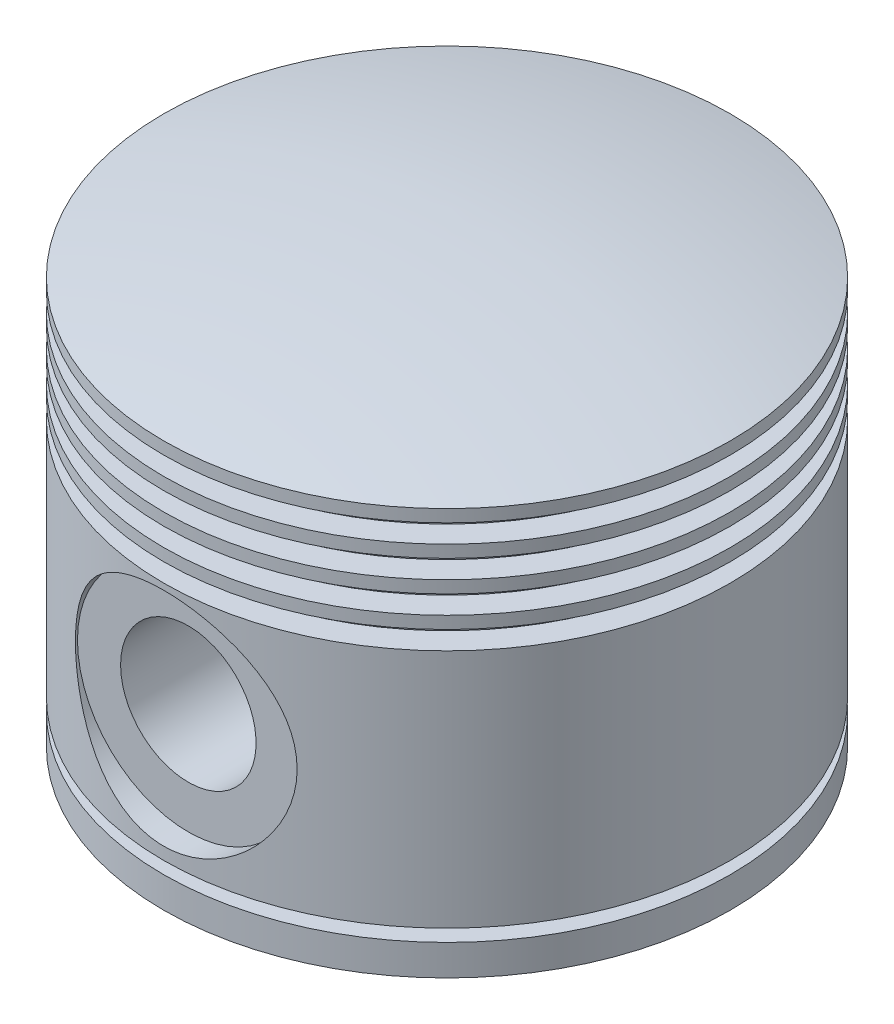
ISO-10303-21;
HEADER;
FILE_DESCRIPTION(('STEP AP214'),'2;1');
FILE_NAME('part.step','',(''),(''),'','','');
FILE_SCHEMA(('AUTOMOTIVE_DESIGN { 1 0 10303 214 1 1 1 1 }'));
ENDSEC;
DATA;
#1=APPLICATION_CONTEXT('core data for automotive mechanical design processes');
#2=APPLICATION_PROTOCOL_DEFINITION('international standard','automotive_design',2000,#1);
#3=PRODUCT_CONTEXT('',#1,'mechanical');
#4=PRODUCT('Part','Part','',(#3));
#5=PRODUCT_RELATED_PRODUCT_CATEGORY('part','',(#4));
#6=PRODUCT_DEFINITION_FORMATION('','',#4);
#7=PRODUCT_DEFINITION_CONTEXT('part definition',#1,'design');
#8=PRODUCT_DEFINITION('design','',#6,#7);
#9=PRODUCT_DEFINITION_SHAPE('','',#8);
#10=(LENGTH_UNIT() NAMED_UNIT(*) SI_UNIT(.MILLI.,.METRE.));
#11=(NAMED_UNIT(*) PLANE_ANGLE_UNIT() SI_UNIT($,.RADIAN.));
#12=(NAMED_UNIT(*) SI_UNIT($,.STERADIAN.) SOLID_ANGLE_UNIT());
#13=UNCERTAINTY_MEASURE_WITH_UNIT(LENGTH_MEASURE(1.E-05),#10,'distance_accuracy_value','');
#14=(GEOMETRIC_REPRESENTATION_CONTEXT(3) GLOBAL_UNCERTAINTY_ASSIGNED_CONTEXT((#13)) GLOBAL_UNIT_ASSIGNED_CONTEXT((#10,
#11,#12)) REPRESENTATION_CONTEXT('',''));
#15=CARTESIAN_POINT('',(0.,0.,0.));
#16=DIRECTION('',(0.,0.,1.));
#17=DIRECTION('',(1.,0.,0.));
#18=AXIS2_PLACEMENT_3D('',#15,#16,#17);
#19=CARTESIAN_POINT('',(0.,0.,0.));
#20=DIRECTION('',(0.,-1.,0.));
#21=DIRECTION('',(0.,0.,-1.));
#22=AXIS2_PLACEMENT_3D('',#19,#20,#21);
#23=CYLINDRICAL_SURFACE('',#22,46.);
#24=CARTESIAN_POINT('',(0.,45.,-46.));
#25=CARTESIAN_POINT('',(-0.485846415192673,45.0000033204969,-46.00000249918));
#26=CARTESIAN_POINT('',(-0.971649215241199,44.9803149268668,-45.9922867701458));
#27=CARTESIAN_POINT('',(-1.93955551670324,44.9017820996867,-45.9616412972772));
#28=CARTESIAN_POINT('',(-2.42165944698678,44.8429422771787,-45.9387133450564));
#29=CARTESIAN_POINT('',(-3.3785223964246,44.6867339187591,-45.878267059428));
#30=CARTESIAN_POINT('',(-3.85328310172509,44.5893743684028,-45.8407521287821));
#31=CARTESIAN_POINT('',(-4.79222951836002,44.3570862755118,-45.7521248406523));
#32=CARTESIAN_POINT('',(-5.25641486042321,44.2221564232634,-45.7010120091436));
#33=CARTESIAN_POINT('',(-6.1701129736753,43.9163037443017,-45.5866348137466));
#34=CARTESIAN_POINT('',(-6.6196544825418,43.74545701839,-45.523396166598));
#35=CARTESIAN_POINT('',(-7.50226260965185,43.3690633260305,-45.3862923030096));
#36=CARTESIAN_POINT('',(-7.93532938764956,43.16351669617,-45.3124271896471));
#37=CARTESIAN_POINT('',(-8.78255575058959,42.7192735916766,-45.1558673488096));
#38=CARTESIAN_POINT('',(-9.19671103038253,42.4805696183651,-45.0731706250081));
#39=CARTESIAN_POINT('',(-10.0037428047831,41.971730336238,-44.9009510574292));
#40=CARTESIAN_POINT('',(-10.3966185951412,41.7015939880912,-44.8114279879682));
#41=CARTESIAN_POINT('',(-11.1746280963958,41.1199551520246,-44.6239205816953));
#42=CARTESIAN_POINT('',(-11.5587877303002,40.8072125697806,-44.5257399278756));
#43=CARTESIAN_POINT('',(-12.2998429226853,40.1513805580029,-44.326754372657));
#44=CARTESIAN_POINT('',(-12.6567259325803,39.8082773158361,-44.2259482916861));
#45=CARTESIAN_POINT('',(-13.3411572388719,39.0937320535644,-44.0243212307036));
#46=CARTESIAN_POINT('',(-13.6686956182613,38.7222805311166,-43.9235002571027));
#47=CARTESIAN_POINT('',(-14.2922407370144,37.9533900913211,-43.7245803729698));
#48=CARTESIAN_POINT('',(-14.5882611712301,37.5559625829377,-43.626480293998));
#49=CARTESIAN_POINT('',(-15.1589645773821,36.7197125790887,-43.4315619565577));
#50=CARTESIAN_POINT('',(-15.43220297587,36.2798481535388,-43.3349759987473));
#51=CARTESIAN_POINT('',(-15.9404591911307,35.3767672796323,-43.1506070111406));
#52=CARTESIAN_POINT('',(-16.1754756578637,34.9135500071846,-43.0628242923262));
#53=CARTESIAN_POINT('',(-16.6051710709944,33.9669472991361,-42.8989648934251));
#54=CARTESIAN_POINT('',(-16.7998638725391,33.4835688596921,-42.8228841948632));
#55=CARTESIAN_POINT('',(-17.1470947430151,32.4999198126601,-42.6850335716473));
#56=CARTESIAN_POINT('',(-17.2996355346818,31.9996502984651,-42.6232627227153));
#57=CARTESIAN_POINT('',(-17.5551727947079,31.0082829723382,-42.5186328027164));
#58=CARTESIAN_POINT('',(-17.6600479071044,30.5177443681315,-42.4750634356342));
#59=CARTESIAN_POINT('',(-17.8285921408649,29.5284467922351,-42.4045950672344));
#60=CARTESIAN_POINT('',(-17.8922624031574,29.0296880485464,-42.3776956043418));
#61=CARTESIAN_POINT('',(-17.9776361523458,28.0281506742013,-42.3415488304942));
#62=CARTESIAN_POINT('',(-17.9993562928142,27.5253737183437,-42.3322945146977));
#63=CARTESIAN_POINT('',(-18.0006154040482,26.519768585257,-42.3317594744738));
#64=CARTESIAN_POINT('',(-17.9801562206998,26.0169404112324,-42.3404779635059));
#65=CARTESIAN_POINT('',(-17.9000590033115,25.0485656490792,-42.3743977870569));
#66=CARTESIAN_POINT('',(-17.8431039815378,24.5827544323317,-42.3984698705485));
#67=CARTESIAN_POINT('',(-17.6932279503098,23.6579823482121,-42.4612326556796));
#68=CARTESIAN_POINT('',(-17.600308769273,23.1990211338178,-42.499922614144));
#69=CARTESIAN_POINT('',(-17.3793890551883,22.2909412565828,-42.5907392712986));
#70=CARTESIAN_POINT('',(-17.2513844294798,21.8418237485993,-42.6428675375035));
#71=CARTESIAN_POINT('',(-16.9614379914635,20.9562665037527,-42.7590222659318));
#72=CARTESIAN_POINT('',(-16.7994949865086,20.5198272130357,-42.823049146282));
#73=CARTESIAN_POINT('',(-16.4394412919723,19.6536330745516,-42.9625739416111));
#74=CARTESIAN_POINT('',(-16.2406761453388,19.2241831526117,-43.0382744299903));
#75=CARTESIAN_POINT('',(-15.810713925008,18.3834895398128,-43.1980775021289));
#76=CARTESIAN_POINT('',(-15.579516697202,17.9722459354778,-43.2821801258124));
#77=CARTESIAN_POINT('',(-15.0862250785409,17.1700691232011,-43.4565786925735));
#78=CARTESIAN_POINT('',(-14.8241279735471,16.7791377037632,-43.5468751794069));
#79=CARTESIAN_POINT('',(-14.270519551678,16.0194122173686,-43.7314238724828));
#80=CARTESIAN_POINT('',(-13.9789946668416,15.6506284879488,-43.8256778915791));
#81=CARTESIAN_POINT('',(-13.3456924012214,14.9108844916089,-44.0228396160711));
#82=CARTESIAN_POINT('',(-13.0017943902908,14.5417704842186,-44.125872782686));
#83=CARTESIAN_POINT('',(-12.284255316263,13.8337160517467,-44.3309850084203));
#84=CARTESIAN_POINT('',(-11.9106261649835,13.4947636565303,-44.4330644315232));
#85=CARTESIAN_POINT('',(-11.1354918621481,12.8488366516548,-44.6336321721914));
#86=CARTESIAN_POINT('',(-10.7339752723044,12.5418752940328,-44.7321189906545));
#87=CARTESIAN_POINT('',(-9.90553620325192,11.9621831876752,-44.9228338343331));
#88=CARTESIAN_POINT('',(-9.47861386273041,11.6894522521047,-45.0150618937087));
#89=CARTESIAN_POINT('',(-8.59390882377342,11.1756154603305,-45.1923878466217));
#90=CARTESIAN_POINT('',(-8.13570494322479,10.935178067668,-45.2773247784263));
#91=CARTESIAN_POINT('',(-7.19862878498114,10.4940035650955,-45.4357294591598));
#92=CARTESIAN_POINT('',(-6.71975607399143,10.2932672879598,-45.5091969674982));
#93=CARTESIAN_POINT('',(-5.74494928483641,9.93350188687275,-45.6424959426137));
#94=CARTESIAN_POINT('',(-5.24902198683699,9.77445640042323,-45.7023327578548));
#95=CARTESIAN_POINT('',(-4.24373929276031,9.49965292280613,-45.8066148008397));
#96=CARTESIAN_POINT('',(-3.73438478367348,9.38389207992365,-45.8510610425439));
#97=CARTESIAN_POINT('',(-2.73576818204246,9.20229694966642,-45.9211459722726));
#98=CARTESIAN_POINT('',(-2.24702001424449,9.1339888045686,-45.9477138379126));
#99=CARTESIAN_POINT('',(-1.26497317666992,9.03772762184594,-45.9852285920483));
#100=CARTESIAN_POINT('',(-0.771674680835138,9.00977304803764,-45.9961760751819));
#101=CARTESIAN_POINT('',(0.215538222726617,8.99452287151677,-46.002142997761));
#102=CARTESIAN_POINT('',(0.709452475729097,9.00721855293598,-45.9971658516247));
#103=CARTESIAN_POINT('',(1.69415052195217,9.07311145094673,-45.9714303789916));
#104=CARTESIAN_POINT('',(2.1849343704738,9.12630795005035,-45.9506723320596));
#105=CARTESIAN_POINT('',(3.13879162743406,9.26950155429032,-45.8951679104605));
#106=CARTESIAN_POINT('',(3.60215375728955,9.35783123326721,-45.861056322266));
#107=CARTESIAN_POINT('',(4.51941518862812,9.57024099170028,-45.7797649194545));
#108=CARTESIAN_POINT('',(4.97331482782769,9.69431979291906,-45.7325855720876));
#109=CARTESIAN_POINT('',(5.86877685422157,9.97713453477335,-45.626316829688));
#110=CARTESIAN_POINT('',(6.3103382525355,10.1358732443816,-45.5672264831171));
#111=CARTESIAN_POINT('',(7.17842851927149,10.4866916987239,-45.4385599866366));
#112=CARTESIAN_POINT('',(7.60495687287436,10.6787725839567,-45.3689834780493));
#113=CARTESIAN_POINT('',(8.45318261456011,11.1011039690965,-45.2187437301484));
#114=CARTESIAN_POINT('',(8.87434506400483,11.3323320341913,-45.1378091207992));
#115=CARTESIAN_POINT('',(9.69576887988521,11.8269340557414,-44.9685217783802));
#116=CARTESIAN_POINT('',(10.0960299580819,12.0903084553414,-44.8801689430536));
#117=CARTESIAN_POINT('',(10.8735794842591,12.6475063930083,-44.6981514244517));
#118=CARTESIAN_POINT('',(11.250864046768,12.9413350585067,-44.6044858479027));
#119=CARTESIAN_POINT('',(11.9805567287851,13.5577360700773,-44.4140576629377));
#120=CARTESIAN_POINT('',(12.3329558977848,13.88031866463,-44.3172939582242));
#121=CARTESIAN_POINT('',(13.0323130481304,14.5735654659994,-44.1168828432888));
#122=CARTESIAN_POINT('',(13.3775251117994,14.9459791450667,-44.0131862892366));
#123=CARTESIAN_POINT('',(14.0355286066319,15.7189724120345,-43.8077934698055));
#124=CARTESIAN_POINT('',(14.348318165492,16.1195536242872,-43.7060973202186));
#125=CARTESIAN_POINT('',(14.9395290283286,16.9466935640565,-43.5075599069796));
#126=CARTESIAN_POINT('',(15.2179383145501,17.3732612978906,-43.4107203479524));
#127=CARTESIAN_POINT('',(15.738148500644,18.2495602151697,-43.2248421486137));
#128=CARTESIAN_POINT('',(15.9799640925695,18.6992820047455,-43.1358003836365));
#129=CARTESIAN_POINT('',(16.4269189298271,19.6229009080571,-42.9675905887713));
#130=CARTESIAN_POINT('',(16.6317541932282,20.0969605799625,-42.8885058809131));
#131=CARTESIAN_POINT('',(17.0004786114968,21.062754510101,-42.7436896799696));
#132=CARTESIAN_POINT('',(17.1643672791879,21.5544889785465,-42.6779583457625));
#133=CARTESIAN_POINT('',(17.4493974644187,22.551710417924,-42.5622158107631));
#134=CARTESIAN_POINT('',(17.5705638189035,23.0571892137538,-42.5121954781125));
#135=CARTESIAN_POINT('',(17.7688744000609,24.0781107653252,-42.4296911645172));
#136=CARTESIAN_POINT('',(17.84602208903,24.5935527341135,-42.3972058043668));
#137=CARTESIAN_POINT('',(17.9515612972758,25.5940565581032,-42.3526204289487));
#138=CARTESIAN_POINT('',(17.9829622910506,26.0787470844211,-42.3392632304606));
#139=CARTESIAN_POINT('',(18.0064750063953,27.0492420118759,-42.329269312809));
#140=CARTESIAN_POINT('',(17.9985886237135,27.5350463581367,-42.332631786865));
#141=CARTESIAN_POINT('',(17.9436207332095,28.5039697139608,-42.3559600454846));
#142=CARTESIAN_POINT('',(17.8965433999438,28.9870890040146,-42.3759240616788));
#143=CARTESIAN_POINT('',(17.7637197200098,29.947040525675,-42.431773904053));
#144=CARTESIAN_POINT('',(17.6779734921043,30.4238727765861,-42.4676596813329));
#145=CARTESIAN_POINT('',(17.4725203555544,31.3506425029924,-42.5525896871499));
#146=CARTESIAN_POINT('',(17.3541594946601,31.8009278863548,-42.6011088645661));
#147=CARTESIAN_POINT('',(17.0834460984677,32.6896069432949,-42.710386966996));
#148=CARTESIAN_POINT('',(16.9310946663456,33.1280010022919,-42.7711454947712));
#149=CARTESIAN_POINT('',(16.5936503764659,33.9903628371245,-42.9031882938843));
#150=CARTESIAN_POINT('',(16.4085563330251,34.41433008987,-42.9744729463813));
#151=CARTESIAN_POINT('',(16.0069373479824,35.2456753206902,-43.1256767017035));
#152=CARTESIAN_POINT('',(15.7904010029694,35.6530472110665,-43.2055989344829));
#153=CARTESIAN_POINT('',(15.3145367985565,36.4710664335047,-43.3766338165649));
#154=CARTESIAN_POINT('',(15.0535019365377,36.8806428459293,-43.4681212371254));
#155=CARTESIAN_POINT('',(14.4998032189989,37.6766467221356,-43.6559406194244));
#156=CARTESIAN_POINT('',(14.2071383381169,38.0630734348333,-43.7522727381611));
#157=CARTESIAN_POINT('',(13.5918018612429,38.8109057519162,-43.9473220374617));
#158=CARTESIAN_POINT('',(13.2691167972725,39.1722999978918,-44.0460402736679));
#159=CARTESIAN_POINT('',(12.5957662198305,39.8678243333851,-44.2433012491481));
#160=CARTESIAN_POINT('',(12.2451092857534,40.201962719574,-44.3418440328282));
#161=CARTESIAN_POINT('',(11.4952881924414,40.8608236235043,-44.5423168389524));
#162=CARTESIAN_POINT('',(11.0944683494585,41.1837147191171,-44.6440844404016));
#163=CARTESIAN_POINT('',(10.265715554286,41.7945968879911,-44.8419063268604));
#164=CARTESIAN_POINT('',(9.83778195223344,42.0825871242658,-44.9379604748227));
#165=CARTESIAN_POINT('',(8.95731826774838,42.6215527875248,-45.1217097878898));
#166=CARTESIAN_POINT('',(8.50478185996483,42.872518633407,-45.2094027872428));
#167=CARTESIAN_POINT('',(7.57815556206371,43.335230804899,-45.3739241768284));
#168=CARTESIAN_POINT('',(7.10406466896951,43.5469753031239,-45.4507520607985));
#169=CARTESIAN_POINT('',(6.09838250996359,43.9447722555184,-45.5970207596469));
#170=CARTESIAN_POINT('',(5.56524713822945,44.1273453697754,-45.6653561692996));
#171=CARTESIAN_POINT('',(4.4823125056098,44.4420998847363,-45.7843378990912));
#172=CARTESIAN_POINT('',(3.93251177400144,44.5742768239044,-45.8349826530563));
#173=CARTESIAN_POINT('',(2.82178627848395,44.7864281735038,-45.9167446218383));
#174=CARTESIAN_POINT('',(2.26086752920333,44.8664300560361,-45.9478721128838));
#175=CARTESIAN_POINT('',(1.13327876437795,44.9732096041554,-45.9894966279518));
#176=CARTESIAN_POINT('',(0.566609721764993,44.9999961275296,-45.9999970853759));
#177=CARTESIAN_POINT('',(0.,45.,-46.));
#178=B_SPLINE_CURVE_WITH_KNOTS('',3,(#24,#25,#26,#27,#28,#29,#30,#31,#32,#33,#34,#35,#36,#37,
#38,#39,#40,#41,#42,#43,#44,#45,#46,#47,#48,#49,#50,#51,#52,#53,#54,#55,#56,#57,#58,#59,#60,#61,
#62,#63,#64,#65,#66,#67,#68,#69,#70,#71,#72,#73,#74,#75,#76,#77,#78,#79,#80,#81,#82,#83,#84,#85,
#86,#87,#88,#89,#90,#91,#92,#93,#94,#95,#96,#97,#98,#99,#100,#101,#102,#103,#104,#105,#106,#107,
#108,#109,#110,#111,#112,#113,#114,#115,#116,#117,#118,#119,#120,#121,#122,#123,#124,#125,#126,
#127,#128,#129,#130,#131,#132,#133,#134,#135,#136,#137,#138,#139,#140,#141,#142,#143,#144,#145,
#146,#147,#148,#149,#150,#151,#152,#153,#154,#155,#156,#157,#158,#159,#160,#161,#162,#163,#164,
#165,#166,#167,#168,#169,#170,#171,#172,#173,#174,#175,#176,#177),.UNSPECIFIED.,.T.,.F.,(4,2,2,
2,2,2,2,2,2,2,2,2,2,2,2,2,2,2,2,2,2,2,2,2,2,2,2,2,2,2,2,2,2,2,2,2,2,2,2,2,2,2,2,2,2,2,2,2,2,2,2,
2,2,2,2,2,2,2,2,2,2,2,2,2,2,2,2,2,2,2,2,2,2,2,2,2,4),(0.,1.45700633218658,2.9138410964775,
4.37033622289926,5.82688212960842,7.28037245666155,8.73384868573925,10.1876541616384,
11.6415077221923,13.1548318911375,14.6688481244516,16.1833741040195,17.6972392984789,
19.2755428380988,20.8539021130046,22.4317181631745,24.0094322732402,25.517988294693,
27.0265025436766,28.5344178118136,30.0422670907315,31.4503071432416,32.8582756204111,
34.2664084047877,35.6745906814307,37.1107413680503,38.5468988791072,39.9831826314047,
41.4201316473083,42.963081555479,44.5054163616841,46.0483875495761,47.5913503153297,
49.1624895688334,50.7336617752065,52.3042164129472,53.8746675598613,55.3554254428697,
56.8361269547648,58.3165110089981,59.7968688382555,61.2140494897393,62.6311794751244,
64.0484227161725,65.4657144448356,66.925809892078,68.3859254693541,69.8462872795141,
71.307171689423,72.860222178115,74.4133623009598,75.9670438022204,77.5200998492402,
79.085392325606,80.650703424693,82.2151030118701,83.7793795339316,85.2352034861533,
86.6909571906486,88.1465558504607,89.6021500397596,91.0048957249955,92.4075958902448,
93.8103468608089,95.2136078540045,96.6946795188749,98.1757992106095,99.6575866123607,
101.138921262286,102.711021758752,104.283159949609,105.855704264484,107.428321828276,
109.128557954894,110.828944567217,112.528435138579,114.22764280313),.UNSPECIFIED.);
#179=CARTESIAN_POINT('',(0.,45.,-46.));
#180=VERTEX_POINT('',#179);
#181=EDGE_CURVE('E43',#180,#180,#178,.T.);
#182=ORIENTED_EDGE('',*,*,#181,.T.);
#183=EDGE_LOOP('',(#182));
#184=FACE_BOUND('',#183,.T.);
#185=CARTESIAN_POINT('',(0.,46.,0.));
#186=DIRECTION('',(0.,-1.,0.));
#187=DIRECTION('',(0.,0.,-1.));
#188=AXIS2_PLACEMENT_3D('',#185,#186,#187);
#189=CIRCLE('',#188,46.);
#190=CARTESIAN_POINT('',(0.,46.,-46.));
#191=VERTEX_POINT('',#190);
#192=EDGE_CURVE('E191',#191,#191,#189,.T.);
#193=ORIENTED_EDGE('',*,*,#192,.T.);
#194=EDGE_LOOP('',(#193));
#195=FACE_BOUND('',#194,.T.);
#196=CARTESIAN_POINT('',(0.,7.00000000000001,0.));
#197=DIRECTION('',(0.,-1.,0.));
#198=DIRECTION('',(0.,0.,-1.));
#199=AXIS2_PLACEMENT_3D('',#196,#197,#198);
#200=CIRCLE('',#199,46.);
#201=CARTESIAN_POINT('',(0.,7.00000000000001,-46.));
#202=VERTEX_POINT('',#201);
#203=EDGE_CURVE('E194',#202,#202,#200,.T.);
#204=ORIENTED_EDGE('',*,*,#203,.F.);
#205=EDGE_LOOP('',(#204));
#206=FACE_BOUND('',#205,.T.);
#207=CARTESIAN_POINT('',(-18.,27.,42.3320209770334));
#208=CARTESIAN_POINT('',(-17.999996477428,27.4832729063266,42.3320244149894));
#209=CARTESIAN_POINT('',(-17.9805105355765,27.9667069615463,42.340324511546));
#210=CARTESIAN_POINT('',(-17.9027518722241,28.9300980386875,42.3732604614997));
#211=CARTESIAN_POINT('',(-17.8444546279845,29.4100526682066,42.3979066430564));
#212=CARTESIAN_POINT('',(-17.6895052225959,30.3638280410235,42.4627891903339));
#213=CARTESIAN_POINT('',(-17.5927635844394,30.8376317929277,42.5030619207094));
#214=CARTESIAN_POINT('',(-17.3619401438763,31.774492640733,42.5978704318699));
#215=CARTESIAN_POINT('',(-17.2278639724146,32.2375513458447,42.6524040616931));
#216=CARTESIAN_POINT('',(-16.9241935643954,33.1482718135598,42.7738036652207));
#217=CARTESIAN_POINT('',(-16.7547311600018,33.5959837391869,42.840623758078));
#218=CARTESIAN_POINT('',(-16.3814280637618,34.4750841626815,42.9847509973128));
#219=CARTESIAN_POINT('',(-16.1775861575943,34.9064720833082,43.0620585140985));
#220=CARTESIAN_POINT('',(-15.7371873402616,35.7502752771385,43.2249464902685));
#221=CARTESIAN_POINT('',(-15.5006470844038,36.162700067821,43.3105227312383));
#222=CARTESIAN_POINT('',(-14.9962863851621,36.9667810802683,43.4877321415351));
#223=CARTESIAN_POINT('',(-14.7284546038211,37.3584296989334,43.5793675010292));
#224=CARTESIAN_POINT('',(-14.149225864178,38.1376191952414,43.7709604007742));
#225=CARTESIAN_POINT('',(-13.8363300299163,38.5240004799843,43.8711054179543));
#226=CARTESIAN_POINT('',(-13.1798644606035,39.2693858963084,44.0727700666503));
#227=CARTESIAN_POINT('',(-12.8362936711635,39.6283890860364,44.1742897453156));
#228=CARTESIAN_POINT('',(-12.1202741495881,40.3171254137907,44.3760898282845));
#229=CARTESIAN_POINT('',(-11.7478108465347,40.6468436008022,44.4763695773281));
#230=CARTESIAN_POINT('',(-10.9763838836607,41.2746709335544,44.6730049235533));
#231=CARTESIAN_POINT('',(-10.5774294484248,41.5727909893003,44.7693618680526));
#232=CARTESIAN_POINT('',(-9.739611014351,42.1461965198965,44.9592183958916));
#233=CARTESIAN_POINT('',(-9.29980892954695,42.4201949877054,45.0524727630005));
#234=CARTESIAN_POINT('',(-8.39672532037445,42.9299673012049,45.2294893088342));
#235=CARTESIAN_POINT('',(-7.93344303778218,43.1657399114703,45.3132511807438));
#236=CARTESIAN_POINT('',(-6.98667453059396,43.5968926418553,45.4688510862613));
#237=CARTESIAN_POINT('',(-6.50319451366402,43.7922850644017,45.5406927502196));
#238=CARTESIAN_POINT('',(-5.51942191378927,44.1408358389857,45.6703630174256));
#239=CARTESIAN_POINT('',(-5.01913035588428,44.293996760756,45.7281924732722));
#240=CARTESIAN_POINT('',(-4.0292280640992,44.5503399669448,45.8257684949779));
#241=CARTESIAN_POINT('',(-3.54020404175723,44.6555166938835,45.8662314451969));
#242=CARTESIAN_POINT('',(-2.55408422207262,44.8248955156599,45.9316969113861));
#243=CARTESIAN_POINT('',(-2.0569886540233,44.8890987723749,45.9566998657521));
#244=CARTESIAN_POINT('',(-1.05877708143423,44.9758144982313,45.9905241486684));
#245=CARTESIAN_POINT('',(-0.557662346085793,44.99833964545,45.999350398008));
#246=CARTESIAN_POINT('',(0.444710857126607,45.0014831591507,46.0005802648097));
#247=CARTESIAN_POINT('',(0.945969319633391,44.9821029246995,45.9929844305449));
#248=CARTESIAN_POINT('',(1.91768170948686,44.9038306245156,45.9624407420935));
#249=CARTESIAN_POINT('',(2.38834032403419,44.8471235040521,45.9403420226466));
#250=CARTESIAN_POINT('',(3.32286304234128,44.6969639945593,45.8822159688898));
#251=CARTESIAN_POINT('',(3.78672743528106,44.6035131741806,45.8461892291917));
#252=CARTESIAN_POINT('',(4.70454524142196,44.3807445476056,45.7611155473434));
#253=CARTESIAN_POINT('',(5.15849829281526,44.2514254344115,45.7120681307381));
#254=CARTESIAN_POINT('',(6.05357074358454,43.9580689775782,45.6021668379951));
#255=CARTESIAN_POINT('',(6.4946897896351,43.7940306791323,45.5413126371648));
#256=CARTESIAN_POINT('',(7.36787240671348,43.4298977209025,45.4082855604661));
#257=CARTESIAN_POINT('',(7.79970366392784,43.2293030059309,45.3359577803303));
#258=CARTESIAN_POINT('',(8.64488357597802,42.7953055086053,45.1824135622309));
#259=CARTESIAN_POINT('',(9.05823217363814,42.5619026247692,45.101197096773));
#260=CARTESIAN_POINT('',(9.86424037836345,42.0639040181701,44.9317970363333));
#261=CARTESIAN_POINT('',(10.2568977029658,41.7993048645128,44.8436126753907));
#262=CARTESIAN_POINT('',(11.0195678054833,41.2405301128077,44.6623201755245));
#263=CARTESIAN_POINT('',(11.3895723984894,40.9463439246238,44.5692102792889));
#264=CARTESIAN_POINT('',(12.1274762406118,40.3107525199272,44.3743053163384));
#265=CARTESIAN_POINT('',(12.4937735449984,39.9675399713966,44.2723326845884));
#266=CARTESIAN_POINT('',(13.1964079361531,39.2517894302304,44.0680011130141));
#267=CARTESIAN_POINT('',(13.5327434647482,38.8792499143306,43.9656421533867));
#268=CARTESIAN_POINT('',(14.1735866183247,38.1068170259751,43.7632543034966));
#269=CARTESIAN_POINT('',(14.478078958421,37.7069106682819,43.663226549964));
#270=CARTESIAN_POINT('',(15.0529781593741,36.8823259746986,43.4683788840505));
#271=CARTESIAN_POINT('',(15.3233975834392,36.457656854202,43.3735570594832));
#272=CARTESIAN_POINT('',(15.8350046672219,35.5743741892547,43.1894490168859));
#273=CARTESIAN_POINT('',(16.0752358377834,35.1151614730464,43.1003741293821));
#274=CARTESIAN_POINT('',(16.5158691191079,34.1760084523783,42.9334557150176));
#275=CARTESIAN_POINT('',(16.7162702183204,33.6960676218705,42.8556124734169));
#276=CARTESIAN_POINT('',(17.0752232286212,32.7190429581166,42.7138620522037));
#277=CARTESIAN_POINT('',(17.2337962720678,32.2219679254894,42.6499478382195));
#278=CARTESIAN_POINT('',(17.5075084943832,31.2142253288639,42.5383244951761));
#279=CARTESIAN_POINT('',(17.6226509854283,30.7035588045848,42.4906141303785));
#280=CARTESIAN_POINT('',(17.802671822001,29.7032701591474,42.4154901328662));
#281=CARTESIAN_POINT('',(17.8701173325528,29.2141866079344,42.387044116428));
#282=CARTESIAN_POINT('',(17.9646090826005,28.2314458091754,42.3470834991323));
#283=CARTESIAN_POINT('',(17.9916569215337,27.737788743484,42.3355682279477));
#284=CARTESIAN_POINT('',(18.00503893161,26.7499485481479,42.3298786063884));
#285=CARTESIAN_POINT('',(17.9913831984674,26.2557655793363,42.3356999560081));
#286=CARTESIAN_POINT('',(17.9235390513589,25.2707025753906,42.3644674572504));
#287=CARTESIAN_POINT('',(17.8693515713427,24.7798224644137,42.387413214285));
#288=CARTESIAN_POINT('',(17.7250468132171,23.8313467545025,42.447949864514));
#289=CARTESIAN_POINT('',(17.6370116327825,23.3733776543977,42.4846896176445));
#290=CARTESIAN_POINT('',(17.4260552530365,22.4668833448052,42.5716525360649));
#291=CARTESIAN_POINT('',(17.3031355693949,22.0183577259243,42.6218751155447));
#292=CARTESIAN_POINT('',(17.0234868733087,21.1334630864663,42.734337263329));
#293=CARTESIAN_POINT('',(16.866752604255,20.6970959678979,42.7965786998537));
#294=CARTESIAN_POINT('',(16.5207574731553,19.8390943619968,42.931329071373));
#295=CARTESIAN_POINT('',(16.3314952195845,19.4174605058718,43.0038384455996));
#296=CARTESIAN_POINT('',(15.9137321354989,18.5748649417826,43.1602224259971));
#297=CARTESIAN_POINT('',(15.6839766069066,18.1545877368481,43.2444328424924));
#298=CARTESIAN_POINT('',(15.1924362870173,17.3346822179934,43.4195569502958));
#299=CARTESIAN_POINT('',(14.9306509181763,16.9350542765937,43.510470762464));
#300=CARTESIAN_POINT('',(14.3766129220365,16.1583848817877,43.6966636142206));
#301=CARTESIAN_POINT('',(14.0843501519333,15.7813510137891,43.7919441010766));
#302=CARTESIAN_POINT('',(13.4711090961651,15.0519343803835,43.9844574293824));
#303=CARTESIAN_POINT('',(13.150129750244,14.6995525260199,44.0816903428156));
#304=CARTESIAN_POINT('',(12.4576000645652,13.997378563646,44.2825828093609));
#305=CARTESIAN_POINT('',(12.0840801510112,13.6495171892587,44.3862126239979));
#306=CARTESIAN_POINT('',(11.3084933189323,12.9865008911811,44.5901185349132));
#307=CARTESIAN_POINT('',(10.9064384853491,12.6713322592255,44.6903960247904));
#308=CARTESIAN_POINT('',(10.0758868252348,12.075599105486,44.8849467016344));
#309=CARTESIAN_POINT('',(9.64738226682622,11.7950447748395,44.9792181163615));
#310=CARTESIAN_POINT('',(8.76666525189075,11.270785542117,45.159135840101));
#311=CARTESIAN_POINT('',(8.31445333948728,11.0270797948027,45.2447823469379));
#312=CARTESIAN_POINT('',(7.38989143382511,10.5788843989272,45.4049476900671));
#313=CARTESIAN_POINT('',(6.91757080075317,10.3743398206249,45.4794820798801));
#314=CARTESIAN_POINT('',(5.95546158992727,10.0059481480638,45.6154411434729));
#315=CARTESIAN_POINT('',(5.46567288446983,9.84210135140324,45.6768657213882));
#316=CARTESIAN_POINT('',(4.47249476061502,9.55684629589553,45.7847810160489));
#317=CARTESIAN_POINT('',(3.96911122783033,9.43541997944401,45.8312780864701));
#318=CARTESIAN_POINT('',(2.95255946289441,9.23625604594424,45.9079745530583));
#319=CARTESIAN_POINT('',(2.43939185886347,9.15851563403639,45.9381749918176));
#320=CARTESIAN_POINT('',(1.44000400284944,9.05110372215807,45.9800023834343));
#321=CARTESIAN_POINT('',(0.954117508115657,9.01871784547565,45.9926775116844));
#322=CARTESIAN_POINT('',(-0.0188286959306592,8.99343372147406,46.0025682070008));
#323=CARTESIAN_POINT('',(-0.505888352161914,9.00053371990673,45.9997844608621));
#324=CARTESIAN_POINT('',(-1.47743034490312,9.05414047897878,45.9788350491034));
#325=CARTESIAN_POINT('',(-1.96191300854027,9.10064211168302,45.9606713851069));
#326=CARTESIAN_POINT('',(-2.92474769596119,9.23255894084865,45.9094573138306));
#327=CARTESIAN_POINT('',(-3.40309973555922,9.31797403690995,45.8764069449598));
#328=CARTESIAN_POINT('',(-4.3367079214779,9.5238751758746,45.7974473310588));
#329=CARTESIAN_POINT('',(-4.79223380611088,9.64329276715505,45.7519312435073));
#330=CARTESIAN_POINT('',(-5.69126987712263,9.91696056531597,45.6488135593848));
#331=CARTESIAN_POINT('',(-6.13478037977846,10.0712098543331,45.591212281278));
#332=CARTESIAN_POINT('',(-7.00714336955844,10.4132737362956,45.4653077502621));
#333=CARTESIAN_POINT('',(-7.43599395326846,10.6010926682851,45.3970031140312));
#334=CARTESIAN_POINT('',(-8.27653922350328,11.0088424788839,45.2513079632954));
#335=CARTESIAN_POINT('',(-8.68823325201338,11.2287745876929,45.1739171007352));
#336=CARTESIAN_POINT('',(-9.50975613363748,11.709454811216,45.0083067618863));
#337=CARTESIAN_POINT('',(-9.91872405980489,11.9715626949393,44.919762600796));
#338=CARTESIAN_POINT('',(-10.7133061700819,12.5272622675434,44.7369121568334));
#339=CARTESIAN_POINT('',(-11.098919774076,12.8208547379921,44.6426057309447));
#340=CARTESIAN_POINT('',(-11.8447775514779,13.4377186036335,44.4505295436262));
#341=CARTESIAN_POINT('',(-12.205018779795,13.7609934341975,44.3527593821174));
#342=CARTESIAN_POINT('',(-12.8983279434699,14.4354799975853,44.1561214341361));
#343=CARTESIAN_POINT('',(-13.2313830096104,14.7867048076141,44.0572531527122));
#344=CARTESIAN_POINT('',(-13.8870448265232,15.5364778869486,43.855153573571));
#345=CARTESIAN_POINT('',(-14.2078874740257,15.9365942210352,43.7520073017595));
#346=CARTESIAN_POINT('',(-14.8146218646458,16.7633130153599,43.550306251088));
#347=CARTESIAN_POINT('',(-15.1005290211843,17.1899036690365,43.45174945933));
#348=CARTESIAN_POINT('',(-15.6356317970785,18.0674066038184,43.2620811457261));
#349=CARTESIAN_POINT('',(-15.8848095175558,18.5183305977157,43.1709732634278));
#350=CARTESIAN_POINT('',(-16.344236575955,19.4414515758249,42.9991409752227));
#351=CARTESIAN_POINT('',(-16.554491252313,19.913645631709,42.9184151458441));
#352=CARTESIAN_POINT('',(-16.917578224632,20.834086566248,42.7765140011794));
#353=CARTESIAN_POINT('',(-17.0738224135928,21.2808215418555,42.7142468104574));
#354=CARTESIAN_POINT('',(-17.3509938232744,22.1867510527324,42.6024105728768));
#355=CARTESIAN_POINT('',(-17.4719177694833,22.6459467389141,42.5528427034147));
#356=CARTESIAN_POINT('',(-17.6770215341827,23.5725323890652,42.4680492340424));
#357=CARTESIAN_POINT('',(-17.7612937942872,24.0398986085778,42.4327875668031));
#358=CARTESIAN_POINT('',(-17.8926521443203,24.9805291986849,42.3775663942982));
#359=CARTESIAN_POINT('',(-17.9397605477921,25.453789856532,42.3575977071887));
#360=CARTESIAN_POINT('',(-17.9787051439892,26.1066130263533,42.3410703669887));
#361=CARTESIAN_POINT('',(-17.9866883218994,26.2851674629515,42.3376791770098));
#362=CARTESIAN_POINT('',(-17.9973365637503,26.6424739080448,42.3331537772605));
#363=CARTESIAN_POINT('',(-18.0000013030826,26.8212259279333,42.3320197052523));
#364=CARTESIAN_POINT('',(-18.,27.,42.3320209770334));
#365=B_SPLINE_CURVE_WITH_KNOTS('',3,(#207,#208,#209,#210,#211,#212,#213,#214,#215,#216,#217,
#218,#219,#220,#221,#222,#223,#224,#225,#226,#227,#228,#229,#230,#231,#232,#233,#234,#235,#236,
#237,#238,#239,#240,#241,#242,#243,#244,#245,#246,#247,#248,#249,#250,#251,#252,#253,#254,#255,
#256,#257,#258,#259,#260,#261,#262,#263,#264,#265,#266,#267,#268,#269,#270,#271,#272,#273,#274,
#275,#276,#277,#278,#279,#280,#281,#282,#283,#284,#285,#286,#287,#288,#289,#290,#291,#292,#293,
#294,#295,#296,#297,#298,#299,#300,#301,#302,#303,#304,#305,#306,#307,#308,#309,#310,#311,#312,
#313,#314,#315,#316,#317,#318,#319,#320,#321,#322,#323,#324,#325,#326,#327,#328,#329,#330,#331,
#332,#333,#334,#335,#336,#337,#338,#339,#340,#341,#342,#343,#344,#345,#346,#347,#348,#349,#350,
#351,#352,#353,#354,#355,#356,#357,#358,#359,#360,#361,#362,#363,#364),.UNSPECIFIED.,.T.,.F.,(4,
2,2,2,2,2,2,2,2,2,2,2,2,2,2,2,2,2,2,2,2,2,2,2,2,2,2,2,2,2,2,2,2,2,2,2,2,2,2,2,2,2,2,2,2,2,2,2,2,
2,2,2,2,2,2,2,2,2,2,2,2,2,2,2,2,2,2,2,2,2,2,2,2,2,2,2,2,2,4),(0.,1.44963704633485,
2.90019090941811,4.35414080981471,5.80787153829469,7.25628001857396,8.70473966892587,
10.1524642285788,11.6007149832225,13.1205400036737,14.640417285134,16.1610661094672,
17.6811881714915,19.2587002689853,20.836263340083,22.4133450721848,23.9903308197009,
25.4939157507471,26.9974580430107,28.5005428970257,30.0035775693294,31.4256364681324,
32.8476346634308,34.269684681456,35.691773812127,37.1350171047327,38.5782648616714,
40.0216714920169,41.4655966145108,43.000511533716,44.5355062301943,46.0712343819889,
47.6063946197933,49.1819524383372,50.7575502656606,52.3323505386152,53.9070306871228,
55.3887020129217,56.8703146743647,58.3515598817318,59.8327709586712,61.2345684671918,
62.6363050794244,64.038259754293,65.4402744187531,66.8976727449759,68.3550973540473,
69.8130085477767,71.2709735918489,72.8316339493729,74.3916372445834,75.9520987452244,
77.512524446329,79.0707451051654,80.6289771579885,82.1865450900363,83.7440133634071,
85.203581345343,86.6630844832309,88.122397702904,89.5817071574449,90.9994426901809,
92.417140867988,93.8350224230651,95.2529583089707,96.7326031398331,98.2122847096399,
99.6921377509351,101.172687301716,102.740240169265,104.307098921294,105.874718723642,
107.442123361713,108.872592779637,110.303194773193,111.730167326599,113.156282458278,
113.692504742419,114.228759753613),.UNSPECIFIED.);
#366=CARTESIAN_POINT('',(-18.,27.,42.3320209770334));
#367=VERTEX_POINT('',#366);
#368=EDGE_CURVE('E11',#367,#367,#365,.T.);
#369=ORIENTED_EDGE('',*,*,#368,.T.);
#370=EDGE_LOOP('',(#369));
#371=FACE_BOUND('',#370,.T.);
#372=ADVANCED_FACE('F31',(#184,#195,#206,#371),#23,.T.);
#373=CARTESIAN_POINT('',(0.,27.,25.));
#374=DIRECTION('',(0.,0.,-1.));
#375=DIRECTION('',(1.,0.,0.));
#376=AXIS2_PLACEMENT_3D('',#373,#374,#375);
#377=PLANE('',#376);
#378=CARTESIAN_POINT('',(0.,27.,25.));
#379=DIRECTION('',(0.,0.,1.));
#380=DIRECTION('',(1.,0.,0.));
#381=AXIS2_PLACEMENT_3D('',#378,#379,#380);
#382=CIRCLE('',#381,19.);
#383=CARTESIAN_POINT('',(19.,27.,25.));
#384=VERTEX_POINT('',#383);
#385=EDGE_CURVE('E354',#384,#384,#382,.T.);
#386=ORIENTED_EDGE('',*,*,#385,.F.);
#387=EDGE_LOOP('',(#386));
#388=FACE_BOUND('',#387,.T.);
#389=CARTESIAN_POINT('',(0.,27.,25.));
#390=DIRECTION('',(0.,0.,-1.));
#391=DIRECTION('',(-1.,0.,0.));
#392=AXIS2_PLACEMENT_3D('',#389,#390,#391);
#393=CIRCLE('',#392,11.);
#394=CARTESIAN_POINT('',(-11.,27.,25.));
#395=VERTEX_POINT('',#394);
#396=EDGE_CURVE('E361',#395,#395,#393,.T.);
#397=ORIENTED_EDGE('',*,*,#396,.F.);
#398=EDGE_LOOP('',(#397));
#399=FACE_BOUND('',#398,.T.);
#400=ADVANCED_FACE('F332',(#388,#399),#377,.T.);
#401=CARTESIAN_POINT('',(0.,0.,0.));
#402=DIRECTION('',(0.,-1.,0.));
#403=DIRECTION('',(0.,0.,-1.));
#404=AXIS2_PLACEMENT_3D('',#401,#402,#403);
#405=CYLINDRICAL_SURFACE('',#404,37.);
#406=CARTESIAN_POINT('',(0.,62.,0.));
#407=DIRECTION('',(0.,-1.,0.));
#408=DIRECTION('',(0.,0.,-1.));
#409=AXIS2_PLACEMENT_3D('',#406,#407,#408);
#410=CIRCLE('',#409,37.);
#411=CARTESIAN_POINT('',(0.,62.,-37.));
#412=VERTEX_POINT('',#411);
#413=EDGE_CURVE('E140',#412,#412,#410,.T.);
#414=ORIENTED_EDGE('',*,*,#413,.F.);
#415=EDGE_LOOP('',(#414));
#416=FACE_BOUND('',#415,.T.);
#417=CARTESIAN_POINT('',(0.,42.,0.));
#418=DIRECTION('',(0.,-1.,0.));
#419=DIRECTION('',(0.,0.,-1.));
#420=AXIS2_PLACEMENT_3D('',#417,#418,#419);
#421=CIRCLE('',#420,37.);
#422=CARTESIAN_POINT('',(11.6619037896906,42.,-35.1140997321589));
#423=VERTEX_POINT('',#422);
#424=CARTESIAN_POINT('',(11.6619037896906,42.,35.1140997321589));
#425=VERTEX_POINT('',#424);
#426=EDGE_CURVE('E137',#423,#425,#421,.T.);
#427=ORIENTED_EDGE('',*,*,#426,.T.);
#428=CARTESIAN_POINT('',(-19.,27.,31.7490157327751));
#429=CARTESIAN_POINT('',(-18.9999991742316,27.4931421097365,31.7490169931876));
#430=CARTESIAN_POINT('',(-18.9807759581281,27.986301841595,31.7605441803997));
#431=CARTESIAN_POINT('',(-18.9041484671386,28.9687787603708,31.8062120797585));
#432=CARTESIAN_POINT('',(-18.846727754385,29.4580942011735,31.8403625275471));
#433=CARTESIAN_POINT('',(-18.6943672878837,30.4297053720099,31.9300552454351));
#434=CARTESIAN_POINT('',(-18.5993628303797,30.9119875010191,31.9856344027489));
#435=CARTESIAN_POINT('',(-18.3730719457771,31.8652026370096,32.116152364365));
#436=CARTESIAN_POINT('',(-18.2417885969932,32.336136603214,32.1910895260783));
#437=CARTESIAN_POINT('',(-17.945255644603,33.261183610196,32.3573250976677));
#438=CARTESIAN_POINT('',(-17.7802001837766,33.7153760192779,32.4485296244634));
#439=CARTESIAN_POINT('',(-17.4172489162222,34.6073184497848,32.6447847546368));
#440=CARTESIAN_POINT('',(-17.2193525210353,35.0450681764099,32.7498356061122));
#441=CARTESIAN_POINT('',(-16.7923344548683,35.9020598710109,32.9708243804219));
#442=CARTESIAN_POINT('',(-16.5632187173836,36.3213053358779,33.0867602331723));
#443=CARTESIAN_POINT('',(-16.0751559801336,37.1398482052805,33.3266156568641));
#444=CARTESIAN_POINT('',(-15.8161980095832,37.5391381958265,33.4505381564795));
#445=CARTESIAN_POINT('',(-15.2461162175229,38.3499994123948,33.7144327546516));
#446=CARTESIAN_POINT('',(-14.9324132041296,38.7596102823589,33.8548625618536));
#447=CARTESIAN_POINT('',(-14.2731985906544,39.551544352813,34.1380211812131));
#448=CARTESIAN_POINT('',(-13.9276852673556,39.9338660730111,34.2807501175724));
#449=CARTESIAN_POINT('',(-13.2062645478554,40.6696819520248,34.5650832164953));
#450=CARTESIAN_POINT('',(-12.8303368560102,41.0231565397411,34.7066865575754));
#451=CARTESIAN_POINT('',(-12.0501190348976,41.6990111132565,34.9852277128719));
#452=CARTESIAN_POINT('',(-11.6458384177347,42.0214014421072,35.1221670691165));
#453=CARTESIAN_POINT('',(-10.7803360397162,42.6554318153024,35.3978137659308));
#454=CARTESIAN_POINT('',(-10.3171109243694,42.9646021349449,35.5359308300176));
#455=CARTESIAN_POINT('',(-9.36253491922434,43.5424976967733,35.7992746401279));
#456=CARTESIAN_POINT('',(-8.8711823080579,43.8112204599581,35.9245005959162));
#457=CARTESIAN_POINT('',(-7.86369006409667,44.3054037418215,36.1583964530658));
#458=CARTESIAN_POINT('',(-7.34756323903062,44.5308863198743,36.2670747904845));
#459=CARTESIAN_POINT('',(-6.29400570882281,44.9361067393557,36.4646761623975));
#460=CARTESIAN_POINT('',(-5.75657742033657,45.1158497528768,36.5536014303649));
#461=CARTESIAN_POINT('',(-4.70538950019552,45.4156301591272,36.7031314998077));
#462=CARTESIAN_POINT('',(-4.19284113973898,45.5391131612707,36.765350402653));
#463=CARTESIAN_POINT('',(-3.15718689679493,45.7432833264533,36.8687251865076));
#464=CARTESIAN_POINT('',(-2.63408149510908,45.8239724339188,36.9098820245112));
#465=CARTESIAN_POINT('',(-1.58197495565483,45.9414200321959,36.9699181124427));
#466=CARTESIAN_POINT('',(-1.05297716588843,45.9782023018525,36.9888094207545));
#467=CARTESIAN_POINT('',(0.00654990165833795,46.0073869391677,37.0037914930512));
#468=CARTESIAN_POINT('',(0.537079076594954,45.9997922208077,36.9998837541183));
#469=CARTESIAN_POINT('',(1.54640708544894,45.9430784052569,36.9707956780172));
#470=CARTESIAN_POINT('',(2.02548688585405,45.8978324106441,36.9475996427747));
#471=CARTESIAN_POINT('',(2.97760415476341,45.7713735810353,36.8830788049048));
#472=CARTESIAN_POINT('',(3.45064207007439,45.690163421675,36.8417553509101));
#473=CARTESIAN_POINT('',(4.38749208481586,45.4926774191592,36.741963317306));
#474=CARTESIAN_POINT('',(4.85130387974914,45.3764004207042,36.6834941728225));
#475=CARTESIAN_POINT('',(5.76677611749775,45.1099857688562,36.5507626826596));
#476=CARTESIAN_POINT('',(6.21843611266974,44.959846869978,36.4764997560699));
#477=CARTESIAN_POINT('',(7.11282008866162,44.6249482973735,36.3127689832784));
#478=CARTESIAN_POINT('',(7.55534939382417,44.4397607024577,36.2231146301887));
#479=CARTESIAN_POINT('',(8.42291407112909,44.0376971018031,36.031263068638));
#480=CARTESIAN_POINT('',(8.84794947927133,43.8208211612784,35.9290658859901));
#481=CARTESIAN_POINT('',(9.67862934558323,43.3569707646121,35.7142581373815));
#482=CARTESIAN_POINT('',(10.0842692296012,43.1099892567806,35.6016451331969));
#483=CARTESIAN_POINT('',(10.8743599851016,42.5875794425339,35.3683193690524));
#484=CARTESIAN_POINT('',(11.2588090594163,42.3121487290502,35.2476059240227));
#485=CARTESIAN_POINT('',(12.0416886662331,41.7059949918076,34.9883413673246));
#486=CARTESIAN_POINT('',(12.4377803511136,41.3724982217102,34.8492030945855));
#487=CARTESIAN_POINT('',(13.200787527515,40.6750299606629,34.5673931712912));
#488=CARTESIAN_POINT('',(13.5677013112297,40.3110566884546,34.4247213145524));
#489=CARTESIAN_POINT('',(14.2709895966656,39.5541185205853,34.1391707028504));
#490=CARTESIAN_POINT('',(14.607339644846,39.161130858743,33.9962918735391));
#491=CARTESIAN_POINT('',(15.0873327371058,38.5515928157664,33.784656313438));
#492=CARTESIAN_POINT('',(15.2432471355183,38.3450626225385,33.7145556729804));
#493=CARTESIAN_POINT('',(15.5467603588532,37.9254434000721,33.575677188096));
#494=CARTESIAN_POINT('',(15.6943565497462,37.71235232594,33.5068997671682));
#495=CARTESIAN_POINT('',(16.1442333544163,37.0335263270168,33.2938247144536));
#496=CARTESIAN_POINT('',(16.431209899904,36.5564903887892,33.1527404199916));
#497=CARTESIAN_POINT('',(16.9634818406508,35.5762028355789,32.8835720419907));
#498=CARTESIAN_POINT('',(17.2087810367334,35.0729536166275,32.7554867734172));
#499=CARTESIAN_POINT('',(17.543519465,34.3009304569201,32.5766926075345));
#500=CARTESIAN_POINT('',(17.6495460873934,34.0407846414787,32.5193269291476));
#501=CARTESIAN_POINT('',(17.8502465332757,33.5152001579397,32.4095936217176));
#502=CARTESIAN_POINT('',(17.944923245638,33.2497628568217,32.3572247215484));
#503=CARTESIAN_POINT('',(18.2114842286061,32.4461148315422,32.2084375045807));
#504=CARTESIAN_POINT('',(18.3659650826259,31.9004167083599,32.1203030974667));
#505=CARTESIAN_POINT('',(18.6155625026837,30.8385006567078,31.9762394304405));
#506=CARTESIAN_POINT('',(18.7144504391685,30.323435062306,31.9182921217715));
#507=CARTESIAN_POINT('',(18.8694375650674,29.28471637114,31.8269144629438));
#508=CARTESIAN_POINT('',(18.9255392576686,28.761063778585,31.7934826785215));
#509=CARTESIAN_POINT('',(18.9940147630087,27.7102563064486,31.7526220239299));
#510=CARTESIAN_POINT('',(19.0064185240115,27.1831040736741,31.7451753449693));
#511=CARTESIAN_POINT('',(18.9873709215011,26.1298998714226,31.756572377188));
#512=CARTESIAN_POINT('',(18.955922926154,25.6038478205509,31.7754140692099));
#513=CARTESIAN_POINT('',(18.8560239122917,24.6198395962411,31.8347797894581));
#514=CARTESIAN_POINT('',(18.7924059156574,24.1612093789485,31.8724660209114));
#515=CARTESIAN_POINT('',(18.6323203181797,23.2516921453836,31.9663142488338));
#516=CARTESIAN_POINT('',(18.5358558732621,22.8008043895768,32.0224744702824));
#517=CARTESIAN_POINT('',(18.311114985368,21.9093765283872,32.1515135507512));
#518=CARTESIAN_POINT('',(18.1828300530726,21.4688392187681,32.224396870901));
#519=CARTESIAN_POINT('',(17.8957074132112,20.6005642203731,32.3847289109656));
#520=CARTESIAN_POINT('',(17.7368677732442,20.1728273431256,32.4721785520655));
#521=CARTESIAN_POINT('',(17.3820652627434,19.3130081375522,32.6635307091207));
#522=CARTESIAN_POINT('',(17.184741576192,18.8816144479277,32.768000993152));
#523=CARTESIAN_POINT('',(16.7595783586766,18.0367245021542,32.9874789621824));
#524=CARTESIAN_POINT('',(16.5317258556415,17.6232359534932,33.1024911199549));
#525=CARTESIAN_POINT('',(16.0469678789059,16.8158664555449,33.3401812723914));
#526=CARTESIAN_POINT('',(15.7900567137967,16.4219893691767,33.462860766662));
#527=CARTESIAN_POINT('',(15.2485718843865,15.6553389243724,33.7130540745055));
#528=CARTESIAN_POINT('',(14.9639961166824,15.2825671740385,33.8405682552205));
#529=CARTESIAN_POINT('',(14.3283979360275,14.5108301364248,34.1149873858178));
#530=CARTESIAN_POINT('',(13.9735864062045,14.1150846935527,34.2621937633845));
#531=CARTESIAN_POINT('',(13.2318185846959,13.3544434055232,34.5554343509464));
#532=CARTESIAN_POINT('',(12.8448597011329,12.9895500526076,34.7014684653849));
#533=CARTESIAN_POINT('',(12.0404881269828,12.2925206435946,34.9886991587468));
#534=CARTESIAN_POINT('',(11.6230630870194,11.9603980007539,35.1298937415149));
#535=CARTESIAN_POINT('',(10.7599109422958,11.3312566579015,35.4038036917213));
#536=CARTESIAN_POINT('',(10.3141840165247,11.0342377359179,35.5365191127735));
#537=CARTESIAN_POINT('',(9.38189446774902,10.4686117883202,35.7941525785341));
#538=CARTESIAN_POINT('',(8.89447841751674,10.2012302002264,35.9186810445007));
#539=CARTESIAN_POINT('',(7.89488379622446,9.70892796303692,36.1515438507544));
#540=CARTESIAN_POINT('',(7.38270427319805,9.48400894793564,36.259877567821));
#541=CARTESIAN_POINT('',(6.33758350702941,9.07937575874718,36.4570647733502));
#542=CARTESIAN_POINT('',(5.80465818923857,8.89962767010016,36.5459328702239));
#543=CARTESIAN_POINT('',(4.72197395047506,8.5874976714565,36.7015245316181));
#544=CARTESIAN_POINT('',(4.17221716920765,8.45510976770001,36.7682508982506));
#545=CARTESIAN_POINT('',(3.11350729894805,8.24983576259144,36.872233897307));
#546=CARTESIAN_POINT('',(2.60562918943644,8.17249731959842,36.911685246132));
#547=CARTESIAN_POINT('',(1.58409721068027,8.05918007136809,36.9696127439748));
#548=CARTESIAN_POINT('',(1.07044372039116,8.02319856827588,36.9880902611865));
#549=CARTESIAN_POINT('',(0.0417618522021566,7.99308125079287,37.0035511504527));
#550=CARTESIAN_POINT('',(-0.473266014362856,7.9989315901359,37.0005416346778));
#551=CARTESIAN_POINT('',(-1.50056784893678,8.05236645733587,36.9731292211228));
#552=CARTESIAN_POINT('',(-2.01284190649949,8.09994961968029,36.9487270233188));
#553=CARTESIAN_POINT('',(-2.99378167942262,8.2312957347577,36.8817209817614));
#554=CARTESIAN_POINT('',(-3.46293163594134,8.31220717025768,36.8405541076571));
#555=CARTESIAN_POINT('',(-4.39210513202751,8.50851906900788,36.7413621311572));
#556=CARTESIAN_POINT('',(-4.8521292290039,8.62391741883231,36.6833380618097));
#557=CARTESIAN_POINT('',(-5.76024297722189,8.88803582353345,36.5517461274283));
#558=CARTESIAN_POINT('',(-6.20833177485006,9.03675825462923,36.4781771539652));
#559=CARTESIAN_POINT('',(-7.09002672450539,9.3661398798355,36.3171088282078));
#560=CARTESIAN_POINT('',(-7.52363219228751,9.54680058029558,36.2296088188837));
#561=CARTESIAN_POINT('',(-8.39157902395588,9.94658526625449,36.0386855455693));
#562=CARTESIAN_POINT('',(-8.82522249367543,10.1669819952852,35.9347567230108));
#563=CARTESIAN_POINT('',(-9.67228303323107,10.6390081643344,35.7160792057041));
#564=CARTESIAN_POINT('',(-10.0856997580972,10.8906381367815,35.601330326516));
#565=CARTESIAN_POINT('',(-10.8906255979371,11.423501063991,35.3634058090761));
#566=CARTESIAN_POINT('',(-11.2821274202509,11.7047437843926,35.2402273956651));
#567=CARTESIAN_POINT('',(-12.0415217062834,12.2951330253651,34.9880246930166));
#568=CARTESIAN_POINT('',(-12.4094119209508,12.6042821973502,34.8589998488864));
#569=CARTESIAN_POINT('',(-13.1571673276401,13.2825088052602,34.584153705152));
#570=CARTESIAN_POINT('',(-13.5342890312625,13.6544743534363,34.4379826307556));
#571=CARTESIAN_POINT('',(-14.2561814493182,14.4285476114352,34.1454683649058));
#572=CARTESIAN_POINT('',(-14.6009497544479,14.8306575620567,33.9991251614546));
#573=CARTESIAN_POINT('',(-15.2566418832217,15.6635086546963,33.7099895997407));
#574=CARTESIAN_POINT('',(-15.5675313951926,16.0942781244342,33.5672009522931));
#575=CARTESIAN_POINT('',(-16.1531401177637,16.9820749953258,33.2893544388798));
#576=CARTESIAN_POINT('',(-16.427861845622,17.4391005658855,33.1542960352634));
#577=CARTESIAN_POINT('',(-16.9494501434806,18.3962220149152,32.8908035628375));
#578=CARTESIAN_POINT('',(-17.1947453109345,18.8973117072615,32.7628567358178));
#579=CARTESIAN_POINT('',(-17.641596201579,19.9227900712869,32.5244261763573));
#580=CARTESIAN_POINT('',(-17.8431445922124,20.4471826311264,32.4139453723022));
#581=CARTESIAN_POINT('',(-18.1994352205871,21.514028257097,32.2152464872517));
#582=CARTESIAN_POINT('',(-18.3543121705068,22.0564242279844,32.1269644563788));
#583=CARTESIAN_POINT('',(-18.615651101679,23.1559813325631,31.9762477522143));
#584=CARTESIAN_POINT('',(-18.7221462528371,23.7131320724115,31.9137953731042));
#585=CARTESIAN_POINT('',(-18.8687947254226,24.7250428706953,31.8272555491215));
#586=CARTESIAN_POINT('',(-18.9179396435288,25.1780805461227,31.7980027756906));
#587=CARTESIAN_POINT('',(-18.9835437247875,26.0874069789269,31.7588816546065));
#588=CARTESIAN_POINT('',(-19.000000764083,26.5436959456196,31.7490145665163));
#589=CARTESIAN_POINT('',(-19.,27.,31.7490157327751));
#590=B_SPLINE_CURVE_WITH_KNOTS('',3,(#428,#429,#430,#431,#432,#433,#434,#435,#436,#437,#438,
#439,#440,#441,#442,#443,#444,#445,#446,#447,#448,#449,#450,#451,#452,#453,#454,#455,#456,#457,
#458,#459,#460,#461,#462,#463,#464,#465,#466,#467,#468,#469,#470,#471,#472,#473,#474,#475,#476,
#477,#478,#479,#480,#481,#482,#483,#484,#485,#486,#487,#488,#489,#490,#491,#492,#493,#494,#495,
#496,#497,#498,#499,#500,#501,#502,#503,#504,#505,#506,#507,#508,#509,#510,#511,#512,#513,#514,
#515,#516,#517,#518,#519,#520,#521,#522,#523,#524,#525,#526,#527,#528,#529,#530,#531,#532,#533,
#534,#535,#536,#537,#538,#539,#540,#541,#542,#543,#544,#545,#546,#547,#548,#549,#550,#551,#552,
#553,#554,#555,#556,#557,#558,#559,#560,#561,#562,#563,#564,#565,#566,#567,#568,#569,#570,#571,
#572,#573,#574,#575,#576,#577,#578,#579,#580,#581,#582,#583,#584,#585,#586,#587,#588,#589),
.UNSPECIFIED.,.T.,.F.,(4,2,2,2,2,2,2,2,2,2,2,2,2,2,2,2,2,2,2,2,2,2,2,2,2,2,2,2,2,2,2,2,2,2,2,2,
2,2,2,2,2,2,2,2,2,2,2,2,2,2,2,2,2,2,2,2,2,2,2,2,2,2,2,2,2,2,2,2,2,2,2,2,2,2,2,2,2,2,2,2,4),(0.,
1.47895332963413,2.95854352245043,4.44069212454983,5.92271500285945,7.39644630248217,
8.87020401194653,10.3436820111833,11.8177034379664,13.4201346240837,15.022652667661,
16.6262490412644,18.2293099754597,19.9484747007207,21.6677447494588,23.3861353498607,
25.1043315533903,26.6947745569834,28.2851452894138,29.8746543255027,31.4640589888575,
32.9076614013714,34.3511564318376,35.7946990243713,37.2382947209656,38.7008087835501,
40.1633198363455,41.626174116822,43.0891522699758,44.6959016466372,46.3027449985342,
47.9108628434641,48.7149818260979,49.5193540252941,51.2399504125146,52.9603898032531,
53.8202674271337,54.6799257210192,56.3987381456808,57.9795038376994,59.5601770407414,
61.1397667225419,62.7192350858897,64.1113032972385,65.5032377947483,66.8955440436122,
68.2879383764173,69.7437202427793,71.2001226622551,72.6568108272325,74.1136098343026,
75.7663353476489,77.4191942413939,79.0727268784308,80.7262490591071,82.4331055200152,
84.1400276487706,85.8456643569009,87.5510851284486,89.0947652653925,90.6383446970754,
92.1814132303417,93.7244312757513,95.156355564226,96.5881921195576,98.0201308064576,
99.4521370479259,100.94282161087,102.433531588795,103.924734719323,105.416079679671,
107.06275041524,108.709543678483,110.357989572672,112.006320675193,113.721167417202,
115.436301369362,117.146436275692,118.855396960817,120.223782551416,121.592257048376),.UNSPECIFIED.);
#591=CARTESIAN_POINT('',(-11.6619037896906,42.,35.1140997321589));
#592=VERTEX_POINT('',#591);
#593=EDGE_CURVE('E358',#592,#425,#590,.T.);
#594=ORIENTED_EDGE('',*,*,#593,.F.);
#595=CARTESIAN_POINT('',(-11.6619037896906,42.,-35.1140997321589));
#596=VERTEX_POINT('',#595);
#597=EDGE_CURVE('E58',#592,#596,#421,.T.);
#598=ORIENTED_EDGE('',*,*,#597,.T.);
#599=CARTESIAN_POINT('',(19.,27.,-31.7490157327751));
#600=CARTESIAN_POINT('',(18.9999991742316,26.5068578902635,-31.7490169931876));
#601=CARTESIAN_POINT('',(18.9807759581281,26.013698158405,-31.7605441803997));
#602=CARTESIAN_POINT('',(18.9041484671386,25.0312212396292,-31.8062120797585));
#603=CARTESIAN_POINT('',(18.846727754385,24.5419057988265,-31.8403625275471));
#604=CARTESIAN_POINT('',(18.6943672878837,23.5702946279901,-31.9300552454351));
#605=CARTESIAN_POINT('',(18.5993628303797,23.0880124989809,-31.9856344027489));
#606=CARTESIAN_POINT('',(18.3730719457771,22.1347973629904,-32.116152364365));
#607=CARTESIAN_POINT('',(18.2417885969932,21.663863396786,-32.1910895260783));
#608=CARTESIAN_POINT('',(17.945255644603,20.738816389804,-32.3573250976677));
#609=CARTESIAN_POINT('',(17.7802001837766,20.2846239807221,-32.4485296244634));
#610=CARTESIAN_POINT('',(17.4172489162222,19.3926815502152,-32.6447847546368));
#611=CARTESIAN_POINT('',(17.2193525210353,18.95493182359,-32.7498356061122));
#612=CARTESIAN_POINT('',(16.7923344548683,18.0979401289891,-32.9708243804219));
#613=CARTESIAN_POINT('',(16.5632187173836,17.6786946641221,-33.0867602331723));
#614=CARTESIAN_POINT('',(16.0751559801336,16.8601517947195,-33.3266156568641));
#615=CARTESIAN_POINT('',(15.8161980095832,16.4608618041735,-33.4505381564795));
#616=CARTESIAN_POINT('',(15.2461162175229,15.6500005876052,-33.7144327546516));
#617=CARTESIAN_POINT('',(14.9324132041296,15.2403897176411,-33.8548625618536));
#618=CARTESIAN_POINT('',(14.2731985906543,14.448455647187,-34.1380211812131));
#619=CARTESIAN_POINT('',(13.9276852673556,14.0661339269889,-34.2807501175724));
#620=CARTESIAN_POINT('',(13.2062645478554,13.3303180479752,-34.5650832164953));
#621=CARTESIAN_POINT('',(12.8303368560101,12.9768434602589,-34.7066865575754));
#622=CARTESIAN_POINT('',(12.0501190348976,12.3009888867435,-34.9852277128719));
#623=CARTESIAN_POINT('',(11.6458384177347,11.9785985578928,-35.1221670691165));
#624=CARTESIAN_POINT('',(10.7803360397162,11.3445681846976,-35.3978137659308));
#625=CARTESIAN_POINT('',(10.3171109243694,11.0353978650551,-35.5359308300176));
#626=CARTESIAN_POINT('',(9.36253491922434,10.4575023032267,-35.7992746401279));
#627=CARTESIAN_POINT('',(8.87118230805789,10.1887795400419,-35.9245005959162));
#628=CARTESIAN_POINT('',(7.86369006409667,9.69459625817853,-36.1583964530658));
#629=CARTESIAN_POINT('',(7.34756323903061,9.46911368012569,-36.2670747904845));
#630=CARTESIAN_POINT('',(6.29400570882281,9.06389326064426,-36.4646761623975));
#631=CARTESIAN_POINT('',(5.75657742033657,8.88415024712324,-36.5536014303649));
#632=CARTESIAN_POINT('',(4.70538950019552,8.58436984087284,-36.7031314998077));
#633=CARTESIAN_POINT('',(4.19284113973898,8.4608868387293,-36.765350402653));
#634=CARTESIAN_POINT('',(3.15718689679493,8.25671667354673,-36.8687251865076));
#635=CARTESIAN_POINT('',(2.63408149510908,8.1760275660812,-36.9098820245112));
#636=CARTESIAN_POINT('',(1.58197495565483,8.05857996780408,-36.9699181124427));
#637=CARTESIAN_POINT('',(1.05297716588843,8.02179769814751,-36.9888094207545));
#638=CARTESIAN_POINT('',(-0.00654990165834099,7.99261306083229,-37.0037914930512));
#639=CARTESIAN_POINT('',(-0.537079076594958,8.00020777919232,-36.9998837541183));
#640=CARTESIAN_POINT('',(-1.54640708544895,8.05692159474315,-36.9707956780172));
#641=CARTESIAN_POINT('',(-2.02548688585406,8.10216758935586,-36.9475996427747));
#642=CARTESIAN_POINT('',(-2.97760415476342,8.22862641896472,-36.8830788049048));
#643=CARTESIAN_POINT('',(-3.4506420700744,8.30983657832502,-36.8417553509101));
#644=CARTESIAN_POINT('',(-4.38749208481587,8.50732258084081,-36.741963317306));
#645=CARTESIAN_POINT('',(-4.85130387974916,8.62359957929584,-36.6834941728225));
#646=CARTESIAN_POINT('',(-5.76677611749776,8.89001423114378,-36.5507626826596));
#647=CARTESIAN_POINT('',(-6.21843611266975,9.04015313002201,-36.4764997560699));
#648=CARTESIAN_POINT('',(-7.11282008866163,9.37505170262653,-36.3127689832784));
#649=CARTESIAN_POINT('',(-7.55534939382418,9.5602392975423,-36.2231146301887));
#650=CARTESIAN_POINT('',(-8.42291407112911,9.96230289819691,-36.031263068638));
#651=CARTESIAN_POINT('',(-8.84794947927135,10.1791788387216,-35.9290658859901));
#652=CARTESIAN_POINT('',(-9.67862934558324,10.643029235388,-35.7142581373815));
#653=CARTESIAN_POINT('',(-10.0842692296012,10.8900107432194,-35.6016451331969));
#654=CARTESIAN_POINT('',(-10.8743599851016,11.4124205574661,-35.3683193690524));
#655=CARTESIAN_POINT('',(-11.2588090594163,11.6878512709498,-35.2476059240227));
#656=CARTESIAN_POINT('',(-12.0416886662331,12.2940050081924,-34.9883413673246));
#657=CARTESIAN_POINT('',(-12.4377803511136,12.6275017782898,-34.8492030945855));
#658=CARTESIAN_POINT('',(-13.200787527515,13.3249700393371,-34.5673931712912));
#659=CARTESIAN_POINT('',(-13.5677013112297,13.6889433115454,-34.4247213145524));
#660=CARTESIAN_POINT('',(-14.2709895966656,14.4458814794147,-34.1391707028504));
#661=CARTESIAN_POINT('',(-14.607339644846,14.838869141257,-33.9962918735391));
#662=CARTESIAN_POINT('',(-15.0873327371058,15.4484071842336,-33.784656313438));
#663=CARTESIAN_POINT('',(-15.2432471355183,15.6549373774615,-33.7145556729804));
#664=CARTESIAN_POINT('',(-15.5467603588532,16.0745565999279,-33.575677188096));
#665=CARTESIAN_POINT('',(-15.6943565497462,16.28764767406,-33.5068997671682));
#666=CARTESIAN_POINT('',(-16.1442333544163,16.9664736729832,-33.2938247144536));
#667=CARTESIAN_POINT('',(-16.431209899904,17.4435096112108,-33.1527404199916));
#668=CARTESIAN_POINT('',(-16.9634818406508,18.4237971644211,-32.8835720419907));
#669=CARTESIAN_POINT('',(-17.2087810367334,18.9270463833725,-32.7554867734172));
#670=CARTESIAN_POINT('',(-17.543519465,19.6990695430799,-32.5766926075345));
#671=CARTESIAN_POINT('',(-17.6495460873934,19.9592153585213,-32.5193269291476));
#672=CARTESIAN_POINT('',(-17.8502465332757,20.4847998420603,-32.4095936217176));
#673=CARTESIAN_POINT('',(-17.944923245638,20.7502371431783,-32.3572247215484));
#674=CARTESIAN_POINT('',(-18.2114842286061,21.5538851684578,-32.2084375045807));
#675=CARTESIAN_POINT('',(-18.3659650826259,22.0995832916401,-32.1203030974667));
#676=CARTESIAN_POINT('',(-18.6155625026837,23.1614993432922,-31.9762394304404));
#677=CARTESIAN_POINT('',(-18.7144504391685,23.6765649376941,-31.9182921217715));
#678=CARTESIAN_POINT('',(-18.8694375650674,24.71528362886,-31.8269144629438));
#679=CARTESIAN_POINT('',(-18.9255392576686,25.2389362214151,-31.7934826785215));
#680=CARTESIAN_POINT('',(-18.9940147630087,26.2897436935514,-31.7526220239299));
#681=CARTESIAN_POINT('',(-19.0064185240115,26.8168959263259,-31.7451753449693));
#682=CARTESIAN_POINT('',(-18.9873709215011,27.8701001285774,-31.756572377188));
#683=CARTESIAN_POINT('',(-18.955922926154,28.3961521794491,-31.7754140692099));
#684=CARTESIAN_POINT('',(-18.8560239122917,29.3801604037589,-31.8347797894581));
#685=CARTESIAN_POINT('',(-18.7924059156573,29.8387906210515,-31.8724660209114));
#686=CARTESIAN_POINT('',(-18.6323203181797,30.7483078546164,-31.9663142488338));
#687=CARTESIAN_POINT('',(-18.5358558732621,31.1991956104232,-32.0224744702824));
#688=CARTESIAN_POINT('',(-18.311114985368,32.0906234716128,-32.1515135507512));
#689=CARTESIAN_POINT('',(-18.1828300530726,32.5311607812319,-32.224396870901));
#690=CARTESIAN_POINT('',(-17.8957074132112,33.3994357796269,-32.3847289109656));
#691=CARTESIAN_POINT('',(-17.7368677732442,33.8271726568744,-32.4721785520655));
#692=CARTESIAN_POINT('',(-17.3820652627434,34.6869918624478,-32.6635307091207));
#693=CARTESIAN_POINT('',(-17.184741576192,35.1183855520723,-32.768000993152));
#694=CARTESIAN_POINT('',(-16.7595783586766,35.9632754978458,-32.9874789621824));
#695=CARTESIAN_POINT('',(-16.5317258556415,36.3767640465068,-33.1024911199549));
#696=CARTESIAN_POINT('',(-16.0469678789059,37.1841335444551,-33.3401812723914));
#697=CARTESIAN_POINT('',(-15.7900567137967,37.5780106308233,-33.4628607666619));
#698=CARTESIAN_POINT('',(-15.2485718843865,38.3446610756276,-33.7130540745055));
#699=CARTESIAN_POINT('',(-14.9639961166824,38.7174328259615,-33.8405682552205));
#700=CARTESIAN_POINT('',(-14.3283979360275,39.4891698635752,-34.1149873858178));
#701=CARTESIAN_POINT('',(-13.9735864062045,39.8849153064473,-34.2621937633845));
#702=CARTESIAN_POINT('',(-13.2318185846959,40.6455565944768,-34.5554343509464));
#703=CARTESIAN_POINT('',(-12.8448597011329,41.0104499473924,-34.7014684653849));
#704=CARTESIAN_POINT('',(-12.0404881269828,41.7074793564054,-34.9886991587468));
#705=CARTESIAN_POINT('',(-11.6230630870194,42.0396019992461,-35.1298937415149));
#706=CARTESIAN_POINT('',(-10.7599109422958,42.6687433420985,-35.4038036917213));
#707=CARTESIAN_POINT('',(-10.3141840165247,42.9657622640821,-35.5365191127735));
#708=CARTESIAN_POINT('',(-9.38189446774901,43.5313882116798,-35.7941525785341));
#709=CARTESIAN_POINT('',(-8.89447841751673,43.7987697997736,-35.9186810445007));
#710=CARTESIAN_POINT('',(-7.89488379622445,44.2910720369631,-36.1515438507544));
#711=CARTESIAN_POINT('',(-7.38270427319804,44.5159910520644,-36.259877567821));
#712=CARTESIAN_POINT('',(-6.33758350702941,44.9206242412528,-36.4570647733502));
#713=CARTESIAN_POINT('',(-5.80465818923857,45.1003723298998,-36.5459328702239));
#714=CARTESIAN_POINT('',(-4.72197395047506,45.4125023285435,-36.7015245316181));
#715=CARTESIAN_POINT('',(-4.17221716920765,45.5448902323,-36.7682508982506));
#716=CARTESIAN_POINT('',(-3.11350729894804,45.7501642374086,-36.872233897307));
#717=CARTESIAN_POINT('',(-2.60562918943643,45.8275026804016,-36.911685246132));
#718=CARTESIAN_POINT('',(-1.58409721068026,45.9408199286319,-36.9696127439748));
#719=CARTESIAN_POINT('',(-1.07044372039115,45.9768014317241,-36.9880902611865));
#720=CARTESIAN_POINT('',(-0.0417618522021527,46.0069187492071,-37.0035511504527));
#721=CARTESIAN_POINT('',(0.473266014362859,46.0010684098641,-37.0005416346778));
#722=CARTESIAN_POINT('',(1.50056784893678,45.9476335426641,-36.9731292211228));
#723=CARTESIAN_POINT('',(2.01284190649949,45.9000503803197,-36.9487270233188));
#724=CARTESIAN_POINT('',(2.99378167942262,45.7687042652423,-36.8817209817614));
#725=CARTESIAN_POINT('',(3.46293163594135,45.6877928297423,-36.8405541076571));
#726=CARTESIAN_POINT('',(4.39210513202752,45.4914809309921,-36.7413621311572));
#727=CARTESIAN_POINT('',(4.8521292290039,45.3760825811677,-36.6833380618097));
#728=CARTESIAN_POINT('',(5.76024297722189,45.1119641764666,-36.5517461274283));
#729=CARTESIAN_POINT('',(6.20833177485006,44.9632417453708,-36.4781771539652));
#730=CARTESIAN_POINT('',(7.09002672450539,44.6338601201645,-36.3171088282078));
#731=CARTESIAN_POINT('',(7.52363219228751,44.4531994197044,-36.2296088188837));
#732=CARTESIAN_POINT('',(8.39157902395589,44.0534147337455,-36.0386855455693));
#733=CARTESIAN_POINT('',(8.82522249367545,43.8330180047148,-35.9347567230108));
#734=CARTESIAN_POINT('',(9.67228303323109,43.3609918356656,-35.7160792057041));
#735=CARTESIAN_POINT('',(10.0856997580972,43.1093618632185,-35.601330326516));
#736=CARTESIAN_POINT('',(10.8906255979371,42.576498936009,-35.3634058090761));
#737=CARTESIAN_POINT('',(11.2821274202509,42.2952562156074,-35.2402273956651));
#738=CARTESIAN_POINT('',(12.0415217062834,41.7048669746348,-34.9880246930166));
#739=CARTESIAN_POINT('',(12.4094119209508,41.3957178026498,-34.8589998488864));
#740=CARTESIAN_POINT('',(13.1571673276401,40.7174911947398,-34.584153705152));
#741=CARTESIAN_POINT('',(13.5342890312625,40.3455256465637,-34.4379826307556));
#742=CARTESIAN_POINT('',(14.2561814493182,39.5714523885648,-34.1454683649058));
#743=CARTESIAN_POINT('',(14.6009497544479,39.1693424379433,-33.9991251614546));
#744=CARTESIAN_POINT('',(15.2566418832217,38.3364913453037,-33.7099895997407));
#745=CARTESIAN_POINT('',(15.5675313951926,37.9057218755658,-33.5672009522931));
#746=CARTESIAN_POINT('',(16.1531401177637,37.0179250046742,-33.2893544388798));
#747=CARTESIAN_POINT('',(16.427861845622,36.5608994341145,-33.1542960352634));
#748=CARTESIAN_POINT('',(16.9494501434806,35.6037779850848,-32.8908035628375));
#749=CARTESIAN_POINT('',(17.1947453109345,35.1026882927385,-32.7628567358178));
#750=CARTESIAN_POINT('',(17.641596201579,34.0772099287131,-32.5244261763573));
#751=CARTESIAN_POINT('',(17.8431445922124,33.5528173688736,-32.4139453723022));
#752=CARTESIAN_POINT('',(18.1994352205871,32.4859717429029,-32.2152464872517));
#753=CARTESIAN_POINT('',(18.3543121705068,31.9435757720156,-32.1269644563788));
#754=CARTESIAN_POINT('',(18.615651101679,30.8440186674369,-31.9762477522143));
#755=CARTESIAN_POINT('',(18.7221462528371,30.2868679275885,-31.9137953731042));
#756=CARTESIAN_POINT('',(18.8687947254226,29.2749571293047,-31.8272555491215));
#757=CARTESIAN_POINT('',(18.9179396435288,28.8219194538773,-31.7980027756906));
#758=CARTESIAN_POINT('',(18.9835437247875,27.9125930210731,-31.7588816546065));
#759=CARTESIAN_POINT('',(19.000000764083,27.4563040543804,-31.7490145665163));
#760=CARTESIAN_POINT('',(19.,27.,-31.7490157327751));
#761=B_SPLINE_CURVE_WITH_KNOTS('',3,(#599,#600,#601,#602,#603,#604,#605,#606,#607,#608,#609,
#610,#611,#612,#613,#614,#615,#616,#617,#618,#619,#620,#621,#622,#623,#624,#625,#626,#627,#628,
#629,#630,#631,#632,#633,#634,#635,#636,#637,#638,#639,#640,#641,#642,#643,#644,#645,#646,#647,
#648,#649,#650,#651,#652,#653,#654,#655,#656,#657,#658,#659,#660,#661,#662,#663,#664,#665,#666,
#667,#668,#669,#670,#671,#672,#673,#674,#675,#676,#677,#678,#679,#680,#681,#682,#683,#684,#685,
#686,#687,#688,#689,#690,#691,#692,#693,#694,#695,#696,#697,#698,#699,#700,#701,#702,#703,#704,
#705,#706,#707,#708,#709,#710,#711,#712,#713,#714,#715,#716,#717,#718,#719,#720,#721,#722,#723,
#724,#725,#726,#727,#728,#729,#730,#731,#732,#733,#734,#735,#736,#737,#738,#739,#740,#741,#742,
#743,#744,#745,#746,#747,#748,#749,#750,#751,#752,#753,#754,#755,#756,#757,#758,#759,#760),
.UNSPECIFIED.,.T.,.F.,(4,2,2,2,2,2,2,2,2,2,2,2,2,2,2,2,2,2,2,2,2,2,2,2,2,2,2,2,2,2,2,2,2,2,2,2,
2,2,2,2,2,2,2,2,2,2,2,2,2,2,2,2,2,2,2,2,2,2,2,2,2,2,2,2,2,2,2,2,2,2,2,2,2,2,2,2,2,2,2,2,4),(0.,
1.47895332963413,2.95854352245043,4.44069212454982,5.92271500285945,7.39644630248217,
8.87020401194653,10.3436820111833,11.8177034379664,13.4201346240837,15.022652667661,
16.6262490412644,18.2293099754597,19.9484747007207,21.6677447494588,23.3861353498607,
25.1043315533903,26.6947745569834,28.2851452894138,29.8746543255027,31.4640589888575,
32.9076614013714,34.3511564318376,35.7946990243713,37.2382947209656,38.7008087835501,
40.1633198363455,41.626174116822,43.0891522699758,44.6959016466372,46.3027449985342,
47.9108628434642,48.7149818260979,49.5193540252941,51.2399504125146,52.9603898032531,
53.8202674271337,54.6799257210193,56.3987381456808,57.9795038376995,59.5601770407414,
61.139766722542,62.7192350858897,64.1113032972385,65.5032377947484,66.8955440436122,
68.2879383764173,69.7437202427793,71.2001226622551,72.6568108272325,74.1136098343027,
75.766335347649,77.419194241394,79.0727268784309,80.7262490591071,82.4331055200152,
84.1400276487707,85.845664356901,87.5510851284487,89.0947652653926,90.6383446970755,
92.1814132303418,93.7244312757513,95.156355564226,96.5881921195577,98.0201308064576,
99.4521370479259,100.94282161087,102.433531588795,103.924734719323,105.416079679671,
107.06275041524,108.709543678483,110.357989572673,112.006320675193,113.721167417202,
115.436301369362,117.146436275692,118.855396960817,120.223782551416,121.592257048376),.UNSPECIFIED.);
#762=EDGE_CURVE('E126',#596,#423,#761,.T.);
#763=ORIENTED_EDGE('',*,*,#762,.T.);
#764=EDGE_LOOP('',(#427,#594,#598,#763));
#765=FACE_BOUND('',#764,.T.);
#766=ADVANCED_FACE('F337',(#416,#765),#405,.F.);
#767=CARTESIAN_POINT('',(38.5,42.,0.));
#768=DIRECTION('',(0.,-1.,0.));
#769=DIRECTION('',(0.,0.,-1.));
#770=AXIS2_PLACEMENT_3D('',#767,#768,#769);
#771=PLANE('',#770);
#772=ORIENTED_EDGE('',*,*,#597,.F.);
#773=DIRECTION('',(0.,0.,-1.));
#774=VECTOR('',#773,1.);
#775=CARTESIAN_POINT('',(-11.6619037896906,42.,500000.));
#776=LINE('',#775,#774);
#777=CARTESIAN_POINT('',(-11.6619037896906,42.,36.6912796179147));
#778=VERTEX_POINT('',#777);
#779=EDGE_CURVE('E287',#778,#592,#776,.T.);
#780=ORIENTED_EDGE('',*,*,#779,.F.);
#781=CARTESIAN_POINT('',(0.,42.,0.));
#782=DIRECTION('',(0.,-1.,0.));
#783=DIRECTION('',(0.,0.,-1.));
#784=AXIS2_PLACEMENT_3D('',#781,#782,#783);
#785=CIRCLE('',#784,38.5);
#786=CARTESIAN_POINT('',(-11.6619037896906,42.,-36.6912796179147));
#787=VERTEX_POINT('',#786);
#788=EDGE_CURVE('E133',#778,#787,#785,.T.);
#789=ORIENTED_EDGE('',*,*,#788,.T.);
#790=DIRECTION('',(0.,0.,1.));
#791=VECTOR('',#790,1.);
#792=CARTESIAN_POINT('',(-11.6619037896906,42.,-500000.));
#793=LINE('',#792,#791);
#794=EDGE_CURVE('E272',#787,#596,#793,.T.);
#795=ORIENTED_EDGE('',*,*,#794,.T.);
#796=EDGE_LOOP('',(#772,#780,#789,#795));
#797=FACE_BOUND('',#796,.T.);
#798=ADVANCED_FACE('F370',(#797),#771,.T.);
#799=CARTESIAN_POINT('',(11.6619037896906,42.,-36.6912796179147));
#800=VERTEX_POINT('',#799);
#801=CARTESIAN_POINT('',(11.6619037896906,42.,36.6912796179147));
#802=VERTEX_POINT('',#801);
#803=EDGE_CURVE('E134',#800,#802,#785,.T.);
#804=ORIENTED_EDGE('',*,*,#803,.T.);
#805=DIRECTION('',(0.,0.,-1.));
#806=VECTOR('',#805,1.);
#807=CARTESIAN_POINT('',(11.6619037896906,42.,500000.));
#808=LINE('',#807,#806);
#809=EDGE_CURVE('E368',#425,#802,#808,.F.);
#810=ORIENTED_EDGE('',*,*,#809,.F.);
#811=ORIENTED_EDGE('',*,*,#426,.F.);
#812=DIRECTION('',(0.,0.,1.));
#813=VECTOR('',#812,1.);
#814=CARTESIAN_POINT('',(11.6619037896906,42.,-500000.));
#815=LINE('',#814,#813);
#816=EDGE_CURVE('E248',#423,#800,#815,.F.);
#817=ORIENTED_EDGE('',*,*,#816,.T.);
#818=EDGE_LOOP('',(#804,#810,#811,#817));
#819=FACE_BOUND('',#818,.T.);
#820=ADVANCED_FACE('F279',(#819),#771,.T.);
#821=CARTESIAN_POINT('',(0.,0.,0.));
#822=DIRECTION('',(0.,-1.,0.));
#823=DIRECTION('',(0.,0.,-1.));
#824=AXIS2_PLACEMENT_3D('',#821,#822,#823);
#825=CYLINDRICAL_SURFACE('',#824,38.5);
#826=ORIENTED_EDGE('',*,*,#788,.F.);
#827=CARTESIAN_POINT('',(-11.6619037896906,12.,36.6912796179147));
#828=CARTESIAN_POINT('',(-12.0904215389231,12.3331638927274,36.5551116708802));
#829=CARTESIAN_POINT('',(-12.5039019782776,12.6840833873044,36.4153947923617));
#830=CARTESIAN_POINT('',(-13.2988256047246,13.4193352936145,36.1326530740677));
#831=CARTESIAN_POINT('',(-13.6802673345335,13.8036692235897,35.9896280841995));
#832=CARTESIAN_POINT('',(-14.4108157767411,14.6054914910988,35.7034054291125));
#833=CARTESIAN_POINT('',(-14.7597629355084,15.023126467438,35.5602100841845));
#834=CARTESIAN_POINT('',(-15.2557631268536,15.6714626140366,35.3488898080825));
#835=CARTESIAN_POINT('',(-15.4165309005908,15.89122895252,35.279026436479));
#836=CARTESIAN_POINT('',(-15.7287514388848,16.3378870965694,35.1409379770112));
#837=CARTESIAN_POINT('',(-15.8802013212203,16.5647810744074,35.0727133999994));
#838=CARTESIAN_POINT('',(-16.320517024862,17.2563044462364,34.8711202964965));
#839=CARTESIAN_POINT('',(-16.5949303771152,17.7312286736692,34.7410127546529));
#840=CARTESIAN_POINT('',(-17.1027893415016,18.7056370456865,34.4938316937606));
#841=CARTESIAN_POINT('',(-17.3362394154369,19.2051185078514,34.3767567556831));
#842=CARTESIAN_POINT('',(-17.7594950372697,20.2247262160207,34.1600174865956));
#843=CARTESIAN_POINT('',(-17.949387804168,20.7448087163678,34.060318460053));
#844=CARTESIAN_POINT('',(-18.2838078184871,21.8028755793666,33.8819771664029));
#845=CARTESIAN_POINT('',(-18.4283399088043,22.3408580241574,33.8033326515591));
#846=CARTESIAN_POINT('',(-18.6618006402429,23.3933749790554,33.6749717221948));
#847=CARTESIAN_POINT('',(-18.753835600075,23.9070251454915,33.6236550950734));
#848=CARTESIAN_POINT('',(-18.8954251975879,24.9419398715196,33.5442923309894));
#849=CARTESIAN_POINT('',(-18.9449819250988,25.4632040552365,33.5162450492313));
#850=CARTESIAN_POINT('',(-19.0008565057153,26.5086574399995,33.4846008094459));
#851=CARTESIAN_POINT('',(-19.0071852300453,27.0328458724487,33.4809977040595));
#852=CARTESIAN_POINT('',(-18.976530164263,28.0795231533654,33.4983824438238));
#853=CARTESIAN_POINT('',(-18.9395491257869,28.6020121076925,33.5193687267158));
#854=CARTESIAN_POINT('',(-18.8289351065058,29.5866068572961,33.5816124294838));
#855=CARTESIAN_POINT('',(-18.7595127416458,30.049342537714,33.6205353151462));
#856=CARTESIAN_POINT('',(-18.5871893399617,30.966628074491,33.7161103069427));
#857=CARTESIAN_POINT('',(-18.4842909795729,31.4211785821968,33.7727609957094));
#858=CARTESIAN_POINT('',(-18.2460658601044,32.3195034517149,33.90205623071));
#859=CARTESIAN_POINT('',(-18.1107285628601,32.7632742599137,33.9747059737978));
#860=CARTESIAN_POINT('',(-17.8089071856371,33.6375227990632,34.1338820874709));
#861=CARTESIAN_POINT('',(-17.6424216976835,34.0679999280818,34.220409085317));
#862=CARTESIAN_POINT('',(-17.2710209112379,34.9337334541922,34.4094067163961));
#863=CARTESIAN_POINT('',(-17.0646548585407,35.368244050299,34.5124397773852));
#864=CARTESIAN_POINT('',(-16.6206802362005,36.2186317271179,34.7284310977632));
#865=CARTESIAN_POINT('',(-16.383058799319,36.634501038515,34.8413934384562));
#866=CARTESIAN_POINT('',(-15.8782550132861,37.445529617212,35.0743246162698));
#867=CARTESIAN_POINT('',(-15.6110858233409,37.8406979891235,35.1942903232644));
#868=CARTESIAN_POINT('',(-15.0484570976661,38.609077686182,35.438509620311));
#869=CARTESIAN_POINT('',(-14.7529932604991,38.9822856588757,35.5627638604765));
#870=CARTESIAN_POINT('',(-14.235406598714,39.5879484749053,35.7722508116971));
#871=CARTESIAN_POINT('',(-14.0205607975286,39.8268098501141,35.8570747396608));
#872=CARTESIAN_POINT('',(-13.5790657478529,40.2933091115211,36.0265855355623));
#873=CARTESIAN_POINT('',(-13.3524196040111,40.520949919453,36.1112724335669));
#874=CARTESIAN_POINT('',(-12.8881636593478,40.9641695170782,36.2795542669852));
#875=CARTESIAN_POINT('',(-12.6505765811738,41.1797714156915,36.3631510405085));
#876=CARTESIAN_POINT('',(-12.1643841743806,41.5990006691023,36.5286710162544));
#877=CARTESIAN_POINT('',(-11.9157758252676,41.8026247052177,36.6105937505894));
#878=CARTESIAN_POINT('',(-11.6619037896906,42.,36.6912796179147));
#879=B_SPLINE_CURVE_WITH_KNOTS('',3,(#827,#828,#829,#830,#831,#832,#833,#834,#835,#836,#837,
#838,#839,#840,#841,#842,#843,#844,#845,#846,#847,#848,#849,#850,#851,#852,#853,#854,#855,#856,
#857,#858,#859,#860,#861,#862,#863,#864,#865,#866,#867,#868,#869,#870,#871,#872,#873,#874,#875,
#876,#877,#878),.UNSPECIFIED.,.F.,.F.,(4,2,2,2,2,2,2,2,2,2,2,2,2,2,2,2,2,2,2,2,2,2,2,2,2,4),(0.,
1.67821729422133,3.35651088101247,5.04265286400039,5.88577508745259,6.72915680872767,
8.41804833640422,10.1067557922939,11.7920516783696,13.4771675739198,15.0479953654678,
16.6187458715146,18.1891013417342,19.7593570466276,21.1663476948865,22.5732258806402,
23.9805617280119,25.3879612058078,26.8622726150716,28.3371928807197,29.8114589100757,
31.2859494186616,32.282419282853,33.2786282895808,34.2728542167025,35.2673543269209),.UNSPECIFIED.);
#880=CARTESIAN_POINT('',(-11.6619037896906,12.,36.6912796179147));
#881=VERTEX_POINT('',#880);
#882=EDGE_CURVE('E285',#881,#778,#879,.T.);
#883=ORIENTED_EDGE('',*,*,#882,.F.);
#884=CARTESIAN_POINT('',(0.,12.,0.));
#885=DIRECTION('',(0.,-1.,0.));
#886=DIRECTION('',(0.,0.,-1.));
#887=AXIS2_PLACEMENT_3D('',#884,#885,#886);
#888=CIRCLE('',#887,38.5);
#889=CARTESIAN_POINT('',(-11.6619037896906,12.,-36.6912796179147));
#890=VERTEX_POINT('',#889);
#891=EDGE_CURVE('E115',#881,#890,#888,.T.);
#892=ORIENTED_EDGE('',*,*,#891,.T.);
#893=CARTESIAN_POINT('',(19.,27.,-33.4850713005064));
#894=CARTESIAN_POINT('',(18.9999973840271,26.5037457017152,-33.4850746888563));
#895=CARTESIAN_POINT('',(18.9805315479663,26.0074364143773,-33.4961410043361));
#896=CARTESIAN_POINT('',(18.9029170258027,25.0186227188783,-33.5400009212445));
#897=CARTESIAN_POINT('',(18.8447497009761,24.5261202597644,-33.5728049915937));
#898=CARTESIAN_POINT('',(18.6903539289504,23.548004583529,-33.6590029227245));
#899=CARTESIAN_POINT('',(18.5940537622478,23.0624061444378,-33.7124355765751));
#900=CARTESIAN_POINT('',(18.3645995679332,22.102553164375,-33.8379748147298));
#901=CARTESIAN_POINT('',(18.231449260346,21.6282974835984,-33.9100795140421));
#902=CARTESIAN_POINT('',(17.9305440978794,20.6965047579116,-34.0701399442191));
#903=CARTESIAN_POINT('',(17.7629744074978,20.2388930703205,-34.158010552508));
#904=CARTESIAN_POINT('',(17.3943702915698,19.3402500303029,-34.3471798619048));
#905=CARTESIAN_POINT('',(17.1933351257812,18.8992190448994,-34.4484788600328));
#906=CARTESIAN_POINT('',(16.759442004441,18.0359362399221,-34.6616428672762));
#907=CARTESIAN_POINT('',(16.5265921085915,17.6136796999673,-34.7735051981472));
#908=CARTESIAN_POINT('',(16.0304842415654,16.7894639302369,-35.0049784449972));
#909=CARTESIAN_POINT('',(15.7672151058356,16.3875122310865,-35.1245921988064));
#910=CARTESIAN_POINT('',(15.1895424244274,15.574324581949,-35.3784555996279));
#911=CARTESIAN_POINT('',(14.8727323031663,15.1649229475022,-35.5131102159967));
#912=CARTESIAN_POINT('',(14.2071796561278,14.373705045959,-35.7845666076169));
#913=CARTESIAN_POINT('',(13.8584355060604,13.9918901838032,-35.9213684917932));
#914=CARTESIAN_POINT('',(13.1305146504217,13.2574730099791,-36.19379336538));
#915=CARTESIAN_POINT('',(12.7513185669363,12.904889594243,-36.3294155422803));
#916=CARTESIAN_POINT('',(11.9646106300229,12.2312429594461,-36.5960453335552));
#917=CARTESIAN_POINT('',(11.5571083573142,11.9101691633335,-36.7270544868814));
#918=CARTESIAN_POINT('',(10.687955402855,11.2814181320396,-36.9896869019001));
#919=CARTESIAN_POINT('',(10.2245062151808,10.9760013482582,-37.1207866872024));
#920=CARTESIAN_POINT('',(9.27011245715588,10.4056013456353,-37.3705540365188));
#921=CARTESIAN_POINT('',(8.77916635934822,10.14062037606,-37.4892209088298));
#922=CARTESIAN_POINT('',(7.77314732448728,9.65381118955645,-37.710652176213));
#923=CARTESIAN_POINT('',(7.25808594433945,9.43196255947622,-37.8134240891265));
#924=CARTESIAN_POINT('',(6.20734460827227,9.03379789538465,-38.000045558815));
#925=CARTESIAN_POINT('',(5.67166678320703,8.85747717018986,-38.0838970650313));
#926=CARTESIAN_POINT('',(4.62188465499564,8.5632344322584,-38.2249769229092));
#927=CARTESIAN_POINT('',(4.10887378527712,8.44210196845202,-38.2836520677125));
#928=CARTESIAN_POINT('',(3.07268942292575,8.24268464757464,-38.3807148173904));
#929=CARTESIAN_POINT('',(2.54951636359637,8.16439796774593,-38.4191032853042));
#930=CARTESIAN_POINT('',(1.49759614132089,8.05173139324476,-38.4744652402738));
#931=CARTESIAN_POINT('',(0.968851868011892,8.0173297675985,-38.4914493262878));
#932=CARTESIAN_POINT('',(-0.0898990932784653,7.99283682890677,-38.5035339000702));
#933=CARTESIAN_POINT('',(-0.619905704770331,8.00274289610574,-38.4986356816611));
#934=CARTESIAN_POINT('',(-1.63168457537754,8.06399535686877,-38.4684503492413));
#935=CARTESIAN_POINT('',(-2.11373206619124,8.11175250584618,-38.4449293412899));
#936=CARTESIAN_POINT('',(-3.07158597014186,8.24369308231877,-38.3802779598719));
#937=CARTESIAN_POINT('',(-3.54739280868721,8.32787401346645,-38.3391487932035));
#938=CARTESIAN_POINT('',(-4.48956936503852,8.53175389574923,-38.2402690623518));
#939=CARTESIAN_POINT('',(-4.95593877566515,8.65145400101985,-38.1825179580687));
#940=CARTESIAN_POINT('',(-5.8762963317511,8.92516501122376,-38.0517439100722));
#941=CARTESIAN_POINT('',(-6.33028403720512,9.07917713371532,-37.9787204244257));
#942=CARTESIAN_POINT('',(-7.22950933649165,9.42248418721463,-37.8179288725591));
#943=CARTESIAN_POINT('',(-7.67453479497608,9.61224383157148,-37.7299683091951));
#944=CARTESIAN_POINT('',(-8.54675451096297,10.0239703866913,-37.5420037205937));
#945=CARTESIAN_POINT('',(-8.97394878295,10.2459372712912,-37.4419997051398));
#946=CARTESIAN_POINT('',(-9.80855693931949,10.7204816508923,-37.2320753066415));
#947=CARTESIAN_POINT('',(-10.2159659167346,10.9730666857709,-37.1221524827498));
#948=CARTESIAN_POINT('',(-11.0091352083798,11.5071763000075,-36.8947042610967));
#949=CARTESIAN_POINT('',(-11.3948935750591,11.7887034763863,-36.7771781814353));
#950=CARTESIAN_POINT('',(-12.1778752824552,12.4064895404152,-36.5257951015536));
#951=CARTESIAN_POINT('',(-12.5728451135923,12.7454028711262,-36.3914342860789));
#952=CARTESIAN_POINT('',(-13.3331684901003,13.4539054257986,-36.1197955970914));
#953=CARTESIAN_POINT('',(-13.6985203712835,13.8234963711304,-35.9825175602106));
#954=CARTESIAN_POINT('',(-14.3979977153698,14.5916317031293,-35.7083861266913));
#955=CARTESIAN_POINT('',(-14.7321082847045,14.9901897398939,-35.5715329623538));
#956=CARTESIAN_POINT('',(-15.3672804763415,15.8144056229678,-35.3017821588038));
#957=CARTESIAN_POINT('',(-15.668326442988,16.2400761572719,-35.1688864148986));
#958=CARTESIAN_POINT('',(-16.2526328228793,17.1431014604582,-34.9028819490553));
#959=CARTESIAN_POINT('',(-16.5336941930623,17.6220250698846,-34.7702529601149));
#960=CARTESIAN_POINT('',(-17.0538858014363,18.6051172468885,-34.5180899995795));
#961=CARTESIAN_POINT('',(-17.2930381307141,19.1092723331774,-34.3985491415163));
#962=CARTESIAN_POINT('',(-17.7270628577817,20.1397098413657,-34.1769022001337));
#963=CARTESIAN_POINT('',(-17.921959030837,20.6659802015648,-34.074786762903));
#964=CARTESIAN_POINT('',(-18.26521573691,21.7371071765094,-33.8920314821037));
#965=CARTESIAN_POINT('',(-18.4135824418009,22.2819613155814,-33.81138879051));
#966=CARTESIAN_POINT('',(-18.6519015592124,23.3423678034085,-33.680462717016));
#967=CARTESIAN_POINT('',(-18.7455253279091,23.8568626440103,-33.6282930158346));
#968=CARTESIAN_POINT('',(-18.8901329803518,24.8936398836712,-33.5472771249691));
#969=CARTESIAN_POINT('',(-18.9411192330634,25.4159218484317,-33.518429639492));
#970=CARTESIAN_POINT('',(-18.9996597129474,26.463395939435,-33.485281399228));
#971=CARTESIAN_POINT('',(-19.0072386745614,26.9885862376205,-33.4809666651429));
#972=CARTESIAN_POINT('',(-18.9789083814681,28.0373922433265,-33.4970344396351));
#973=CARTESIAN_POINT('',(-18.943001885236,28.561008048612,-33.5174153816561));
#974=CARTESIAN_POINT('',(-18.8343273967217,29.5470833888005,-33.5785864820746));
#975=CARTESIAN_POINT('',(-18.7658433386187,30.0101720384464,-33.6169991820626));
#976=CARTESIAN_POINT('',(-18.5953458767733,30.9282384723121,-33.711609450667));
#977=CARTESIAN_POINT('',(-18.4933353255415,31.3832169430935,-33.7678055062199));
#978=CARTESIAN_POINT('',(-18.2568406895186,32.2824213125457,-33.8962511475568));
#979=CARTESIAN_POINT('',(-18.1223489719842,32.7266446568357,-33.9685045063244));
#980=CARTESIAN_POINT('',(-17.822163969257,33.6018584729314,-34.1269578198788));
#981=CARTESIAN_POINT('',(-17.6564688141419,34.0328481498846,-34.2131586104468));
#982=CARTESIAN_POINT('',(-17.2868862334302,34.8990770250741,-34.4014318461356));
#983=CARTESIAN_POINT('',(-17.0815895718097,35.3335950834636,-34.5040530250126));
#984=CARTESIAN_POINT('',(-16.6397778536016,36.184092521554,-34.7192767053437));
#985=CARTESIAN_POINT('',(-16.4032494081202,36.6000638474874,-34.8318834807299));
#986=CARTESIAN_POINT('',(-15.9004826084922,37.4116551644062,-35.0642458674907));
#987=CARTESIAN_POINT('',(-15.6342382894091,37.807271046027,-35.1840029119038));
#988=CARTESIAN_POINT('',(-15.073495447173,38.5765420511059,-35.4278593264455));
#989=CARTESIAN_POINT('',(-14.7789949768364,38.9501956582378,-35.5519589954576));
#990=CARTESIAN_POINT('',(-14.125435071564,39.7183530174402,-35.8170508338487));
#991=CARTESIAN_POINT('',(-13.762884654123,40.1098212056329,-35.9582533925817));
#992=CARTESIAN_POINT('',(-13.0058070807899,40.8612214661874,-36.2389566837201));
#993=CARTESIAN_POINT('',(-12.6112775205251,41.2211511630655,-36.3784572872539));
#994=CARTESIAN_POINT('',(-11.7920792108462,41.9074632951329,-36.6521950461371));
#995=CARTESIAN_POINT('',(-11.3674006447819,42.2338347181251,-36.786430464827));
#996=CARTESIAN_POINT('',(-10.4901744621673,42.850669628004,-37.0461261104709));
#997=CARTESIAN_POINT('',(-10.0376271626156,43.1411335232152,-37.1715864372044));
#998=CARTESIAN_POINT('',(-9.0959286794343,43.6903636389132,-37.4133126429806));
#999=CARTESIAN_POINT('',(-8.60615979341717,43.9482021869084,-37.5292857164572));
#1000=CARTESIAN_POINT('',(-7.6030351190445,44.421290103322,-37.7452916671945));
#1001=CARTESIAN_POINT('',(-7.08967859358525,44.6365381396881,-37.8453240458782));
#1002=CARTESIAN_POINT('',(-6.0434271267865,45.0218624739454,-38.0264199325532));
#1003=CARTESIAN_POINT('',(-5.51054609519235,45.1919702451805,-38.107496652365));
#1004=CARTESIAN_POINT('',(-4.42921964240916,45.485012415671,-38.2482566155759));
#1005=CARTESIAN_POINT('',(-3.8807760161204,45.6079522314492,-38.3079423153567));
#1006=CARTESIAN_POINT('',(-2.82319705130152,45.7960490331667,-38.3996794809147));
#1007=CARTESIAN_POINT('',(-2.31498172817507,45.8654198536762,-38.4337389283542));
#1008=CARTESIAN_POINT('',(-1.29366641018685,45.9628454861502,-38.4816539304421));
#1009=CARTESIAN_POINT('',(-0.780566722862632,45.9909028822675,-38.4955107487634));
#1010=CARTESIAN_POINT('',(0.246211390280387,46.005339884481,-38.5026351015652));
#1011=CARTESIAN_POINT('',(0.759889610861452,45.9917313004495,-38.495908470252));
#1012=CARTESIAN_POINT('',(1.78377811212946,45.9230383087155,-38.4620654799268));
#1013=CARTESIAN_POINT('',(2.29398848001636,45.8679549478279,-38.4349496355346));
#1014=CARTESIAN_POINT('',(3.27481814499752,45.7217967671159,-38.3634189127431));
#1015=CARTESIAN_POINT('',(3.74590057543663,45.6332185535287,-38.3202065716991));
#1016=CARTESIAN_POINT('',(4.67832538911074,45.4212334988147,-38.2175776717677));
#1017=CARTESIAN_POINT('',(5.13966829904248,45.2978285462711,-38.1581619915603));
#1018=CARTESIAN_POINT('',(6.04982754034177,45.0173911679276,-38.0244815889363));
#1019=CARTESIAN_POINT('',(6.49864285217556,44.8603560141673,-37.9502156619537));
#1020=CARTESIAN_POINT('',(7.38120543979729,44.5140671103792,-37.7884786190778));
#1021=CARTESIAN_POINT('',(7.81495201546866,44.3248118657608,-37.7010068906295));
#1022=CARTESIAN_POINT('',(8.68362857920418,43.9067124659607,-37.5106756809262));
#1023=CARTESIAN_POINT('',(9.11779242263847,43.6765062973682,-37.4073130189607));
#1024=CARTESIAN_POINT('',(9.96514341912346,43.184436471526,-37.1905526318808));
#1025=CARTESIAN_POINT('',(10.3783301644,42.9225721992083,-37.0771547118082));
#1026=CARTESIAN_POINT('',(11.1820038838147,42.3688323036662,-36.8427478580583));
#1027=CARTESIAN_POINT('',(11.5724828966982,42.076946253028,-36.721736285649));
#1028=CARTESIAN_POINT('',(12.3289627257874,41.4649036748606,-36.4747178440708));
#1029=CARTESIAN_POINT('',(12.6949613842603,41.1447446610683,-36.3487105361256));
#1030=CARTESIAN_POINT('',(13.435309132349,40.4453113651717,-36.0820169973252));
#1031=CARTESIAN_POINT('',(13.8070073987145,40.0633161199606,-35.9410951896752));
#1032=CARTESIAN_POINT('',(14.5171956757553,39.2692621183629,-35.6601584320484));
#1033=CARTESIAN_POINT('',(14.855683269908,38.8572011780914,-35.5201435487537));
#1034=CARTESIAN_POINT('',(15.4978094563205,38.0046771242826,-35.2447169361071));
#1035=CARTESIAN_POINT('',(15.8014165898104,37.5641889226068,-35.109309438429));
#1036=CARTESIAN_POINT('',(16.3714031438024,36.6573261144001,-34.8471746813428));
#1037=CARTESIAN_POINT('',(16.637785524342,36.1909535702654,-34.7204467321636));
#1038=CARTESIAN_POINT('',(17.1381210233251,35.2213512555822,-34.4762887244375));
#1039=CARTESIAN_POINT('',(17.3709640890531,34.7174566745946,-34.3592160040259));
#1040=CARTESIAN_POINT('',(17.7927703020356,33.6878126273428,-34.142694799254));
#1041=CARTESIAN_POINT('',(17.981726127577,33.1620595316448,-34.0432492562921));
#1042=CARTESIAN_POINT('',(18.3128722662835,32.0941445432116,-33.8662650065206));
#1043=CARTESIAN_POINT('',(18.4551989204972,31.5520356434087,-33.7886625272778));
#1044=CARTESIAN_POINT('',(18.6916886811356,30.4547578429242,-33.6584185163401));
#1045=CARTESIAN_POINT('',(18.7858857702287,29.8995984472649,-33.6057593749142));
#1046=CARTESIAN_POINT('',(18.9033959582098,28.9530093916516,-33.5397451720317));
#1047=CARTESIAN_POINT('',(18.9395910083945,28.5636182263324,-33.5192876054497));
#1048=CARTESIAN_POINT('',(18.9878948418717,27.782829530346,-33.4919488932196));
#1049=CARTESIAN_POINT('',(19.0000020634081,27.3914318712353,-33.4850686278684));
#1050=CARTESIAN_POINT('',(19.,27.,-33.4850713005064));
#1051=B_SPLINE_CURVE_WITH_KNOTS('',3,(#893,#894,#895,#896,#897,#898,#899,#900,#901,#902,#903,
#904,#905,#906,#907,#908,#909,#910,#911,#912,#913,#914,#915,#916,#917,#918,#919,#920,#921,#922,
#923,#924,#925,#926,#927,#928,#929,#930,#931,#932,#933,#934,#935,#936,#937,#938,#939,#940,#941,
#942,#943,#944,#945,#946,#947,#948,#949,#950,#951,#952,#953,#954,#955,#956,#957,#958,#959,#960,
#961,#962,#963,#964,#965,#966,#967,#968,#969,#970,#971,#972,#973,#974,#975,#976,#977,#978,#979,
#980,#981,#982,#983,#984,#985,#986,#987,#988,#989,#990,#991,#992,#993,#994,#995,#996,#997,#998,
#999,#1000,#1001,#1002,#1003,#1004,#1005,#1006,#1007,#1008,#1009,#1010,#1011,#1012,#1013,#1014,
#1015,#1016,#1017,#1018,#1019,#1020,#1021,#1022,#1023,#1024,#1025,#1026,#1027,#1028,#1029,#1030,
#1031,#1032,#1033,#1034,#1035,#1036,#1037,#1038,#1039,#1040,#1041,#1042,#1043,#1044,#1045,#1046,
#1047,#1048,#1049,#1050),.UNSPECIFIED.,.T.,.F.,(4,2,2,2,2,2,2,2,2,2,2,2,2,2,2,2,2,2,2,2,2,2,2,2,
2,2,2,2,2,2,2,2,2,2,2,2,2,2,2,2,2,2,2,2,2,2,2,2,2,2,2,2,2,2,2,2,2,2,2,2,2,2,2,2,2,2,2,2,2,2,2,2,
2,2,2,2,2,2,4),(0.,1.48835830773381,2.9774339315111,4.46932358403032,5.96106268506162,
7.44497758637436,8.9289253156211,10.4124978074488,11.896616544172,13.4995878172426,
15.1026406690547,16.7067218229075,18.3102626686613,20.0189940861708,21.7278205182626,
23.4358362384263,25.1436758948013,26.7326485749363,28.3215536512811,29.9096716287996,
31.4976957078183,32.9509128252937,34.4040303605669,35.8571951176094,37.3104114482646,
38.7840169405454,40.2576212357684,41.7315891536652,43.2056894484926,44.8164726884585,
46.4273463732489,48.0389841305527,49.6513817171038,51.3619559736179,53.071625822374,
54.7803750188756,56.4888974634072,58.0632956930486,59.6376064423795,61.2110200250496,
62.7843338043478,64.1918259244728,65.5991983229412,67.0069017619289,68.4146895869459,
69.8874200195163,71.3607838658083,72.8344439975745,74.3082057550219,75.9621394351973,
77.6161975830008,79.2707967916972,80.9253771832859,82.619653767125,84.3139833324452,
86.0071284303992,87.7000790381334,89.2402272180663,90.7802790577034,92.3198944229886,
93.8594709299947,95.3016770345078,96.7438049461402,98.186049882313,99.6283617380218,
101.133290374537,102.638248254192,104.143730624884,105.649345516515,107.301416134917,
108.953606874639,110.607276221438,112.260813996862,113.960412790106,115.660294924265,
117.355161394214,119.048829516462,120.222729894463,121.396706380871),.UNSPECIFIED.);
#1052=EDGE_CURVE('E249',#890,#787,#1051,.T.);
#1053=ORIENTED_EDGE('',*,*,#1052,.T.);
#1054=EDGE_LOOP('',(#826,#883,#892,#1053));
#1055=FACE_BOUND('',#1054,.T.);
#1056=ADVANCED_FACE('F270',(#1055),#825,.F.);
#1057=CARTESIAN_POINT('',(11.6619037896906,12.,-36.6912796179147));
#1058=VERTEX_POINT('',#1057);
#1059=CARTESIAN_POINT('',(11.6619037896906,12.,36.6912796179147));
#1060=VERTEX_POINT('',#1059);
#1061=EDGE_CURVE('E130',#1058,#1060,#888,.T.);
#1062=ORIENTED_EDGE('',*,*,#1061,.T.);
#1063=CARTESIAN_POINT('',(11.6619037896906,42.,36.6912796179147));
#1064=CARTESIAN_POINT('',(12.0904215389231,41.6668361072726,36.5551116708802));
#1065=CARTESIAN_POINT('',(12.5039019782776,41.3159166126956,36.4153947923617));
#1066=CARTESIAN_POINT('',(13.2988256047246,40.5806647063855,36.1326530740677));
#1067=CARTESIAN_POINT('',(13.6802673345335,40.1963307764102,35.9896280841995));
#1068=CARTESIAN_POINT('',(14.4108157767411,39.3945085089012,35.7034054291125));
#1069=CARTESIAN_POINT('',(14.7597629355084,38.976873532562,35.5602100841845));
#1070=CARTESIAN_POINT('',(15.2557631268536,38.3285373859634,35.3488898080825));
#1071=CARTESIAN_POINT('',(15.4165309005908,38.10877104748,35.279026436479));
#1072=CARTESIAN_POINT('',(15.7287514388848,37.6621129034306,35.1409379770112));
#1073=CARTESIAN_POINT('',(15.8802013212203,37.4352189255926,35.0727133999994));
#1074=CARTESIAN_POINT('',(16.320517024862,36.7436955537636,34.8711202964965));
#1075=CARTESIAN_POINT('',(16.5949303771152,36.2687713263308,34.7410127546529));
#1076=CARTESIAN_POINT('',(17.1027893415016,35.2943629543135,34.4938316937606));
#1077=CARTESIAN_POINT('',(17.3362394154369,34.7948814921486,34.3767567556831));
#1078=CARTESIAN_POINT('',(17.7594950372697,33.7752737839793,34.1600174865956));
#1079=CARTESIAN_POINT('',(17.949387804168,33.2551912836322,34.060318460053));
#1080=CARTESIAN_POINT('',(18.2838078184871,32.1971244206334,33.8819771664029));
#1081=CARTESIAN_POINT('',(18.4283399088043,31.6591419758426,33.8033326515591));
#1082=CARTESIAN_POINT('',(18.6618006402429,30.6066250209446,33.6749717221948));
#1083=CARTESIAN_POINT('',(18.753835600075,30.0929748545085,33.6236550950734));
#1084=CARTESIAN_POINT('',(18.8954251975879,29.0580601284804,33.5442923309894));
#1085=CARTESIAN_POINT('',(18.9449819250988,28.5367959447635,33.5162450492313));
#1086=CARTESIAN_POINT('',(19.0008565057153,27.4913425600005,33.4846008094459));
#1087=CARTESIAN_POINT('',(19.0071852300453,26.9671541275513,33.4809977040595));
#1088=CARTESIAN_POINT('',(18.976530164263,25.9204768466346,33.4983824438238));
#1089=CARTESIAN_POINT('',(18.9395491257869,25.3979878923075,33.5193687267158));
#1090=CARTESIAN_POINT('',(18.8289351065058,24.4133931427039,33.5816124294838));
#1091=CARTESIAN_POINT('',(18.7595127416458,23.950657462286,33.6205353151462));
#1092=CARTESIAN_POINT('',(18.5871893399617,23.033371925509,33.7161103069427));
#1093=CARTESIAN_POINT('',(18.4842909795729,22.5788214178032,33.7727609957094));
#1094=CARTESIAN_POINT('',(18.2460658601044,21.6804965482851,33.90205623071));
#1095=CARTESIAN_POINT('',(18.1107285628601,21.2367257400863,33.9747059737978));
#1096=CARTESIAN_POINT('',(17.8089071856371,20.3624772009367,34.1338820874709));
#1097=CARTESIAN_POINT('',(17.6424216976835,19.9320000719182,34.220409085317));
#1098=CARTESIAN_POINT('',(17.2710209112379,19.0662665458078,34.4094067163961));
#1099=CARTESIAN_POINT('',(17.0646548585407,18.631755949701,34.5124397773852));
#1100=CARTESIAN_POINT('',(16.6206802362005,17.7813682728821,34.7284310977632));
#1101=CARTESIAN_POINT('',(16.383058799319,17.365498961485,34.8413934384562));
#1102=CARTESIAN_POINT('',(15.8782550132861,16.554470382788,35.0743246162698));
#1103=CARTESIAN_POINT('',(15.6110858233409,16.1593020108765,35.1942903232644));
#1104=CARTESIAN_POINT('',(15.0484570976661,15.390922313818,35.438509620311));
#1105=CARTESIAN_POINT('',(14.7529932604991,15.0177143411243,35.5627638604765));
#1106=CARTESIAN_POINT('',(14.235406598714,14.4120515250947,35.7722508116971));
#1107=CARTESIAN_POINT('',(14.0205607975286,14.1731901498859,35.8570747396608));
#1108=CARTESIAN_POINT('',(13.5790657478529,13.7066908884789,36.0265855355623));
#1109=CARTESIAN_POINT('',(13.3524196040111,13.479050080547,36.1112724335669));
#1110=CARTESIAN_POINT('',(12.8881636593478,13.0358304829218,36.2795542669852));
#1111=CARTESIAN_POINT('',(12.6505765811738,12.8202285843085,36.3631510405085));
#1112=CARTESIAN_POINT('',(12.1643841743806,12.4009993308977,36.5286710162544));
#1113=CARTESIAN_POINT('',(11.9157758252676,12.1973752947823,36.6105937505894));
#1114=CARTESIAN_POINT('',(11.6619037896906,12.,36.6912796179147));
#1115=B_SPLINE_CURVE_WITH_KNOTS('',3,(#1063,#1064,#1065,#1066,#1067,#1068,#1069,#1070,#1071,
#1072,#1073,#1074,#1075,#1076,#1077,#1078,#1079,#1080,#1081,#1082,#1083,#1084,#1085,#1086,#1087,
#1088,#1089,#1090,#1091,#1092,#1093,#1094,#1095,#1096,#1097,#1098,#1099,#1100,#1101,#1102,#1103,
#1104,#1105,#1106,#1107,#1108,#1109,#1110,#1111,#1112,#1113,#1114),.UNSPECIFIED.,.F.,.F.,(4,2,2,
2,2,2,2,2,2,2,2,2,2,2,2,2,2,2,2,2,2,2,2,2,2,4),(0.,1.67821729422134,3.35651088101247,
5.04265286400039,5.88577508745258,6.72915680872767,8.41804833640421,10.1067557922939,
11.7920516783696,13.4771675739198,15.0479953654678,16.6187458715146,18.1891013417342,
19.7593570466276,21.1663476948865,22.5732258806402,23.9805617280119,25.3879612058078,
26.8622726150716,28.3371928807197,29.8114589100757,31.2859494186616,32.282419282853,
33.2786282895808,34.2728542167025,35.2673543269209),.UNSPECIFIED.);
#1116=EDGE_CURVE('E116',#802,#1060,#1115,.T.);
#1117=ORIENTED_EDGE('',*,*,#1116,.F.);
#1118=ORIENTED_EDGE('',*,*,#803,.F.);
#1119=EDGE_CURVE('E243',#800,#1058,#1051,.T.);
#1120=ORIENTED_EDGE('',*,*,#1119,.T.);
#1121=EDGE_LOOP('',(#1062,#1117,#1118,#1120));
#1122=FACE_BOUND('',#1121,.T.);
#1123=ADVANCED_FACE('F284',(#1122),#825,.F.);
#1124=CARTESIAN_POINT('',(37.,12.,0.));
#1125=DIRECTION('',(0.,1.,0.));
#1126=DIRECTION('',(0.,0.,1.));
#1127=AXIS2_PLACEMENT_3D('',#1124,#1125,#1126);
#1128=PLANE('',#1127);
#1129=CARTESIAN_POINT('',(0.,12.,0.));
#1130=DIRECTION('',(0.,-1.,0.));
#1131=DIRECTION('',(0.,0.,-1.));
#1132=AXIS2_PLACEMENT_3D('',#1129,#1130,#1131);
#1133=CIRCLE('',#1132,37.);
#1134=CARTESIAN_POINT('',(11.6619037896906,12.,-35.1140997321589));
#1135=VERTEX_POINT('',#1134);
#1136=CARTESIAN_POINT('',(11.6619037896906,12.,35.1140997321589));
#1137=VERTEX_POINT('',#1136);
#1138=EDGE_CURVE('E122',#1135,#1137,#1133,.T.);
#1139=ORIENTED_EDGE('',*,*,#1138,.T.);
#1140=DIRECTION('',(0.,0.,-1.));
#1141=VECTOR('',#1140,1.);
#1142=CARTESIAN_POINT('',(11.6619037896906,12.,500000.));
#1143=LINE('',#1142,#1141);
#1144=EDGE_CURVE('E50',#1060,#1137,#1143,.T.);
#1145=ORIENTED_EDGE('',*,*,#1144,.F.);
#1146=ORIENTED_EDGE('',*,*,#1061,.F.);
#1147=DIRECTION('',(0.,0.,1.));
#1148=VECTOR('',#1147,1.);
#1149=CARTESIAN_POINT('',(11.6619037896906,12.,-500000.));
#1150=LINE('',#1149,#1148);
#1151=EDGE_CURVE('E250',#1058,#1135,#1150,.T.);
#1152=ORIENTED_EDGE('',*,*,#1151,.T.);
#1153=EDGE_LOOP('',(#1139,#1145,#1146,#1152));
#1154=FACE_BOUND('',#1153,.T.);
#1155=ADVANCED_FACE('F486',(#1154),#1128,.T.);
#1156=ORIENTED_EDGE('',*,*,#891,.F.);
#1157=DIRECTION('',(0.,0.,-1.));
#1158=VECTOR('',#1157,1.);
#1159=CARTESIAN_POINT('',(-11.6619037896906,12.,500000.));
#1160=LINE('',#1159,#1158);
#1161=CARTESIAN_POINT('',(-11.6619037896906,12.,35.1140997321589));
#1162=VERTEX_POINT('',#1161);
#1163=EDGE_CURVE('E102',#1162,#881,#1160,.F.);
#1164=ORIENTED_EDGE('',*,*,#1163,.F.);
#1165=CARTESIAN_POINT('',(-11.6619037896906,12.,-35.1140997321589));
#1166=VERTEX_POINT('',#1165);
#1167=EDGE_CURVE('E113',#1162,#1166,#1133,.T.);
#1168=ORIENTED_EDGE('',*,*,#1167,.T.);
#1169=DIRECTION('',(0.,0.,1.));
#1170=VECTOR('',#1169,1.);
#1171=CARTESIAN_POINT('',(-11.6619037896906,12.,-500000.));
#1172=LINE('',#1171,#1170);
#1173=EDGE_CURVE('E259',#1166,#890,#1172,.F.);
#1174=ORIENTED_EDGE('',*,*,#1173,.T.);
#1175=EDGE_LOOP('',(#1156,#1164,#1168,#1174));
#1176=FACE_BOUND('',#1175,.T.);
#1177=ADVANCED_FACE('F111',(#1176),#1128,.T.);
#1178=CARTESIAN_POINT('',(0.,0.,0.));
#1179=DIRECTION('',(0.,-1.,0.));
#1180=DIRECTION('',(0.,0.,-1.));
#1181=AXIS2_PLACEMENT_3D('',#1178,#1179,#1180);
#1182=CYLINDRICAL_SURFACE('',#1181,37.);
#1183=CARTESIAN_POINT('',(0.,0.,0.));
#1184=DIRECTION('',(0.,-1.,0.));
#1185=DIRECTION('',(0.,0.,-1.));
#1186=AXIS2_PLACEMENT_3D('',#1183,#1184,#1185);
#1187=CIRCLE('',#1186,37.);
#1188=CARTESIAN_POINT('',(0.,0.,-37.));
#1189=VERTEX_POINT('',#1188);
#1190=EDGE_CURVE('E123',#1189,#1189,#1187,.T.);
#1191=ORIENTED_EDGE('',*,*,#1190,.T.);
#1192=EDGE_LOOP('',(#1191));
#1193=FACE_BOUND('',#1192,.T.);
#1194=ORIENTED_EDGE('',*,*,#1167,.F.);
#1195=CARTESIAN_POINT('',(-19.,27.,31.7490157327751));
#1196=CARTESIAN_POINT('',(-18.9999991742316,27.4931421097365,31.7490169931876));
#1197=CARTESIAN_POINT('',(-18.9807759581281,27.986301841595,31.7605441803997));
#1198=CARTESIAN_POINT('',(-18.9041484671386,28.9687787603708,31.8062120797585));
#1199=CARTESIAN_POINT('',(-18.846727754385,29.4580942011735,31.8403625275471));
#1200=CARTESIAN_POINT('',(-18.6943672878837,30.4297053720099,31.9300552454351));
#1201=CARTESIAN_POINT('',(-18.5993628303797,30.9119875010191,31.9856344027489));
#1202=CARTESIAN_POINT('',(-18.3730719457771,31.8652026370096,32.116152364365));
#1203=CARTESIAN_POINT('',(-18.2417885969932,32.336136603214,32.1910895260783));
#1204=CARTESIAN_POINT('',(-17.945255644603,33.261183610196,32.3573250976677));
#1205=CARTESIAN_POINT('',(-17.7802001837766,33.7153760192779,32.4485296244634));
#1206=CARTESIAN_POINT('',(-17.4172489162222,34.6073184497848,32.6447847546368));
#1207=CARTESIAN_POINT('',(-17.2193525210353,35.0450681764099,32.7498356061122));
#1208=CARTESIAN_POINT('',(-16.7923344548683,35.9020598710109,32.9708243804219));
#1209=CARTESIAN_POINT('',(-16.5632187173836,36.3213053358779,33.0867602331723));
#1210=CARTESIAN_POINT('',(-16.0751559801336,37.1398482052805,33.3266156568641));
#1211=CARTESIAN_POINT('',(-15.8161980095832,37.5391381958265,33.4505381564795));
#1212=CARTESIAN_POINT('',(-15.2461162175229,38.3499994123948,33.7144327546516));
#1213=CARTESIAN_POINT('',(-14.9324132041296,38.7596102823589,33.8548625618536));
#1214=CARTESIAN_POINT('',(-14.2731985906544,39.551544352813,34.1380211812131));
#1215=CARTESIAN_POINT('',(-13.9276852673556,39.9338660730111,34.2807501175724));
#1216=CARTESIAN_POINT('',(-13.2062645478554,40.6696819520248,34.5650832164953));
#1217=CARTESIAN_POINT('',(-12.8303368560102,41.0231565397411,34.7066865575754));
#1218=CARTESIAN_POINT('',(-12.0501190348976,41.6990111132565,34.9852277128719));
#1219=CARTESIAN_POINT('',(-11.6458384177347,42.0214014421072,35.1221670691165));
#1220=CARTESIAN_POINT('',(-10.7803360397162,42.6554318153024,35.3978137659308));
#1221=CARTESIAN_POINT('',(-10.3171109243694,42.9646021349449,35.5359308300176));
#1222=CARTESIAN_POINT('',(-9.36253491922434,43.5424976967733,35.7992746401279));
#1223=CARTESIAN_POINT('',(-8.8711823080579,43.8112204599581,35.9245005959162));
#1224=CARTESIAN_POINT('',(-7.86369006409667,44.3054037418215,36.1583964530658));
#1225=CARTESIAN_POINT('',(-7.34756323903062,44.5308863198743,36.2670747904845));
#1226=CARTESIAN_POINT('',(-6.29400570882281,44.9361067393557,36.4646761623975));
#1227=CARTESIAN_POINT('',(-5.75657742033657,45.1158497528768,36.5536014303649));
#1228=CARTESIAN_POINT('',(-4.70538950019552,45.4156301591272,36.7031314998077));
#1229=CARTESIAN_POINT('',(-4.19284113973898,45.5391131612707,36.765350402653));
#1230=CARTESIAN_POINT('',(-3.15718689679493,45.7432833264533,36.8687251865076));
#1231=CARTESIAN_POINT('',(-2.63408149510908,45.8239724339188,36.9098820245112));
#1232=CARTESIAN_POINT('',(-1.58197495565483,45.9414200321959,36.9699181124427));
#1233=CARTESIAN_POINT('',(-1.05297716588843,45.9782023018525,36.9888094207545));
#1234=CARTESIAN_POINT('',(0.00654990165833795,46.0073869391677,37.0037914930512));
#1235=CARTESIAN_POINT('',(0.537079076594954,45.9997922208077,36.9998837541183));
#1236=CARTESIAN_POINT('',(1.54640708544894,45.9430784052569,36.9707956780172));
#1237=CARTESIAN_POINT('',(2.02548688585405,45.8978324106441,36.9475996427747));
#1238=CARTESIAN_POINT('',(2.97760415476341,45.7713735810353,36.8830788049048));
#1239=CARTESIAN_POINT('',(3.45064207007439,45.690163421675,36.8417553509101));
#1240=CARTESIAN_POINT('',(4.38749208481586,45.4926774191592,36.741963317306));
#1241=CARTESIAN_POINT('',(4.85130387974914,45.3764004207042,36.6834941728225));
#1242=CARTESIAN_POINT('',(5.76677611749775,45.1099857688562,36.5507626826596));
#1243=CARTESIAN_POINT('',(6.21843611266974,44.959846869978,36.4764997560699));
#1244=CARTESIAN_POINT('',(7.11282008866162,44.6249482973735,36.3127689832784));
#1245=CARTESIAN_POINT('',(7.55534939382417,44.4397607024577,36.2231146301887));
#1246=CARTESIAN_POINT('',(8.42291407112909,44.0376971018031,36.031263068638));
#1247=CARTESIAN_POINT('',(8.84794947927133,43.8208211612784,35.9290658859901));
#1248=CARTESIAN_POINT('',(9.67862934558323,43.3569707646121,35.7142581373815));
#1249=CARTESIAN_POINT('',(10.0842692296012,43.1099892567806,35.6016451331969));
#1250=CARTESIAN_POINT('',(10.8743599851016,42.5875794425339,35.3683193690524));
#1251=CARTESIAN_POINT('',(11.2588090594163,42.3121487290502,35.2476059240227));
#1252=CARTESIAN_POINT('',(12.0416886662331,41.7059949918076,34.9883413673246));
#1253=CARTESIAN_POINT('',(12.4377803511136,41.3724982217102,34.8492030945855));
#1254=CARTESIAN_POINT('',(13.200787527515,40.6750299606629,34.5673931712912));
#1255=CARTESIAN_POINT('',(13.5677013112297,40.3110566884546,34.4247213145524));
#1256=CARTESIAN_POINT('',(14.2709895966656,39.5541185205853,34.1391707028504));
#1257=CARTESIAN_POINT('',(14.607339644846,39.161130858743,33.9962918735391));
#1258=CARTESIAN_POINT('',(15.0873327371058,38.5515928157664,33.784656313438));
#1259=CARTESIAN_POINT('',(15.2432471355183,38.3450626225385,33.7145556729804));
#1260=CARTESIAN_POINT('',(15.5467603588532,37.9254434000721,33.575677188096));
#1261=CARTESIAN_POINT('',(15.6943565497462,37.71235232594,33.5068997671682));
#1262=CARTESIAN_POINT('',(16.1442333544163,37.0335263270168,33.2938247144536));
#1263=CARTESIAN_POINT('',(16.431209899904,36.5564903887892,33.1527404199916));
#1264=CARTESIAN_POINT('',(16.9634818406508,35.5762028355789,32.8835720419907));
#1265=CARTESIAN_POINT('',(17.2087810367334,35.0729536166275,32.7554867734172));
#1266=CARTESIAN_POINT('',(17.543519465,34.3009304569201,32.5766926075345));
#1267=CARTESIAN_POINT('',(17.6495460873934,34.0407846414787,32.5193269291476));
#1268=CARTESIAN_POINT('',(17.8502465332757,33.5152001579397,32.4095936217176));
#1269=CARTESIAN_POINT('',(17.944923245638,33.2497628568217,32.3572247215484));
#1270=CARTESIAN_POINT('',(18.2114842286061,32.4461148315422,32.2084375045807));
#1271=CARTESIAN_POINT('',(18.3659650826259,31.9004167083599,32.1203030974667));
#1272=CARTESIAN_POINT('',(18.6155625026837,30.8385006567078,31.9762394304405));
#1273=CARTESIAN_POINT('',(18.7144504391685,30.323435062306,31.9182921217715));
#1274=CARTESIAN_POINT('',(18.8694375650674,29.28471637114,31.8269144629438));
#1275=CARTESIAN_POINT('',(18.9255392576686,28.761063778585,31.7934826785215));
#1276=CARTESIAN_POINT('',(18.9940147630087,27.7102563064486,31.7526220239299));
#1277=CARTESIAN_POINT('',(19.0064185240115,27.1831040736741,31.7451753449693));
#1278=CARTESIAN_POINT('',(18.9873709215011,26.1298998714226,31.756572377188));
#1279=CARTESIAN_POINT('',(18.955922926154,25.6038478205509,31.7754140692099));
#1280=CARTESIAN_POINT('',(18.8560239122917,24.6198395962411,31.8347797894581));
#1281=CARTESIAN_POINT('',(18.7924059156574,24.1612093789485,31.8724660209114));
#1282=CARTESIAN_POINT('',(18.6323203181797,23.2516921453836,31.9663142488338));
#1283=CARTESIAN_POINT('',(18.5358558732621,22.8008043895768,32.0224744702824));
#1284=CARTESIAN_POINT('',(18.311114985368,21.9093765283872,32.1515135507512));
#1285=CARTESIAN_POINT('',(18.1828300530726,21.4688392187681,32.224396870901));
#1286=CARTESIAN_POINT('',(17.8957074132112,20.6005642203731,32.3847289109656));
#1287=CARTESIAN_POINT('',(17.7368677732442,20.1728273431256,32.4721785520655));
#1288=CARTESIAN_POINT('',(17.3820652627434,19.3130081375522,32.6635307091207));
#1289=CARTESIAN_POINT('',(17.184741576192,18.8816144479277,32.768000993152));
#1290=CARTESIAN_POINT('',(16.7595783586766,18.0367245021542,32.9874789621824));
#1291=CARTESIAN_POINT('',(16.5317258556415,17.6232359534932,33.1024911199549));
#1292=CARTESIAN_POINT('',(16.0469678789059,16.8158664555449,33.3401812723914));
#1293=CARTESIAN_POINT('',(15.7900567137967,16.4219893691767,33.462860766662));
#1294=CARTESIAN_POINT('',(15.2485718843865,15.6553389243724,33.7130540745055));
#1295=CARTESIAN_POINT('',(14.9639961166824,15.2825671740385,33.8405682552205));
#1296=CARTESIAN_POINT('',(14.3283979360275,14.5108301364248,34.1149873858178));
#1297=CARTESIAN_POINT('',(13.9735864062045,14.1150846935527,34.2621937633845));
#1298=CARTESIAN_POINT('',(13.2318185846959,13.3544434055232,34.5554343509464));
#1299=CARTESIAN_POINT('',(12.8448597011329,12.9895500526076,34.7014684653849));
#1300=CARTESIAN_POINT('',(12.0404881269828,12.2925206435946,34.9886991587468));
#1301=CARTESIAN_POINT('',(11.6230630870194,11.9603980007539,35.1298937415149));
#1302=CARTESIAN_POINT('',(10.7599109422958,11.3312566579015,35.4038036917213));
#1303=CARTESIAN_POINT('',(10.3141840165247,11.0342377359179,35.5365191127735));
#1304=CARTESIAN_POINT('',(9.38189446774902,10.4686117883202,35.7941525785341));
#1305=CARTESIAN_POINT('',(8.89447841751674,10.2012302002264,35.9186810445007));
#1306=CARTESIAN_POINT('',(7.89488379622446,9.70892796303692,36.1515438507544));
#1307=CARTESIAN_POINT('',(7.38270427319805,9.48400894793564,36.259877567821));
#1308=CARTESIAN_POINT('',(6.33758350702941,9.07937575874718,36.4570647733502));
#1309=CARTESIAN_POINT('',(5.80465818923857,8.89962767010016,36.5459328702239));
#1310=CARTESIAN_POINT('',(4.72197395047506,8.5874976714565,36.7015245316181));
#1311=CARTESIAN_POINT('',(4.17221716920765,8.45510976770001,36.7682508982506));
#1312=CARTESIAN_POINT('',(3.11350729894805,8.24983576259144,36.872233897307));
#1313=CARTESIAN_POINT('',(2.60562918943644,8.17249731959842,36.911685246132));
#1314=CARTESIAN_POINT('',(1.58409721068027,8.05918007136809,36.9696127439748));
#1315=CARTESIAN_POINT('',(1.07044372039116,8.02319856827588,36.9880902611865));
#1316=CARTESIAN_POINT('',(0.0417618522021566,7.99308125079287,37.0035511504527));
#1317=CARTESIAN_POINT('',(-0.473266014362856,7.9989315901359,37.0005416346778));
#1318=CARTESIAN_POINT('',(-1.50056784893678,8.05236645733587,36.9731292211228));
#1319=CARTESIAN_POINT('',(-2.01284190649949,8.09994961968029,36.9487270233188));
#1320=CARTESIAN_POINT('',(-2.99378167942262,8.2312957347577,36.8817209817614));
#1321=CARTESIAN_POINT('',(-3.46293163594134,8.31220717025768,36.8405541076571));
#1322=CARTESIAN_POINT('',(-4.39210513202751,8.50851906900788,36.7413621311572));
#1323=CARTESIAN_POINT('',(-4.8521292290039,8.62391741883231,36.6833380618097));
#1324=CARTESIAN_POINT('',(-5.76024297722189,8.88803582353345,36.5517461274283));
#1325=CARTESIAN_POINT('',(-6.20833177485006,9.03675825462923,36.4781771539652));
#1326=CARTESIAN_POINT('',(-7.09002672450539,9.3661398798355,36.3171088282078));
#1327=CARTESIAN_POINT('',(-7.52363219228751,9.54680058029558,36.2296088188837));
#1328=CARTESIAN_POINT('',(-8.39157902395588,9.94658526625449,36.0386855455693));
#1329=CARTESIAN_POINT('',(-8.82522249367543,10.1669819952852,35.9347567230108));
#1330=CARTESIAN_POINT('',(-9.67228303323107,10.6390081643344,35.7160792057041));
#1331=CARTESIAN_POINT('',(-10.0856997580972,10.8906381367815,35.601330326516));
#1332=CARTESIAN_POINT('',(-10.8906255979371,11.423501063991,35.3634058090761));
#1333=CARTESIAN_POINT('',(-11.2821274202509,11.7047437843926,35.2402273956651));
#1334=CARTESIAN_POINT('',(-12.0415217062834,12.2951330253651,34.9880246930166));
#1335=CARTESIAN_POINT('',(-12.4094119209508,12.6042821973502,34.8589998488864));
#1336=CARTESIAN_POINT('',(-13.1571673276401,13.2825088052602,34.584153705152));
#1337=CARTESIAN_POINT('',(-13.5342890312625,13.6544743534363,34.4379826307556));
#1338=CARTESIAN_POINT('',(-14.2561814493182,14.4285476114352,34.1454683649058));
#1339=CARTESIAN_POINT('',(-14.6009497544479,14.8306575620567,33.9991251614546));
#1340=CARTESIAN_POINT('',(-15.2566418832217,15.6635086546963,33.7099895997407));
#1341=CARTESIAN_POINT('',(-15.5675313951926,16.0942781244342,33.5672009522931));
#1342=CARTESIAN_POINT('',(-16.1531401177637,16.9820749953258,33.2893544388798));
#1343=CARTESIAN_POINT('',(-16.427861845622,17.4391005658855,33.1542960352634));
#1344=CARTESIAN_POINT('',(-16.9494501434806,18.3962220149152,32.8908035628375));
#1345=CARTESIAN_POINT('',(-17.1947453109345,18.8973117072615,32.7628567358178));
#1346=CARTESIAN_POINT('',(-17.641596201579,19.9227900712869,32.5244261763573));
#1347=CARTESIAN_POINT('',(-17.8431445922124,20.4471826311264,32.4139453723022));
#1348=CARTESIAN_POINT('',(-18.1994352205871,21.514028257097,32.2152464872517));
#1349=CARTESIAN_POINT('',(-18.3543121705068,22.0564242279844,32.1269644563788));
#1350=CARTESIAN_POINT('',(-18.615651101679,23.1559813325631,31.9762477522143));
#1351=CARTESIAN_POINT('',(-18.7221462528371,23.7131320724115,31.9137953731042));
#1352=CARTESIAN_POINT('',(-18.8687947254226,24.7250428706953,31.8272555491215));
#1353=CARTESIAN_POINT('',(-18.9179396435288,25.1780805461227,31.7980027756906));
#1354=CARTESIAN_POINT('',(-18.9835437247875,26.0874069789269,31.7588816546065));
#1355=CARTESIAN_POINT('',(-19.000000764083,26.5436959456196,31.7490145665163));
#1356=CARTESIAN_POINT('',(-19.,27.,31.7490157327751));
#1357=B_SPLINE_CURVE_WITH_KNOTS('',3,(#1195,#1196,#1197,#1198,#1199,#1200,#1201,#1202,#1203,
#1204,#1205,#1206,#1207,#1208,#1209,#1210,#1211,#1212,#1213,#1214,#1215,#1216,#1217,#1218,#1219,
#1220,#1221,#1222,#1223,#1224,#1225,#1226,#1227,#1228,#1229,#1230,#1231,#1232,#1233,#1234,#1235,
#1236,#1237,#1238,#1239,#1240,#1241,#1242,#1243,#1244,#1245,#1246,#1247,#1248,#1249,#1250,#1251,
#1252,#1253,#1254,#1255,#1256,#1257,#1258,#1259,#1260,#1261,#1262,#1263,#1264,#1265,#1266,#1267,
#1268,#1269,#1270,#1271,#1272,#1273,#1274,#1275,#1276,#1277,#1278,#1279,#1280,#1281,#1282,#1283,
#1284,#1285,#1286,#1287,#1288,#1289,#1290,#1291,#1292,#1293,#1294,#1295,#1296,#1297,#1298,#1299,
#1300,#1301,#1302,#1303,#1304,#1305,#1306,#1307,#1308,#1309,#1310,#1311,#1312,#1313,#1314,#1315,
#1316,#1317,#1318,#1319,#1320,#1321,#1322,#1323,#1324,#1325,#1326,#1327,#1328,#1329,#1330,#1331,
#1332,#1333,#1334,#1335,#1336,#1337,#1338,#1339,#1340,#1341,#1342,#1343,#1344,#1345,#1346,#1347,
#1348,#1349,#1350,#1351,#1352,#1353,#1354,#1355,#1356),.UNSPECIFIED.,.T.,.F.,(4,2,2,2,2,2,2,2,2,
2,2,2,2,2,2,2,2,2,2,2,2,2,2,2,2,2,2,2,2,2,2,2,2,2,2,2,2,2,2,2,2,2,2,2,2,2,2,2,2,2,2,2,2,2,2,2,2,
2,2,2,2,2,2,2,2,2,2,2,2,2,2,2,2,2,2,2,2,2,2,2,4),(0.,1.47895332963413,2.95854352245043,
4.44069212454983,5.92271500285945,7.39644630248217,8.87020401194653,10.3436820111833,
11.8177034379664,13.4201346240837,15.022652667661,16.6262490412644,18.2293099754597,
19.9484747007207,21.6677447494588,23.3861353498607,25.1043315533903,26.6947745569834,
28.2851452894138,29.8746543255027,31.4640589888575,32.9076614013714,34.3511564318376,
35.7946990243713,37.2382947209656,38.7008087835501,40.1633198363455,41.626174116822,
43.0891522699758,44.6959016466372,46.3027449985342,47.9108628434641,48.7149818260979,
49.5193540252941,51.2399504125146,52.9603898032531,53.8202674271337,54.6799257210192,
56.3987381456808,57.9795038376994,59.5601770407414,61.1397667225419,62.7192350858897,
64.1113032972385,65.5032377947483,66.8955440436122,68.2879383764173,69.7437202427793,
71.2001226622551,72.6568108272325,74.1136098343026,75.7663353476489,77.4191942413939,
79.0727268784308,80.7262490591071,82.4331055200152,84.1400276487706,85.8456643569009,
87.5510851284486,89.0947652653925,90.6383446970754,92.1814132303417,93.7244312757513,
95.156355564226,96.5881921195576,98.0201308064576,99.4521370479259,100.94282161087,
102.433531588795,103.924734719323,105.416079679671,107.06275041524,108.709543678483,
110.357989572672,112.006320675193,113.721167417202,115.436301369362,117.146436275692,
118.855396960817,120.223782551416,121.592257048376),.UNSPECIFIED.);
#1358=EDGE_CURVE('E98',#1137,#1162,#1357,.T.);
#1359=ORIENTED_EDGE('',*,*,#1358,.F.);
#1360=ORIENTED_EDGE('',*,*,#1138,.F.);
#1361=CARTESIAN_POINT('',(19.,27.,-31.7490157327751));
#1362=CARTESIAN_POINT('',(18.9999991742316,26.5068578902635,-31.7490169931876));
#1363=CARTESIAN_POINT('',(18.9807759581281,26.013698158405,-31.7605441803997));
#1364=CARTESIAN_POINT('',(18.9041484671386,25.0312212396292,-31.8062120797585));
#1365=CARTESIAN_POINT('',(18.846727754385,24.5419057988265,-31.8403625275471));
#1366=CARTESIAN_POINT('',(18.6943672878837,23.5702946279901,-31.9300552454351));
#1367=CARTESIAN_POINT('',(18.5993628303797,23.0880124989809,-31.9856344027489));
#1368=CARTESIAN_POINT('',(18.3730719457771,22.1347973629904,-32.116152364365));
#1369=CARTESIAN_POINT('',(18.2417885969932,21.663863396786,-32.1910895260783));
#1370=CARTESIAN_POINT('',(17.945255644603,20.738816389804,-32.3573250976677));
#1371=CARTESIAN_POINT('',(17.7802001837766,20.2846239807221,-32.4485296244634));
#1372=CARTESIAN_POINT('',(17.4172489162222,19.3926815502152,-32.6447847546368));
#1373=CARTESIAN_POINT('',(17.2193525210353,18.95493182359,-32.7498356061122));
#1374=CARTESIAN_POINT('',(16.7923344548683,18.0979401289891,-32.9708243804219));
#1375=CARTESIAN_POINT('',(16.5632187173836,17.6786946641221,-33.0867602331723));
#1376=CARTESIAN_POINT('',(16.0751559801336,16.8601517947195,-33.3266156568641));
#1377=CARTESIAN_POINT('',(15.8161980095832,16.4608618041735,-33.4505381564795));
#1378=CARTESIAN_POINT('',(15.2461162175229,15.6500005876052,-33.7144327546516));
#1379=CARTESIAN_POINT('',(14.9324132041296,15.2403897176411,-33.8548625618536));
#1380=CARTESIAN_POINT('',(14.2731985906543,14.448455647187,-34.1380211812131));
#1381=CARTESIAN_POINT('',(13.9276852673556,14.0661339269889,-34.2807501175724));
#1382=CARTESIAN_POINT('',(13.2062645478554,13.3303180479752,-34.5650832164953));
#1383=CARTESIAN_POINT('',(12.8303368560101,12.9768434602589,-34.7066865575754));
#1384=CARTESIAN_POINT('',(12.0501190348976,12.3009888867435,-34.9852277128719));
#1385=CARTESIAN_POINT('',(11.6458384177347,11.9785985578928,-35.1221670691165));
#1386=CARTESIAN_POINT('',(10.7803360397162,11.3445681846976,-35.3978137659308));
#1387=CARTESIAN_POINT('',(10.3171109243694,11.0353978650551,-35.5359308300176));
#1388=CARTESIAN_POINT('',(9.36253491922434,10.4575023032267,-35.7992746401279));
#1389=CARTESIAN_POINT('',(8.87118230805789,10.1887795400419,-35.9245005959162));
#1390=CARTESIAN_POINT('',(7.86369006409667,9.69459625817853,-36.1583964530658));
#1391=CARTESIAN_POINT('',(7.34756323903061,9.46911368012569,-36.2670747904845));
#1392=CARTESIAN_POINT('',(6.29400570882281,9.06389326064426,-36.4646761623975));
#1393=CARTESIAN_POINT('',(5.75657742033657,8.88415024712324,-36.5536014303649));
#1394=CARTESIAN_POINT('',(4.70538950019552,8.58436984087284,-36.7031314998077));
#1395=CARTESIAN_POINT('',(4.19284113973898,8.4608868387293,-36.765350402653));
#1396=CARTESIAN_POINT('',(3.15718689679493,8.25671667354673,-36.8687251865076));
#1397=CARTESIAN_POINT('',(2.63408149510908,8.1760275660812,-36.9098820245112));
#1398=CARTESIAN_POINT('',(1.58197495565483,8.05857996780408,-36.9699181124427));
#1399=CARTESIAN_POINT('',(1.05297716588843,8.02179769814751,-36.9888094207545));
#1400=CARTESIAN_POINT('',(-0.00654990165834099,7.99261306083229,-37.0037914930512));
#1401=CARTESIAN_POINT('',(-0.537079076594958,8.00020777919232,-36.9998837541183));
#1402=CARTESIAN_POINT('',(-1.54640708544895,8.05692159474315,-36.9707956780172));
#1403=CARTESIAN_POINT('',(-2.02548688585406,8.10216758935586,-36.9475996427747));
#1404=CARTESIAN_POINT('',(-2.97760415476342,8.22862641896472,-36.8830788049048));
#1405=CARTESIAN_POINT('',(-3.4506420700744,8.30983657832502,-36.8417553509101));
#1406=CARTESIAN_POINT('',(-4.38749208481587,8.50732258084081,-36.741963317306));
#1407=CARTESIAN_POINT('',(-4.85130387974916,8.62359957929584,-36.6834941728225));
#1408=CARTESIAN_POINT('',(-5.76677611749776,8.89001423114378,-36.5507626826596));
#1409=CARTESIAN_POINT('',(-6.21843611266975,9.04015313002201,-36.4764997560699));
#1410=CARTESIAN_POINT('',(-7.11282008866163,9.37505170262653,-36.3127689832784));
#1411=CARTESIAN_POINT('',(-7.55534939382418,9.5602392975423,-36.2231146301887));
#1412=CARTESIAN_POINT('',(-8.42291407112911,9.96230289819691,-36.031263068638));
#1413=CARTESIAN_POINT('',(-8.84794947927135,10.1791788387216,-35.9290658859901));
#1414=CARTESIAN_POINT('',(-9.67862934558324,10.643029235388,-35.7142581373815));
#1415=CARTESIAN_POINT('',(-10.0842692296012,10.8900107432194,-35.6016451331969));
#1416=CARTESIAN_POINT('',(-10.8743599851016,11.4124205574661,-35.3683193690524));
#1417=CARTESIAN_POINT('',(-11.2588090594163,11.6878512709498,-35.2476059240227));
#1418=CARTESIAN_POINT('',(-12.0416886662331,12.2940050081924,-34.9883413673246));
#1419=CARTESIAN_POINT('',(-12.4377803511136,12.6275017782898,-34.8492030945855));
#1420=CARTESIAN_POINT('',(-13.200787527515,13.3249700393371,-34.5673931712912));
#1421=CARTESIAN_POINT('',(-13.5677013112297,13.6889433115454,-34.4247213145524));
#1422=CARTESIAN_POINT('',(-14.2709895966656,14.4458814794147,-34.1391707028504));
#1423=CARTESIAN_POINT('',(-14.607339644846,14.838869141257,-33.9962918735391));
#1424=CARTESIAN_POINT('',(-15.0873327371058,15.4484071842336,-33.784656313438));
#1425=CARTESIAN_POINT('',(-15.2432471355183,15.6549373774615,-33.7145556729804));
#1426=CARTESIAN_POINT('',(-15.5467603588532,16.0745565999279,-33.575677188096));
#1427=CARTESIAN_POINT('',(-15.6943565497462,16.28764767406,-33.5068997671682));
#1428=CARTESIAN_POINT('',(-16.1442333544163,16.9664736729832,-33.2938247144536));
#1429=CARTESIAN_POINT('',(-16.431209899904,17.4435096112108,-33.1527404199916));
#1430=CARTESIAN_POINT('',(-16.9634818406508,18.4237971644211,-32.8835720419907));
#1431=CARTESIAN_POINT('',(-17.2087810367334,18.9270463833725,-32.7554867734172));
#1432=CARTESIAN_POINT('',(-17.543519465,19.6990695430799,-32.5766926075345));
#1433=CARTESIAN_POINT('',(-17.6495460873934,19.9592153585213,-32.5193269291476));
#1434=CARTESIAN_POINT('',(-17.8502465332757,20.4847998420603,-32.4095936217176));
#1435=CARTESIAN_POINT('',(-17.944923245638,20.7502371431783,-32.3572247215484));
#1436=CARTESIAN_POINT('',(-18.2114842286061,21.5538851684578,-32.2084375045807));
#1437=CARTESIAN_POINT('',(-18.3659650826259,22.0995832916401,-32.1203030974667));
#1438=CARTESIAN_POINT('',(-18.6155625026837,23.1614993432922,-31.9762394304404));
#1439=CARTESIAN_POINT('',(-18.7144504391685,23.6765649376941,-31.9182921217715));
#1440=CARTESIAN_POINT('',(-18.8694375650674,24.71528362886,-31.8269144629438));
#1441=CARTESIAN_POINT('',(-18.9255392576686,25.2389362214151,-31.7934826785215));
#1442=CARTESIAN_POINT('',(-18.9940147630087,26.2897436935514,-31.7526220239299));
#1443=CARTESIAN_POINT('',(-19.0064185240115,26.8168959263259,-31.7451753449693));
#1444=CARTESIAN_POINT('',(-18.9873709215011,27.8701001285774,-31.756572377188));
#1445=CARTESIAN_POINT('',(-18.955922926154,28.3961521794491,-31.7754140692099));
#1446=CARTESIAN_POINT('',(-18.8560239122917,29.3801604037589,-31.8347797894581));
#1447=CARTESIAN_POINT('',(-18.7924059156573,29.8387906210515,-31.8724660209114));
#1448=CARTESIAN_POINT('',(-18.6323203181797,30.7483078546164,-31.9663142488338));
#1449=CARTESIAN_POINT('',(-18.5358558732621,31.1991956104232,-32.0224744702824));
#1450=CARTESIAN_POINT('',(-18.311114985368,32.0906234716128,-32.1515135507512));
#1451=CARTESIAN_POINT('',(-18.1828300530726,32.5311607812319,-32.224396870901));
#1452=CARTESIAN_POINT('',(-17.8957074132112,33.3994357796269,-32.3847289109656));
#1453=CARTESIAN_POINT('',(-17.7368677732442,33.8271726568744,-32.4721785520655));
#1454=CARTESIAN_POINT('',(-17.3820652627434,34.6869918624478,-32.6635307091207));
#1455=CARTESIAN_POINT('',(-17.184741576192,35.1183855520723,-32.768000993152));
#1456=CARTESIAN_POINT('',(-16.7595783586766,35.9632754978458,-32.9874789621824));
#1457=CARTESIAN_POINT('',(-16.5317258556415,36.3767640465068,-33.1024911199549));
#1458=CARTESIAN_POINT('',(-16.0469678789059,37.1841335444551,-33.3401812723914));
#1459=CARTESIAN_POINT('',(-15.7900567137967,37.5780106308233,-33.4628607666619));
#1460=CARTESIAN_POINT('',(-15.2485718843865,38.3446610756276,-33.7130540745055));
#1461=CARTESIAN_POINT('',(-14.9639961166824,38.7174328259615,-33.8405682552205));
#1462=CARTESIAN_POINT('',(-14.3283979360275,39.4891698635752,-34.1149873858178));
#1463=CARTESIAN_POINT('',(-13.9735864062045,39.8849153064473,-34.2621937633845));
#1464=CARTESIAN_POINT('',(-13.2318185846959,40.6455565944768,-34.5554343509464));
#1465=CARTESIAN_POINT('',(-12.8448597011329,41.0104499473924,-34.7014684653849));
#1466=CARTESIAN_POINT('',(-12.0404881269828,41.7074793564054,-34.9886991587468));
#1467=CARTESIAN_POINT('',(-11.6230630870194,42.0396019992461,-35.1298937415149));
#1468=CARTESIAN_POINT('',(-10.7599109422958,42.6687433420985,-35.4038036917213));
#1469=CARTESIAN_POINT('',(-10.3141840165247,42.9657622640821,-35.5365191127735));
#1470=CARTESIAN_POINT('',(-9.38189446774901,43.5313882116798,-35.7941525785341));
#1471=CARTESIAN_POINT('',(-8.89447841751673,43.7987697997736,-35.9186810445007));
#1472=CARTESIAN_POINT('',(-7.89488379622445,44.2910720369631,-36.1515438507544));
#1473=CARTESIAN_POINT('',(-7.38270427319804,44.5159910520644,-36.259877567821));
#1474=CARTESIAN_POINT('',(-6.33758350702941,44.9206242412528,-36.4570647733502));
#1475=CARTESIAN_POINT('',(-5.80465818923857,45.1003723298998,-36.5459328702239));
#1476=CARTESIAN_POINT('',(-4.72197395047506,45.4125023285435,-36.7015245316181));
#1477=CARTESIAN_POINT('',(-4.17221716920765,45.5448902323,-36.7682508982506));
#1478=CARTESIAN_POINT('',(-3.11350729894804,45.7501642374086,-36.872233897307));
#1479=CARTESIAN_POINT('',(-2.60562918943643,45.8275026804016,-36.911685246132));
#1480=CARTESIAN_POINT('',(-1.58409721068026,45.9408199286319,-36.9696127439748));
#1481=CARTESIAN_POINT('',(-1.07044372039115,45.9768014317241,-36.9880902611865));
#1482=CARTESIAN_POINT('',(-0.0417618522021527,46.0069187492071,-37.0035511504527));
#1483=CARTESIAN_POINT('',(0.473266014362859,46.0010684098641,-37.0005416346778));
#1484=CARTESIAN_POINT('',(1.50056784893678,45.9476335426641,-36.9731292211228));
#1485=CARTESIAN_POINT('',(2.01284190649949,45.9000503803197,-36.9487270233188));
#1486=CARTESIAN_POINT('',(2.99378167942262,45.7687042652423,-36.8817209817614));
#1487=CARTESIAN_POINT('',(3.46293163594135,45.6877928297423,-36.8405541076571));
#1488=CARTESIAN_POINT('',(4.39210513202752,45.4914809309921,-36.7413621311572));
#1489=CARTESIAN_POINT('',(4.8521292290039,45.3760825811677,-36.6833380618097));
#1490=CARTESIAN_POINT('',(5.76024297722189,45.1119641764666,-36.5517461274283));
#1491=CARTESIAN_POINT('',(6.20833177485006,44.9632417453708,-36.4781771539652));
#1492=CARTESIAN_POINT('',(7.09002672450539,44.6338601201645,-36.3171088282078));
#1493=CARTESIAN_POINT('',(7.52363219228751,44.4531994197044,-36.2296088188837));
#1494=CARTESIAN_POINT('',(8.39157902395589,44.0534147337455,-36.0386855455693));
#1495=CARTESIAN_POINT('',(8.82522249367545,43.8330180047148,-35.9347567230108));
#1496=CARTESIAN_POINT('',(9.67228303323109,43.3609918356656,-35.7160792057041));
#1497=CARTESIAN_POINT('',(10.0856997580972,43.1093618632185,-35.601330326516));
#1498=CARTESIAN_POINT('',(10.8906255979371,42.576498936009,-35.3634058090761));
#1499=CARTESIAN_POINT('',(11.2821274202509,42.2952562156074,-35.2402273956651));
#1500=CARTESIAN_POINT('',(12.0415217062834,41.7048669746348,-34.9880246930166));
#1501=CARTESIAN_POINT('',(12.4094119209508,41.3957178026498,-34.8589998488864));
#1502=CARTESIAN_POINT('',(13.1571673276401,40.7174911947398,-34.584153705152));
#1503=CARTESIAN_POINT('',(13.5342890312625,40.3455256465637,-34.4379826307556));
#1504=CARTESIAN_POINT('',(14.2561814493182,39.5714523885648,-34.1454683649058));
#1505=CARTESIAN_POINT('',(14.6009497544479,39.1693424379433,-33.9991251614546));
#1506=CARTESIAN_POINT('',(15.2566418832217,38.3364913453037,-33.7099895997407));
#1507=CARTESIAN_POINT('',(15.5675313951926,37.9057218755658,-33.5672009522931));
#1508=CARTESIAN_POINT('',(16.1531401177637,37.0179250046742,-33.2893544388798));
#1509=CARTESIAN_POINT('',(16.427861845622,36.5608994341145,-33.1542960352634));
#1510=CARTESIAN_POINT('',(16.9494501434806,35.6037779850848,-32.8908035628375));
#1511=CARTESIAN_POINT('',(17.1947453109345,35.1026882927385,-32.7628567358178));
#1512=CARTESIAN_POINT('',(17.641596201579,34.0772099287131,-32.5244261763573));
#1513=CARTESIAN_POINT('',(17.8431445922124,33.5528173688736,-32.4139453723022));
#1514=CARTESIAN_POINT('',(18.1994352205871,32.4859717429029,-32.2152464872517));
#1515=CARTESIAN_POINT('',(18.3543121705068,31.9435757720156,-32.1269644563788));
#1516=CARTESIAN_POINT('',(18.615651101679,30.8440186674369,-31.9762477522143));
#1517=CARTESIAN_POINT('',(18.7221462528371,30.2868679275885,-31.9137953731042));
#1518=CARTESIAN_POINT('',(18.8687947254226,29.2749571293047,-31.8272555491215));
#1519=CARTESIAN_POINT('',(18.9179396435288,28.8219194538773,-31.7980027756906));
#1520=CARTESIAN_POINT('',(18.9835437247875,27.9125930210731,-31.7588816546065));
#1521=CARTESIAN_POINT('',(19.000000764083,27.4563040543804,-31.7490145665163));
#1522=CARTESIAN_POINT('',(19.,27.,-31.7490157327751));
#1523=B_SPLINE_CURVE_WITH_KNOTS('',3,(#1361,#1362,#1363,#1364,#1365,#1366,#1367,#1368,#1369,
#1370,#1371,#1372,#1373,#1374,#1375,#1376,#1377,#1378,#1379,#1380,#1381,#1382,#1383,#1384,#1385,
#1386,#1387,#1388,#1389,#1390,#1391,#1392,#1393,#1394,#1395,#1396,#1397,#1398,#1399,#1400,#1401,
#1402,#1403,#1404,#1405,#1406,#1407,#1408,#1409,#1410,#1411,#1412,#1413,#1414,#1415,#1416,#1417,
#1418,#1419,#1420,#1421,#1422,#1423,#1424,#1425,#1426,#1427,#1428,#1429,#1430,#1431,#1432,#1433,
#1434,#1435,#1436,#1437,#1438,#1439,#1440,#1441,#1442,#1443,#1444,#1445,#1446,#1447,#1448,#1449,
#1450,#1451,#1452,#1453,#1454,#1455,#1456,#1457,#1458,#1459,#1460,#1461,#1462,#1463,#1464,#1465,
#1466,#1467,#1468,#1469,#1470,#1471,#1472,#1473,#1474,#1475,#1476,#1477,#1478,#1479,#1480,#1481,
#1482,#1483,#1484,#1485,#1486,#1487,#1488,#1489,#1490,#1491,#1492,#1493,#1494,#1495,#1496,#1497,
#1498,#1499,#1500,#1501,#1502,#1503,#1504,#1505,#1506,#1507,#1508,#1509,#1510,#1511,#1512,#1513,
#1514,#1515,#1516,#1517,#1518,#1519,#1520,#1521,#1522),.UNSPECIFIED.,.T.,.F.,(4,2,2,2,2,2,2,2,2,
2,2,2,2,2,2,2,2,2,2,2,2,2,2,2,2,2,2,2,2,2,2,2,2,2,2,2,2,2,2,2,2,2,2,2,2,2,2,2,2,2,2,2,2,2,2,2,2,
2,2,2,2,2,2,2,2,2,2,2,2,2,2,2,2,2,2,2,2,2,2,2,4),(0.,1.47895332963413,2.95854352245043,
4.44069212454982,5.92271500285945,7.39644630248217,8.87020401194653,10.3436820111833,
11.8177034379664,13.4201346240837,15.022652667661,16.6262490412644,18.2293099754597,
19.9484747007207,21.6677447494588,23.3861353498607,25.1043315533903,26.6947745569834,
28.2851452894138,29.8746543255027,31.4640589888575,32.9076614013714,34.3511564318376,
35.7946990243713,37.2382947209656,38.7008087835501,40.1633198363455,41.626174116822,
43.0891522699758,44.6959016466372,46.3027449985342,47.9108628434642,48.7149818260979,
49.5193540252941,51.2399504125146,52.9603898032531,53.8202674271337,54.6799257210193,
56.3987381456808,57.9795038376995,59.5601770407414,61.139766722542,62.7192350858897,
64.1113032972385,65.5032377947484,66.8955440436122,68.2879383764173,69.7437202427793,
71.2001226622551,72.6568108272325,74.1136098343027,75.766335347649,77.419194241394,
79.0727268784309,80.7262490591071,82.4331055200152,84.1400276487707,85.845664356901,
87.5510851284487,89.0947652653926,90.6383446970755,92.1814132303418,93.7244312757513,
95.156355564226,96.5881921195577,98.0201308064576,99.4521370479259,100.94282161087,
102.433531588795,103.924734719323,105.416079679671,107.06275041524,108.709543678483,
110.357989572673,112.006320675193,113.721167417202,115.436301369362,117.146436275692,
118.855396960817,120.223782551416,121.592257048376),.UNSPECIFIED.);
#1524=EDGE_CURVE('E120',#1135,#1166,#1523,.T.);
#1525=ORIENTED_EDGE('',*,*,#1524,.T.);
#1526=EDGE_LOOP('',(#1194,#1359,#1360,#1525));
#1527=FACE_BOUND('',#1526,.T.);
#1528=ADVANCED_FACE('F118',(#1193,#1527),#1182,.F.);
#1529=CARTESIAN_POINT('',(0.,27.,-25.));
#1530=DIRECTION('',(0.,0.,1.));
#1531=DIRECTION('',(1.,0.,0.));
#1532=AXIS2_PLACEMENT_3D('',#1529,#1530,#1531);
#1533=PLANE('',#1532);
#1534=CARTESIAN_POINT('',(0.,27.,-25.));
#1535=DIRECTION('',(0.,0.,1.));
#1536=DIRECTION('',(1.,0.,0.));
#1537=AXIS2_PLACEMENT_3D('',#1534,#1535,#1536);
#1538=CIRCLE('',#1537,19.);
#1539=CARTESIAN_POINT('',(19.,27.,-25.));
#1540=VERTEX_POINT('',#1539);
#1541=EDGE_CURVE('E260',#1540,#1540,#1538,.T.);
#1542=ORIENTED_EDGE('',*,*,#1541,.T.);
#1543=EDGE_LOOP('',(#1542));
#1544=FACE_BOUND('',#1543,.T.);
#1545=CARTESIAN_POINT('',(0.,27.,-25.));
#1546=DIRECTION('',(0.,0.,-1.));
#1547=DIRECTION('',(-1.,0.,0.));
#1548=AXIS2_PLACEMENT_3D('',#1545,#1546,#1547);
#1549=CIRCLE('',#1548,11.);
#1550=CARTESIAN_POINT('',(-11.,27.,-25.));
#1551=VERTEX_POINT('',#1550);
#1552=EDGE_CURVE('E107',#1551,#1551,#1549,.T.);
#1553=ORIENTED_EDGE('',*,*,#1552,.T.);
#1554=EDGE_LOOP('',(#1553));
#1555=FACE_BOUND('',#1554,.T.);
#1556=ADVANCED_FACE('F224',(#1544,#1555),#1533,.T.);
#1557=CARTESIAN_POINT('',(46.,0.,0.));
#1558=DIRECTION('',(0.,-1.,0.));
#1559=DIRECTION('',(0.,0.,-1.));
#1560=AXIS2_PLACEMENT_3D('',#1557,#1558,#1559);
#1561=PLANE('',#1560);
#1562=CARTESIAN_POINT('',(0.,0.,0.));
#1563=DIRECTION('',(0.,-1.,0.));
#1564=DIRECTION('',(0.,0.,-1.));
#1565=AXIS2_PLACEMENT_3D('',#1562,#1563,#1564);
#1566=CIRCLE('',#1565,46.);
#1567=CARTESIAN_POINT('',(0.,0.,-46.));
#1568=VERTEX_POINT('',#1567);
#1569=EDGE_CURVE('E206',#1568,#1568,#1566,.T.);
#1570=ORIENTED_EDGE('',*,*,#1569,.T.);
#1571=EDGE_LOOP('',(#1570));
#1572=FACE_BOUND('',#1571,.T.);
#1573=ORIENTED_EDGE('',*,*,#1190,.F.);
#1574=EDGE_LOOP('',(#1573));
#1575=FACE_BOUND('',#1574,.T.);
#1576=ADVANCED_FACE('F33',(#1572,#1575),#1561,.T.);
#1577=CARTESIAN_POINT('',(0.,0.,0.));
#1578=DIRECTION('',(0.,-1.,0.));
#1579=DIRECTION('',(0.,0.,-1.));
#1580=AXIS2_PLACEMENT_3D('',#1577,#1578,#1579);
#1581=CYLINDRICAL_SURFACE('',#1580,46.);
#1582=CARTESIAN_POINT('',(0.,5.00000000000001,0.));
#1583=DIRECTION('',(0.,-1.,0.));
#1584=DIRECTION('',(0.,0.,-1.));
#1585=AXIS2_PLACEMENT_3D('',#1582,#1583,#1584);
#1586=CIRCLE('',#1585,46.);
#1587=CARTESIAN_POINT('',(0.,5.00000000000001,-46.));
#1588=VERTEX_POINT('',#1587);
#1589=EDGE_CURVE('E203',#1588,#1588,#1586,.T.);
#1590=ORIENTED_EDGE('',*,*,#1589,.T.);
#1591=EDGE_LOOP('',(#1590));
#1592=FACE_BOUND('',#1591,.T.);
#1593=ORIENTED_EDGE('',*,*,#1569,.F.);
#1594=EDGE_LOOP('',(#1593));
#1595=FACE_BOUND('',#1594,.T.);
#1596=ADVANCED_FACE('F468',(#1592,#1595),#1581,.T.);
#1597=CARTESIAN_POINT('',(46.,5.00000000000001,0.));
#1598=DIRECTION('',(0.,1.,0.));
#1599=DIRECTION('',(0.,0.,1.));
#1600=AXIS2_PLACEMENT_3D('',#1597,#1598,#1599);
#1601=PLANE('',#1600);
#1602=CARTESIAN_POINT('',(0.,5.00000000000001,0.));
#1603=DIRECTION('',(0.,-1.,0.));
#1604=DIRECTION('',(0.,0.,-1.));
#1605=AXIS2_PLACEMENT_3D('',#1602,#1603,#1604);
#1606=CIRCLE('',#1605,42.5);
#1607=CARTESIAN_POINT('',(0.,5.00000000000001,-42.5));
#1608=VERTEX_POINT('',#1607);
#1609=EDGE_CURVE('E200',#1608,#1608,#1606,.T.);
#1610=ORIENTED_EDGE('',*,*,#1609,.T.);
#1611=EDGE_LOOP('',(#1610));
#1612=FACE_BOUND('',#1611,.T.);
#1613=ORIENTED_EDGE('',*,*,#1589,.F.);
#1614=EDGE_LOOP('',(#1613));
#1615=FACE_BOUND('',#1614,.T.);
#1616=ADVANCED_FACE('F462',(#1612,#1615),#1601,.T.);
#1617=CARTESIAN_POINT('',(0.,0.,0.));
#1618=DIRECTION('',(0.,-1.,0.));
#1619=DIRECTION('',(0.,0.,-1.));
#1620=AXIS2_PLACEMENT_3D('',#1617,#1618,#1619);
#1621=CYLINDRICAL_SURFACE('',#1620,42.5);
#1622=CARTESIAN_POINT('',(0.,7.00000000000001,0.));
#1623=DIRECTION('',(0.,-1.,0.));
#1624=DIRECTION('',(0.,0.,-1.));
#1625=AXIS2_PLACEMENT_3D('',#1622,#1623,#1624);
#1626=CIRCLE('',#1625,42.5);
#1627=CARTESIAN_POINT('',(0.,7.00000000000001,-42.5));
#1628=VERTEX_POINT('',#1627);
#1629=EDGE_CURVE('E197',#1628,#1628,#1626,.T.);
#1630=ORIENTED_EDGE('',*,*,#1629,.T.);
#1631=EDGE_LOOP('',(#1630));
#1632=FACE_BOUND('',#1631,.T.);
#1633=ORIENTED_EDGE('',*,*,#1609,.F.);
#1634=EDGE_LOOP('',(#1633));
#1635=FACE_BOUND('',#1634,.T.);
#1636=ADVANCED_FACE('F454',(#1632,#1635),#1621,.T.);
#1637=CARTESIAN_POINT('',(42.5,7.00000000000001,0.));
#1638=DIRECTION('',(0.,-1.,0.));
#1639=DIRECTION('',(0.,0.,-1.));
#1640=AXIS2_PLACEMENT_3D('',#1637,#1638,#1639);
#1641=PLANE('',#1640);
#1642=ORIENTED_EDGE('',*,*,#203,.T.);
#1643=EDGE_LOOP('',(#1642));
#1644=FACE_BOUND('',#1643,.T.);
#1645=ORIENTED_EDGE('',*,*,#1629,.F.);
#1646=EDGE_LOOP('',(#1645));
#1647=FACE_BOUND('',#1646,.T.);
#1648=ADVANCED_FACE('F449',(#1644,#1647),#1641,.T.);
#1649=CARTESIAN_POINT('',(46.,46.,0.));
#1650=DIRECTION('',(0.,1.,0.));
#1651=DIRECTION('',(0.,0.,1.));
#1652=AXIS2_PLACEMENT_3D('',#1649,#1650,#1651);
#1653=PLANE('',#1652);
#1654=CARTESIAN_POINT('',(0.,46.,0.));
#1655=DIRECTION('',(0.,-1.,0.));
#1656=DIRECTION('',(0.,0.,-1.));
#1657=AXIS2_PLACEMENT_3D('',#1654,#1655,#1656);
#1658=CIRCLE('',#1657,42.);
#1659=CARTESIAN_POINT('',(0.,46.,-42.));
#1660=VERTEX_POINT('',#1659);
#1661=EDGE_CURVE('E188',#1660,#1660,#1658,.T.);
#1662=ORIENTED_EDGE('',*,*,#1661,.T.);
#1663=EDGE_LOOP('',(#1662));
#1664=FACE_BOUND('',#1663,.T.);
#1665=ORIENTED_EDGE('',*,*,#192,.F.);
#1666=EDGE_LOOP('',(#1665));
#1667=FACE_BOUND('',#1666,.T.);
#1668=ADVANCED_FACE('F446',(#1664,#1667),#1653,.T.);
#1669=CARTESIAN_POINT('',(0.,0.,0.));
#1670=DIRECTION('',(0.,-1.,0.));
#1671=DIRECTION('',(0.,0.,-1.));
#1672=AXIS2_PLACEMENT_3D('',#1669,#1670,#1671);
#1673=CYLINDRICAL_SURFACE('',#1672,42.);
#1674=CARTESIAN_POINT('',(0.,49.,0.));
#1675=DIRECTION('',(0.,-1.,0.));
#1676=DIRECTION('',(0.,0.,-1.));
#1677=AXIS2_PLACEMENT_3D('',#1674,#1675,#1676);
#1678=CIRCLE('',#1677,42.);
#1679=CARTESIAN_POINT('',(0.,49.,-42.));
#1680=VERTEX_POINT('',#1679);
#1681=EDGE_CURVE('E185',#1680,#1680,#1678,.T.);
#1682=ORIENTED_EDGE('',*,*,#1681,.T.);
#1683=EDGE_LOOP('',(#1682));
#1684=FACE_BOUND('',#1683,.T.);
#1685=ORIENTED_EDGE('',*,*,#1661,.F.);
#1686=EDGE_LOOP('',(#1685));
#1687=FACE_BOUND('',#1686,.T.);
#1688=ADVANCED_FACE('F443',(#1684,#1687),#1673,.T.);
#1689=CARTESIAN_POINT('',(42.,49.,0.));
#1690=DIRECTION('',(0.,-1.,0.));
#1691=DIRECTION('',(0.,0.,-1.));
#1692=AXIS2_PLACEMENT_3D('',#1689,#1690,#1691);
#1693=PLANE('',#1692);
#1694=CARTESIAN_POINT('',(0.,49.,0.));
#1695=DIRECTION('',(0.,-1.,0.));
#1696=DIRECTION('',(0.,0.,-1.));
#1697=AXIS2_PLACEMENT_3D('',#1694,#1695,#1696);
#1698=CIRCLE('',#1697,46.);
#1699=CARTESIAN_POINT('',(0.,49.,-46.));
#1700=VERTEX_POINT('',#1699);
#1701=EDGE_CURVE('E182',#1700,#1700,#1698,.T.);
#1702=ORIENTED_EDGE('',*,*,#1701,.T.);
#1703=EDGE_LOOP('',(#1702));
#1704=FACE_BOUND('',#1703,.T.);
#1705=ORIENTED_EDGE('',*,*,#1681,.F.);
#1706=EDGE_LOOP('',(#1705));
#1707=FACE_BOUND('',#1706,.T.);
#1708=ADVANCED_FACE('F439',(#1704,#1707),#1693,.T.);
#1709=CARTESIAN_POINT('',(0.,0.,0.));
#1710=DIRECTION('',(0.,-1.,0.));
#1711=DIRECTION('',(0.,0.,-1.));
#1712=AXIS2_PLACEMENT_3D('',#1709,#1710,#1711);
#1713=CYLINDRICAL_SURFACE('',#1712,46.);
#1714=CARTESIAN_POINT('',(0.,51.,0.));
#1715=DIRECTION('',(0.,-1.,0.));
#1716=DIRECTION('',(0.,0.,-1.));
#1717=AXIS2_PLACEMENT_3D('',#1714,#1715,#1716);
#1718=CIRCLE('',#1717,46.);
#1719=CARTESIAN_POINT('',(0.,51.,-46.));
#1720=VERTEX_POINT('',#1719);
#1721=EDGE_CURVE('E179',#1720,#1720,#1718,.T.);
#1722=ORIENTED_EDGE('',*,*,#1721,.T.);
#1723=EDGE_LOOP('',(#1722));
#1724=FACE_BOUND('',#1723,.T.);
#1725=ORIENTED_EDGE('',*,*,#1701,.F.);
#1726=EDGE_LOOP('',(#1725));
#1727=FACE_BOUND('',#1726,.T.);
#1728=ADVANCED_FACE('F435',(#1724,#1727),#1713,.T.);
#1729=CARTESIAN_POINT('',(46.,51.,0.));
#1730=DIRECTION('',(0.,1.,0.));
#1731=DIRECTION('',(0.,0.,1.));
#1732=AXIS2_PLACEMENT_3D('',#1729,#1730,#1731);
#1733=PLANE('',#1732);
#1734=CARTESIAN_POINT('',(0.,51.,0.));
#1735=DIRECTION('',(0.,-1.,0.));
#1736=DIRECTION('',(0.,0.,-1.));
#1737=AXIS2_PLACEMENT_3D('',#1734,#1735,#1736);
#1738=CIRCLE('',#1737,42.);
#1739=CARTESIAN_POINT('',(0.,51.,-42.));
#1740=VERTEX_POINT('',#1739);
#1741=EDGE_CURVE('E176',#1740,#1740,#1738,.T.);
#1742=ORIENTED_EDGE('',*,*,#1741,.T.);
#1743=EDGE_LOOP('',(#1742));
#1744=FACE_BOUND('',#1743,.T.);
#1745=ORIENTED_EDGE('',*,*,#1721,.F.);
#1746=EDGE_LOOP('',(#1745));
#1747=FACE_BOUND('',#1746,.T.);
#1748=ADVANCED_FACE('F431',(#1744,#1747),#1733,.T.);
#1749=CARTESIAN_POINT('',(0.,0.,0.));
#1750=DIRECTION('',(0.,-1.,0.));
#1751=DIRECTION('',(0.,0.,-1.));
#1752=AXIS2_PLACEMENT_3D('',#1749,#1750,#1751);
#1753=CYLINDRICAL_SURFACE('',#1752,42.);
#1754=CARTESIAN_POINT('',(0.,54.,0.));
#1755=DIRECTION('',(0.,-1.,0.));
#1756=DIRECTION('',(0.,0.,-1.));
#1757=AXIS2_PLACEMENT_3D('',#1754,#1755,#1756);
#1758=CIRCLE('',#1757,42.);
#1759=CARTESIAN_POINT('',(0.,54.,-42.));
#1760=VERTEX_POINT('',#1759);
#1761=EDGE_CURVE('E173',#1760,#1760,#1758,.T.);
#1762=ORIENTED_EDGE('',*,*,#1761,.T.);
#1763=EDGE_LOOP('',(#1762));
#1764=FACE_BOUND('',#1763,.T.);
#1765=ORIENTED_EDGE('',*,*,#1741,.F.);
#1766=EDGE_LOOP('',(#1765));
#1767=FACE_BOUND('',#1766,.T.);
#1768=ADVANCED_FACE('F427',(#1764,#1767),#1753,.T.);
#1769=CARTESIAN_POINT('',(42.,54.,0.));
#1770=DIRECTION('',(0.,-1.,0.));
#1771=DIRECTION('',(0.,0.,-1.));
#1772=AXIS2_PLACEMENT_3D('',#1769,#1770,#1771);
#1773=PLANE('',#1772);
#1774=CARTESIAN_POINT('',(0.,54.,0.));
#1775=DIRECTION('',(0.,-1.,0.));
#1776=DIRECTION('',(0.,0.,-1.));
#1777=AXIS2_PLACEMENT_3D('',#1774,#1775,#1776);
#1778=CIRCLE('',#1777,46.);
#1779=CARTESIAN_POINT('',(0.,54.,-46.));
#1780=VERTEX_POINT('',#1779);
#1781=EDGE_CURVE('E170',#1780,#1780,#1778,.T.);
#1782=ORIENTED_EDGE('',*,*,#1781,.T.);
#1783=EDGE_LOOP('',(#1782));
#1784=FACE_BOUND('',#1783,.T.);
#1785=ORIENTED_EDGE('',*,*,#1761,.F.);
#1786=EDGE_LOOP('',(#1785));
#1787=FACE_BOUND('',#1786,.T.);
#1788=ADVANCED_FACE('F423',(#1784,#1787),#1773,.T.);
#1789=CARTESIAN_POINT('',(0.,0.,0.));
#1790=DIRECTION('',(0.,-1.,0.));
#1791=DIRECTION('',(0.,0.,-1.));
#1792=AXIS2_PLACEMENT_3D('',#1789,#1790,#1791);
#1793=CYLINDRICAL_SURFACE('',#1792,46.);
#1794=CARTESIAN_POINT('',(0.,56.,0.));
#1795=DIRECTION('',(0.,-1.,0.));
#1796=DIRECTION('',(0.,0.,-1.));
#1797=AXIS2_PLACEMENT_3D('',#1794,#1795,#1796);
#1798=CIRCLE('',#1797,46.);
#1799=CARTESIAN_POINT('',(0.,56.,-46.));
#1800=VERTEX_POINT('',#1799);
#1801=EDGE_CURVE('E167',#1800,#1800,#1798,.T.);
#1802=ORIENTED_EDGE('',*,*,#1801,.T.);
#1803=EDGE_LOOP('',(#1802));
#1804=FACE_BOUND('',#1803,.T.);
#1805=ORIENTED_EDGE('',*,*,#1781,.F.);
#1806=EDGE_LOOP('',(#1805));
#1807=FACE_BOUND('',#1806,.T.);
#1808=ADVANCED_FACE('F419',(#1804,#1807),#1793,.T.);
#1809=CARTESIAN_POINT('',(46.,56.,0.));
#1810=DIRECTION('',(0.,1.,0.));
#1811=DIRECTION('',(0.,0.,1.));
#1812=AXIS2_PLACEMENT_3D('',#1809,#1810,#1811);
#1813=PLANE('',#1812);
#1814=CARTESIAN_POINT('',(0.,56.,0.));
#1815=DIRECTION('',(0.,-1.,0.));
#1816=DIRECTION('',(0.,0.,-1.));
#1817=AXIS2_PLACEMENT_3D('',#1814,#1815,#1816);
#1818=CIRCLE('',#1817,42.);
#1819=CARTESIAN_POINT('',(0.,56.,-42.));
#1820=VERTEX_POINT('',#1819);
#1821=EDGE_CURVE('E164',#1820,#1820,#1818,.T.);
#1822=ORIENTED_EDGE('',*,*,#1821,.T.);
#1823=EDGE_LOOP('',(#1822));
#1824=FACE_BOUND('',#1823,.T.);
#1825=ORIENTED_EDGE('',*,*,#1801,.F.);
#1826=EDGE_LOOP('',(#1825));
#1827=FACE_BOUND('',#1826,.T.);
#1828=ADVANCED_FACE('F415',(#1824,#1827),#1813,.T.);
#1829=CARTESIAN_POINT('',(0.,0.,0.));
#1830=DIRECTION('',(0.,-1.,0.));
#1831=DIRECTION('',(0.,0.,-1.));
#1832=AXIS2_PLACEMENT_3D('',#1829,#1830,#1831);
#1833=CYLINDRICAL_SURFACE('',#1832,42.);
#1834=CARTESIAN_POINT('',(0.,59.,0.));
#1835=DIRECTION('',(0.,-1.,0.));
#1836=DIRECTION('',(0.,0.,-1.));
#1837=AXIS2_PLACEMENT_3D('',#1834,#1835,#1836);
#1838=CIRCLE('',#1837,42.);
#1839=CARTESIAN_POINT('',(0.,59.,-42.));
#1840=VERTEX_POINT('',#1839);
#1841=EDGE_CURVE('E161',#1840,#1840,#1838,.T.);
#1842=ORIENTED_EDGE('',*,*,#1841,.T.);
#1843=EDGE_LOOP('',(#1842));
#1844=FACE_BOUND('',#1843,.T.);
#1845=ORIENTED_EDGE('',*,*,#1821,.F.);
#1846=EDGE_LOOP('',(#1845));
#1847=FACE_BOUND('',#1846,.T.);
#1848=ADVANCED_FACE('F411',(#1844,#1847),#1833,.T.);
#1849=CARTESIAN_POINT('',(42.,59.,0.));
#1850=DIRECTION('',(0.,-1.,0.));
#1851=DIRECTION('',(0.,0.,-1.));
#1852=AXIS2_PLACEMENT_3D('',#1849,#1850,#1851);
#1853=PLANE('',#1852);
#1854=CARTESIAN_POINT('',(0.,59.,0.));
#1855=DIRECTION('',(0.,-1.,0.));
#1856=DIRECTION('',(0.,0.,-1.));
#1857=AXIS2_PLACEMENT_3D('',#1854,#1855,#1856);
#1858=CIRCLE('',#1857,46.);
#1859=CARTESIAN_POINT('',(0.,59.,-46.));
#1860=VERTEX_POINT('',#1859);
#1861=EDGE_CURVE('E158',#1860,#1860,#1858,.T.);
#1862=ORIENTED_EDGE('',*,*,#1861,.T.);
#1863=EDGE_LOOP('',(#1862));
#1864=FACE_BOUND('',#1863,.T.);
#1865=ORIENTED_EDGE('',*,*,#1841,.F.);
#1866=EDGE_LOOP('',(#1865));
#1867=FACE_BOUND('',#1866,.T.);
#1868=ADVANCED_FACE('F407',(#1864,#1867),#1853,.T.);
#1869=CARTESIAN_POINT('',(0.,0.,0.));
#1870=DIRECTION('',(0.,-1.,0.));
#1871=DIRECTION('',(0.,0.,-1.));
#1872=AXIS2_PLACEMENT_3D('',#1869,#1870,#1871);
#1873=CYLINDRICAL_SURFACE('',#1872,46.);
#1874=CARTESIAN_POINT('',(0.,61.,0.));
#1875=DIRECTION('',(0.,-1.,0.));
#1876=DIRECTION('',(0.,0.,-1.));
#1877=AXIS2_PLACEMENT_3D('',#1874,#1875,#1876);
#1878=CIRCLE('',#1877,46.);
#1879=CARTESIAN_POINT('',(0.,61.,-46.));
#1880=VERTEX_POINT('',#1879);
#1881=EDGE_CURVE('E155',#1880,#1880,#1878,.T.);
#1882=ORIENTED_EDGE('',*,*,#1881,.T.);
#1883=EDGE_LOOP('',(#1882));
#1884=FACE_BOUND('',#1883,.T.);
#1885=ORIENTED_EDGE('',*,*,#1861,.F.);
#1886=EDGE_LOOP('',(#1885));
#1887=FACE_BOUND('',#1886,.T.);
#1888=ADVANCED_FACE('F403',(#1884,#1887),#1873,.T.);
#1889=CARTESIAN_POINT('',(46.,61.,0.));
#1890=DIRECTION('',(0.,1.,0.));
#1891=DIRECTION('',(0.,0.,1.));
#1892=AXIS2_PLACEMENT_3D('',#1889,#1890,#1891);
#1893=PLANE('',#1892);
#1894=CARTESIAN_POINT('',(0.,61.,0.));
#1895=DIRECTION('',(0.,-1.,0.));
#1896=DIRECTION('',(0.,0.,-1.));
#1897=AXIS2_PLACEMENT_3D('',#1894,#1895,#1896);
#1898=CIRCLE('',#1897,42.);
#1899=CARTESIAN_POINT('',(0.,61.,-42.));
#1900=VERTEX_POINT('',#1899);
#1901=EDGE_CURVE('E152',#1900,#1900,#1898,.T.);
#1902=ORIENTED_EDGE('',*,*,#1901,.T.);
#1903=EDGE_LOOP('',(#1902));
#1904=FACE_BOUND('',#1903,.T.);
#1905=ORIENTED_EDGE('',*,*,#1881,.F.);
#1906=EDGE_LOOP('',(#1905));
#1907=FACE_BOUND('',#1906,.T.);
#1908=ADVANCED_FACE('F399',(#1904,#1907),#1893,.T.);
#1909=CARTESIAN_POINT('',(0.,0.,0.));
#1910=DIRECTION('',(0.,-1.,0.));
#1911=DIRECTION('',(0.,0.,-1.));
#1912=AXIS2_PLACEMENT_3D('',#1909,#1910,#1911);
#1913=CYLINDRICAL_SURFACE('',#1912,42.);
#1914=CARTESIAN_POINT('',(0.,64.,0.));
#1915=DIRECTION('',(0.,-1.,0.));
#1916=DIRECTION('',(0.,0.,-1.));
#1917=AXIS2_PLACEMENT_3D('',#1914,#1915,#1916);
#1918=CIRCLE('',#1917,42.);
#1919=CARTESIAN_POINT('',(0.,64.,-42.));
#1920=VERTEX_POINT('',#1919);
#1921=EDGE_CURVE('E149',#1920,#1920,#1918,.T.);
#1922=ORIENTED_EDGE('',*,*,#1921,.T.);
#1923=EDGE_LOOP('',(#1922));
#1924=FACE_BOUND('',#1923,.T.);
#1925=ORIENTED_EDGE('',*,*,#1901,.F.);
#1926=EDGE_LOOP('',(#1925));
#1927=FACE_BOUND('',#1926,.T.);
#1928=ADVANCED_FACE('F395',(#1924,#1927),#1913,.T.);
#1929=CARTESIAN_POINT('',(42.,64.,0.));
#1930=DIRECTION('',(0.,-1.,0.));
#1931=DIRECTION('',(0.,0.,-1.));
#1932=AXIS2_PLACEMENT_3D('',#1929,#1930,#1931);
#1933=PLANE('',#1932);
#1934=CARTESIAN_POINT('',(0.,64.,0.));
#1935=DIRECTION('',(0.,-1.,0.));
#1936=DIRECTION('',(0.,0.,-1.));
#1937=AXIS2_PLACEMENT_3D('',#1934,#1935,#1936);
#1938=CIRCLE('',#1937,46.);
#1939=CARTESIAN_POINT('',(0.,64.,-46.));
#1940=VERTEX_POINT('',#1939);
#1941=EDGE_CURVE('E146',#1940,#1940,#1938,.T.);
#1942=ORIENTED_EDGE('',*,*,#1941,.T.);
#1943=EDGE_LOOP('',(#1942));
#1944=FACE_BOUND('',#1943,.T.);
#1945=ORIENTED_EDGE('',*,*,#1921,.F.);
#1946=EDGE_LOOP('',(#1945));
#1947=FACE_BOUND('',#1946,.T.);
#1948=ADVANCED_FACE('F391',(#1944,#1947),#1933,.T.);
#1949=CARTESIAN_POINT('',(0.,0.,0.));
#1950=DIRECTION('',(0.,-1.,0.));
#1951=DIRECTION('',(0.,0.,-1.));
#1952=AXIS2_PLACEMENT_3D('',#1949,#1950,#1951);
#1953=CYLINDRICAL_SURFACE('',#1952,46.);
#1954=CARTESIAN_POINT('',(0.,66.,0.));
#1955=DIRECTION('',(0.,-1.,0.));
#1956=DIRECTION('',(0.,0.,-1.));
#1957=AXIS2_PLACEMENT_3D('',#1954,#1955,#1956);
#1958=CIRCLE('',#1957,46.);
#1959=CARTESIAN_POINT('',(0.,66.,-46.));
#1960=VERTEX_POINT('',#1959);
#1961=EDGE_CURVE('E143',#1960,#1960,#1958,.T.);
#1962=ORIENTED_EDGE('',*,*,#1961,.T.);
#1963=EDGE_LOOP('',(#1962));
#1964=FACE_BOUND('',#1963,.T.);
#1965=ORIENTED_EDGE('',*,*,#1941,.F.);
#1966=EDGE_LOOP('',(#1965));
#1967=FACE_BOUND('',#1966,.T.);
#1968=ADVANCED_FACE('F387',(#1964,#1967),#1953,.T.);
#1969=CARTESIAN_POINT('',(0.,-117.316665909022,0.));
#1970=DIRECTION('',(0.,-1.,0.));
#1971=DIRECTION('',(1.,0.,0.));
#1972=AXIS2_PLACEMENT_3D('',#1969,#1970,#1971);
#1973=SPHERICAL_SURFACE('',#1972,189.);
#1974=ORIENTED_EDGE('',*,*,#1961,.F.);
#1975=EDGE_LOOP('',(#1974));
#1976=FACE_BOUND('',#1975,.T.);
#1977=ADVANCED_FACE('F383',(#1976),#1973,.T.);
#1978=CARTESIAN_POINT('',(37.,62.,0.));
#1979=DIRECTION('',(0.,-1.,0.));
#1980=DIRECTION('',(0.,0.,-1.));
#1981=AXIS2_PLACEMENT_3D('',#1978,#1979,#1980);
#1982=PLANE('',#1981);
#1983=ORIENTED_EDGE('',*,*,#413,.T.);
#1984=EDGE_LOOP('',(#1983));
#1985=FACE_BOUND('',#1984,.T.);
#1986=ADVANCED_FACE('F231',(#1985),#1982,.T.);
#1987=CARTESIAN_POINT('',(0.,27.,-500000.));
#1988=DIRECTION('',(0.,0.,1.));
#1989=DIRECTION('',(1.,0.,0.));
#1990=AXIS2_PLACEMENT_3D('',#1987,#1988,#1989);
#1991=CYLINDRICAL_SURFACE('',#1990,19.);
#1992=ORIENTED_EDGE('',*,*,#1524,.F.);
#1993=ORIENTED_EDGE('',*,*,#1151,.F.);
#1994=ORIENTED_EDGE('',*,*,#1119,.F.);
#1995=ORIENTED_EDGE('',*,*,#816,.F.);
#1996=ORIENTED_EDGE('',*,*,#762,.F.);
#1997=ORIENTED_EDGE('',*,*,#794,.F.);
#1998=ORIENTED_EDGE('',*,*,#1052,.F.);
#1999=ORIENTED_EDGE('',*,*,#1173,.F.);
#2000=EDGE_LOOP('',(#1992,#1993,#1994,#1995,#1996,#1997,#1998,#1999));
#2001=FACE_BOUND('',#2000,.T.);
#2002=ORIENTED_EDGE('',*,*,#1541,.F.);
#2003=EDGE_LOOP('',(#2002));
#2004=FACE_BOUND('',#2003,.T.);
#2005=ADVANCED_FACE('F221',(#2001,#2004),#1991,.T.);
#2006=CARTESIAN_POINT('',(0.,27.,-59.6070392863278));
#2007=DIRECTION('',(0.,0.,-1.));
#2008=DIRECTION('',(-1.,0.,0.));
#2009=AXIS2_PLACEMENT_3D('',#2006,#2007,#2008);
#2010=CYLINDRICAL_SURFACE('',#2009,18.);
#2011=ORIENTED_EDGE('',*,*,#181,.F.);
#2012=EDGE_LOOP('',(#2011));
#2013=FACE_BOUND('',#2012,.T.);
#2014=CARTESIAN_POINT('',(0.,27.,-42.));
#2015=DIRECTION('',(0.,0.,-1.));
#2016=DIRECTION('',(-1.,0.,0.));
#2017=AXIS2_PLACEMENT_3D('',#2014,#2015,#2016);
#2018=CIRCLE('',#2017,18.);
#2019=CARTESIAN_POINT('',(-18.,27.,-42.));
#2020=VERTEX_POINT('',#2019);
#2021=EDGE_CURVE('E316',#2020,#2020,#2018,.T.);
#2022=ORIENTED_EDGE('',*,*,#2021,.F.);
#2023=EDGE_LOOP('',(#2022));
#2024=FACE_BOUND('',#2023,.T.);
#2025=ADVANCED_FACE('F215',(#2013,#2024),#2010,.F.);
#2026=CARTESIAN_POINT('',(0.,45.,-42.));
#2027=DIRECTION('',(0.,0.,-1.));
#2028=DIRECTION('',(-1.,0.,0.));
#2029=AXIS2_PLACEMENT_3D('',#2026,#2027,#2028);
#2030=PLANE('',#2029);
#2031=ORIENTED_EDGE('',*,*,#2021,.T.);
#2032=EDGE_LOOP('',(#2031));
#2033=FACE_BOUND('',#2032,.T.);
#2034=CARTESIAN_POINT('',(0.,27.,-42.));
#2035=DIRECTION('',(0.,0.,-1.));
#2036=DIRECTION('',(-1.,0.,0.));
#2037=AXIS2_PLACEMENT_3D('',#2034,#2035,#2036);
#2038=CIRCLE('',#2037,11.);
#2039=CARTESIAN_POINT('',(-11.,27.,-42.));
#2040=VERTEX_POINT('',#2039);
#2041=EDGE_CURVE('E313',#2040,#2040,#2038,.T.);
#2042=ORIENTED_EDGE('',*,*,#2041,.F.);
#2043=EDGE_LOOP('',(#2042));
#2044=FACE_BOUND('',#2043,.T.);
#2045=ADVANCED_FACE('F220',(#2033,#2044),#2030,.T.);
#2046=CARTESIAN_POINT('',(0.,27.,-59.6070392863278));
#2047=DIRECTION('',(0.,0.,-1.));
#2048=DIRECTION('',(-1.,0.,0.));
#2049=AXIS2_PLACEMENT_3D('',#2046,#2047,#2048);
#2050=CYLINDRICAL_SURFACE('',#2049,11.);
#2051=ORIENTED_EDGE('',*,*,#2041,.T.);
#2052=EDGE_LOOP('',(#2051));
#2053=FACE_BOUND('',#2052,.T.);
#2054=ORIENTED_EDGE('',*,*,#1552,.F.);
#2055=EDGE_LOOP('',(#2054));
#2056=FACE_BOUND('',#2055,.T.);
#2057=ADVANCED_FACE('F307',(#2053,#2056),#2050,.F.);
#2058=CARTESIAN_POINT('',(0.,27.,500000.));
#2059=DIRECTION('',(0.,0.,-1.));
#2060=DIRECTION('',(-1.,0.,0.));
#2061=AXIS2_PLACEMENT_3D('',#2058,#2059,#2060);
#2062=CYLINDRICAL_SURFACE('',#2061,19.);
#2063=ORIENTED_EDGE('',*,*,#1144,.T.);
#2064=ORIENTED_EDGE('',*,*,#1358,.T.);
#2065=ORIENTED_EDGE('',*,*,#1163,.T.);
#2066=ORIENTED_EDGE('',*,*,#882,.T.);
#2067=ORIENTED_EDGE('',*,*,#779,.T.);
#2068=ORIENTED_EDGE('',*,*,#593,.T.);
#2069=ORIENTED_EDGE('',*,*,#809,.T.);
#2070=ORIENTED_EDGE('',*,*,#1116,.T.);
#2071=EDGE_LOOP('',(#2063,#2064,#2065,#2066,#2067,#2068,#2069,#2070));
#2072=FACE_BOUND('',#2071,.T.);
#2073=ORIENTED_EDGE('',*,*,#385,.T.);
#2074=EDGE_LOOP('',(#2073));
#2075=FACE_BOUND('',#2074,.T.);
#2076=ADVANCED_FACE('F100',(#2072,#2075),#2062,.T.);
#2077=CARTESIAN_POINT('',(0.,27.,59.6070392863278));
#2078=DIRECTION('',(0.,0.,1.));
#2079=DIRECTION('',(-1.,0.,0.));
#2080=AXIS2_PLACEMENT_3D('',#2077,#2078,#2079);
#2081=CYLINDRICAL_SURFACE('',#2080,18.);
#2082=ORIENTED_EDGE('',*,*,#368,.F.);
#2083=EDGE_LOOP('',(#2082));
#2084=FACE_BOUND('',#2083,.T.);
#2085=CARTESIAN_POINT('',(0.,27.,42.));
#2086=DIRECTION('',(0.,0.,-1.));
#2087=DIRECTION('',(-1.,0.,0.));
#2088=AXIS2_PLACEMENT_3D('',#2085,#2086,#2087);
#2089=CIRCLE('',#2088,18.);
#2090=CARTESIAN_POINT('',(-18.,27.,42.));
#2091=VERTEX_POINT('',#2090);
#2092=EDGE_CURVE('E352',#2091,#2091,#2089,.T.);
#2093=ORIENTED_EDGE('',*,*,#2092,.T.);
#2094=EDGE_LOOP('',(#2093));
#2095=FACE_BOUND('',#2094,.T.);
#2096=ADVANCED_FACE('F329',(#2084,#2095),#2081,.F.);
#2097=CARTESIAN_POINT('',(0.,45.,42.));
#2098=DIRECTION('',(0.,0.,1.));
#2099=DIRECTION('',(-1.,0.,0.));
#2100=AXIS2_PLACEMENT_3D('',#2097,#2098,#2099);
#2101=PLANE('',#2100);
#2102=ORIENTED_EDGE('',*,*,#2092,.F.);
#2103=EDGE_LOOP('',(#2102));
#2104=FACE_BOUND('',#2103,.T.);
#2105=CARTESIAN_POINT('',(0.,27.,42.));
#2106=DIRECTION('',(0.,0.,-1.));
#2107=DIRECTION('',(-1.,0.,0.));
#2108=AXIS2_PLACEMENT_3D('',#2105,#2106,#2107);
#2109=CIRCLE('',#2108,11.);
#2110=CARTESIAN_POINT('',(-11.,27.,42.));
#2111=VERTEX_POINT('',#2110);
#2112=EDGE_CURVE('E355',#2111,#2111,#2109,.T.);
#2113=ORIENTED_EDGE('',*,*,#2112,.T.);
#2114=EDGE_LOOP('',(#2113));
#2115=FACE_BOUND('',#2114,.T.);
#2116=ADVANCED_FACE('F349',(#2104,#2115),#2101,.T.);
#2117=CARTESIAN_POINT('',(0.,27.,59.6070392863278));
#2118=DIRECTION('',(0.,0.,1.));
#2119=DIRECTION('',(-1.,0.,0.));
#2120=AXIS2_PLACEMENT_3D('',#2117,#2118,#2119);
#2121=CYLINDRICAL_SURFACE('',#2120,11.);
#2122=ORIENTED_EDGE('',*,*,#2112,.F.);
#2123=EDGE_LOOP('',(#2122));
#2124=FACE_BOUND('',#2123,.T.);
#2125=ORIENTED_EDGE('',*,*,#396,.T.);
#2126=EDGE_LOOP('',(#2125));
#2127=FACE_BOUND('',#2126,.T.);
#2128=ADVANCED_FACE('F721',(#2124,#2127),#2121,.F.);
#2129=CLOSED_SHELL('',(#372,#400,#766,#798,#820,#1056,#1123,#1155,#1177,#1528,#1556,#1576,#1596,
#1616,#1636,#1648,#1668,#1688,#1708,#1728,#1748,#1768,#1788,#1808,#1828,#1848,#1868,#1888,#1908,
#1928,#1948,#1968,#1977,#1986,#2005,#2025,#2045,#2057,#2076,#2096,#2116,#2128));
#2130=MANIFOLD_SOLID_BREP('B2',#2129);
#2131=ADVANCED_BREP_SHAPE_REPRESENTATION('',(#18,#2130),#14);
#2132=SHAPE_DEFINITION_REPRESENTATION(#9,#2131);
ENDSEC;
END-ISO-10303-21;
